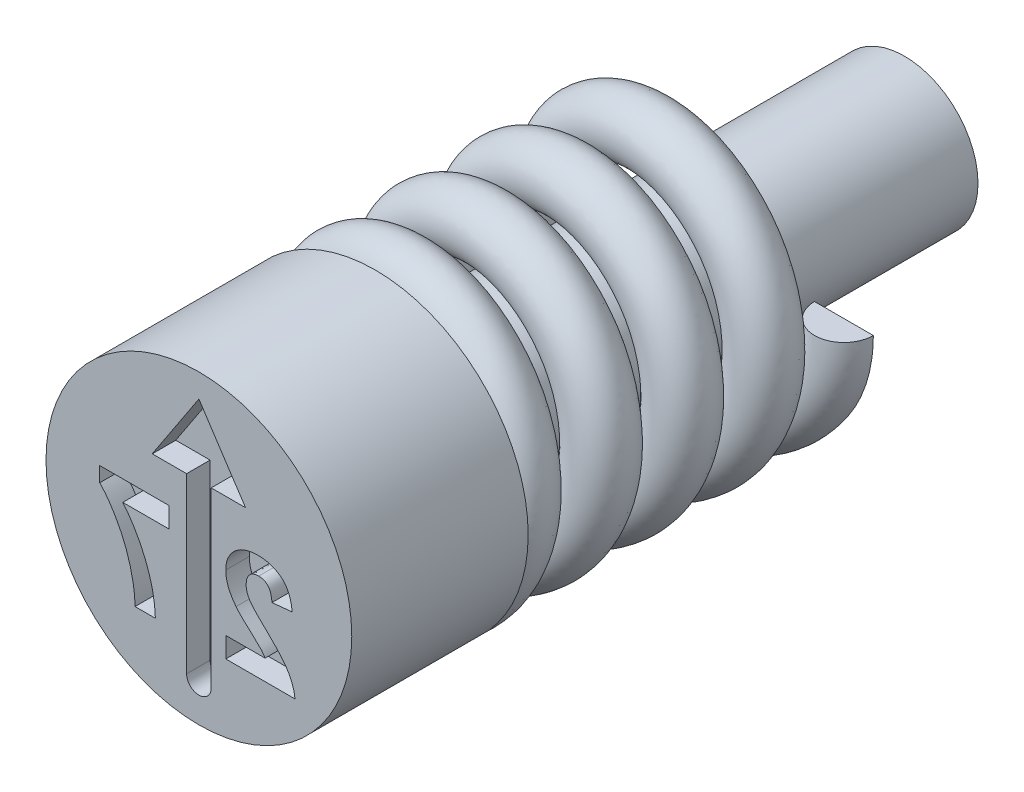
ISO-10303-21;
HEADER;
FILE_DESCRIPTION(('STEP AP214'),'2;1');
FILE_NAME('part.step','',(''),(''),'','','');
FILE_SCHEMA(('AUTOMOTIVE_DESIGN { 1 0 10303 214 1 1 1 1 }'));
ENDSEC;
DATA;
#1=APPLICATION_CONTEXT('core data for automotive mechanical design processes');
#2=APPLICATION_PROTOCOL_DEFINITION('international standard','automotive_design',2000,#1);
#3=PRODUCT_CONTEXT('',#1,'mechanical');
#4=PRODUCT('Part','Part','',(#3));
#5=PRODUCT_RELATED_PRODUCT_CATEGORY('part','',(#4));
#6=PRODUCT_DEFINITION_FORMATION('','',#4);
#7=PRODUCT_DEFINITION_CONTEXT('part definition',#1,'design');
#8=PRODUCT_DEFINITION('design','',#6,#7);
#9=PRODUCT_DEFINITION_SHAPE('','',#8);
#10=(LENGTH_UNIT() NAMED_UNIT(*) SI_UNIT(.MILLI.,.METRE.));
#11=(NAMED_UNIT(*) PLANE_ANGLE_UNIT() SI_UNIT($,.RADIAN.));
#12=(NAMED_UNIT(*) SI_UNIT($,.STERADIAN.) SOLID_ANGLE_UNIT());
#13=UNCERTAINTY_MEASURE_WITH_UNIT(LENGTH_MEASURE(1.E-05),#10,'distance_accuracy_value','');
#14=(GEOMETRIC_REPRESENTATION_CONTEXT(3) GLOBAL_UNCERTAINTY_ASSIGNED_CONTEXT((#13)) GLOBAL_UNIT_ASSIGNED_CONTEXT((#10,
#11,#12)) REPRESENTATION_CONTEXT('',''));
#15=CARTESIAN_POINT('',(0.,0.,0.));
#16=DIRECTION('',(0.,0.,1.));
#17=DIRECTION('',(1.,0.,0.));
#18=AXIS2_PLACEMENT_3D('',#15,#16,#17);
#19=CARTESIAN_POINT('',(2.1,0.,-9.37));
#20=DIRECTION('',(0.,-1.,0.));
#21=DIRECTION('',(0.,0.,-1.));
#22=AXIS2_PLACEMENT_3D('',#19,#20,#21);
#23=PLANE('',#22);
#24=CARTESIAN_POINT('',(2.1,0.,-8.87));
#25=DIRECTION('',(0.,1.,0.));
#26=DIRECTION('',(0.,0.,1.));
#27=AXIS2_PLACEMENT_3D('',#24,#25,#26);
#28=CIRCLE('',#27,0.5);
#29=CARTESIAN_POINT('',(1.6,0.,-8.87));
#30=VERTEX_POINT('',#29);
#31=CARTESIAN_POINT('',(2.6,0.,-8.87));
#32=VERTEX_POINT('',#31);
#33=EDGE_CURVE('E88',#30,#32,#28,.T.);
#34=ORIENTED_EDGE('',*,*,#33,.T.);
#35=DIRECTION('',(-1.,0.,0.));
#36=VECTOR('',#35,1.);
#37=CARTESIAN_POINT('',(2.1,0.,-8.87));
#38=LINE('',#37,#36);
#39=EDGE_CURVE('E75',#32,#30,#38,.T.);
#40=ORIENTED_EDGE('',*,*,#39,.T.);
#41=EDGE_LOOP('',(#34,#40));
#42=FACE_BOUND('',#41,.T.);
#43=ADVANCED_FACE('F49',(#42),#23,.F.);
#44=CARTESIAN_POINT('',(0.,-2.1,-3.5));
#45=DIRECTION('',(-1.,0.,0.));
#46=DIRECTION('',(0.,-1.,0.));
#47=AXIS2_PLACEMENT_3D('',#44,#45,#46);
#48=PLANE('',#47);
#49=DIRECTION('',(0.,-1.,0.));
#50=VECTOR('',#49,1.);
#51=CARTESIAN_POINT('',(0.,-2.1,-3.));
#52=LINE('',#51,#50);
#53=CARTESIAN_POINT('',(0.,-1.6,-3.));
#54=VERTEX_POINT('',#53);
#55=CARTESIAN_POINT('',(0.,-2.6,-3.));
#56=VERTEX_POINT('',#55);
#57=EDGE_CURVE('E69',#54,#56,#52,.T.);
#58=ORIENTED_EDGE('',*,*,#57,.F.);
#59=CARTESIAN_POINT('',(0.,-2.1,-3.));
#60=DIRECTION('',(-1.,0.,0.));
#61=DIRECTION('',(0.,-1.,0.));
#62=AXIS2_PLACEMENT_3D('',#59,#60,#61);
#63=CIRCLE('',#62,0.5);
#64=EDGE_CURVE('E85',#54,#56,#63,.T.);
#65=ORIENTED_EDGE('',*,*,#64,.T.);
#66=EDGE_LOOP('',(#58,#65));
#67=FACE_BOUND('',#66,.T.);
#68=ADVANCED_FACE('F51',(#67),#48,.T.);
#69=CARTESIAN_POINT('',(2.1,0.,-8.37));
#70=CARTESIAN_POINT('',(2.1,-0.8698484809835,-8.28367647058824));
#71=CARTESIAN_POINT('',(1.48492424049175,-1.48492424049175,-8.19735294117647));
#72=CARTESIAN_POINT('',(0.8698484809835,-2.1,-8.11102941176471));
#73=CARTESIAN_POINT('',(0.,-2.1,-8.02470588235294));
#74=CARTESIAN_POINT('',(-0.8698484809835,-2.1,-7.93838235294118));
#75=CARTESIAN_POINT('',(-1.48492424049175,-1.48492424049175,-7.85205882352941));
#76=CARTESIAN_POINT('',(-2.1,-0.8698484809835,-7.76573529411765));
#77=CARTESIAN_POINT('',(-2.1,0.,-7.67941176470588));
#78=CARTESIAN_POINT('',(-2.1,0.869848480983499,-7.59308823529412));
#79=CARTESIAN_POINT('',(-1.48492424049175,1.48492424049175,-7.50676470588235));
#80=CARTESIAN_POINT('',(-0.869848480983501,2.1,-7.42044117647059));
#81=CARTESIAN_POINT('',(0.,2.1,-7.33411764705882));
#82=CARTESIAN_POINT('',(0.8698484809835,2.1,-7.24779411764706));
#83=CARTESIAN_POINT('',(1.48492424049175,1.48492424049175,-7.1614705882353));
#84=CARTESIAN_POINT('',(2.1,0.869848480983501,-7.07514705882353));
#85=CARTESIAN_POINT('',(2.1,0.,-6.98882352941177));
#86=CARTESIAN_POINT('',(2.1,-0.8698484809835,-6.9025));
#87=CARTESIAN_POINT('',(1.48492424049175,-1.48492424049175,-6.81617647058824));
#88=CARTESIAN_POINT('',(0.8698484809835,-2.1,-6.72985294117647));
#89=CARTESIAN_POINT('',(0.,-2.1,-6.64352941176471));
#90=CARTESIAN_POINT('',(-0.8698484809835,-2.1,-6.55720588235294));
#91=CARTESIAN_POINT('',(-1.48492424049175,-1.48492424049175,-6.47088235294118));
#92=CARTESIAN_POINT('',(-2.1,-0.8698484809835,-6.38455882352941));
#93=CARTESIAN_POINT('',(-2.1,0.,-6.29823529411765));
#94=CARTESIAN_POINT('',(-2.1,0.869848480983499,-6.21191176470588));
#95=CARTESIAN_POINT('',(-1.48492424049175,1.48492424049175,-6.12558823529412));
#96=CARTESIAN_POINT('',(-0.869848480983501,2.1,-6.03926470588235));
#97=CARTESIAN_POINT('',(0.,2.1,-5.95294117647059));
#98=CARTESIAN_POINT('',(0.8698484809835,2.1,-5.86661764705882));
#99=CARTESIAN_POINT('',(1.48492424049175,1.48492424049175,-5.78029411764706));
#100=CARTESIAN_POINT('',(2.1,0.869848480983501,-5.6939705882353));
#101=CARTESIAN_POINT('',(2.1,0.,-5.60764705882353));
#102=CARTESIAN_POINT('',(2.1,-0.8698484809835,-5.52132352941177));
#103=CARTESIAN_POINT('',(1.48492424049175,-1.48492424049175,-5.435));
#104=CARTESIAN_POINT('',(0.8698484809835,-2.1,-5.34867647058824));
#105=CARTESIAN_POINT('',(0.,-2.1,-5.26235294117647));
#106=CARTESIAN_POINT('',(-0.8698484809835,-2.1,-5.17602941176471));
#107=CARTESIAN_POINT('',(-1.48492424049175,-1.48492424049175,-5.08970588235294));
#108=CARTESIAN_POINT('',(-2.1,-0.8698484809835,-5.00338235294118));
#109=CARTESIAN_POINT('',(-2.1,0.,-4.91705882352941));
#110=CARTESIAN_POINT('',(-2.1,0.869848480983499,-4.83073529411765));
#111=CARTESIAN_POINT('',(-1.48492424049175,1.48492424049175,-4.74441176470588));
#112=CARTESIAN_POINT('',(-0.869848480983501,2.1,-4.65808823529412));
#113=CARTESIAN_POINT('',(0.,2.1,-4.57176470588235));
#114=CARTESIAN_POINT('',(0.8698484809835,2.1,-4.48544117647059));
#115=CARTESIAN_POINT('',(1.48492424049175,1.48492424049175,-4.39911764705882));
#116=CARTESIAN_POINT('',(2.1,0.869848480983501,-4.31279411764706));
#117=CARTESIAN_POINT('',(2.1,0.,-4.2264705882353));
#118=CARTESIAN_POINT('',(2.1,-0.8698484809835,-4.14014705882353));
#119=CARTESIAN_POINT('',(1.48492424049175,-1.48492424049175,-4.05382352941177));
#120=CARTESIAN_POINT('',(0.8698484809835,-2.1,-3.9675));
#121=CARTESIAN_POINT('',(0.,-2.1,-3.88117647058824));
#122=CARTESIAN_POINT('',(-0.8698484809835,-2.1,-3.79485294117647));
#123=CARTESIAN_POINT('',(-1.48492424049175,-1.48492424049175,-3.70852941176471));
#124=CARTESIAN_POINT('',(-2.1,-0.8698484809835,-3.62220588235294));
#125=CARTESIAN_POINT('',(-2.1,0.,-3.53588235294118));
#126=CARTESIAN_POINT('',(-2.1,0.869848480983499,-3.44955882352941));
#127=CARTESIAN_POINT('',(-1.48492424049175,1.48492424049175,-3.36323529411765));
#128=CARTESIAN_POINT('',(-0.869848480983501,2.1,-3.27691176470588));
#129=CARTESIAN_POINT('',(0.,2.1,-3.19058823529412));
#130=CARTESIAN_POINT('',(0.8698484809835,2.1,-3.10426470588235));
#131=CARTESIAN_POINT('',(1.48492424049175,1.48492424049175,-3.01794117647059));
#132=CARTESIAN_POINT('',(2.1,0.869848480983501,-2.93161764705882));
#133=CARTESIAN_POINT('',(2.1,0.,-2.84529411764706));
#134=CARTESIAN_POINT('',(2.1,-0.8698484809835,-2.7589705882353));
#135=CARTESIAN_POINT('',(1.48492424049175,-1.48492424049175,-2.67264705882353));
#136=CARTESIAN_POINT('',(0.8698484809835,-2.1,-2.58632352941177));
#137=CARTESIAN_POINT('',(0.,-2.1,-2.5));
#138=CARTESIAN_POINT('',(3.1,0.,-8.37));
#139=CARTESIAN_POINT('',(3.1,-1.2840620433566,-8.28367647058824));
#140=CARTESIAN_POINT('',(2.1920310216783,-2.1920310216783,-8.19735294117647));
#141=CARTESIAN_POINT('',(1.2840620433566,-3.1,-8.11102941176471));
#142=CARTESIAN_POINT('',(0.,-3.1,-8.02470588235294));
#143=CARTESIAN_POINT('',(-1.28406204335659,-3.1,-7.93838235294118));
#144=CARTESIAN_POINT('',(-2.1920310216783,-2.1920310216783,-7.85205882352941));
#145=CARTESIAN_POINT('',(-3.1,-1.2840620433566,-7.76573529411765));
#146=CARTESIAN_POINT('',(-3.1,0.,-7.67941176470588));
#147=CARTESIAN_POINT('',(-3.1,1.28406204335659,-7.59308823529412));
#148=CARTESIAN_POINT('',(-2.1920310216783,2.1920310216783,-7.50676470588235));
#149=CARTESIAN_POINT('',(-1.2840620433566,3.1,-7.42044117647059));
#150=CARTESIAN_POINT('',(0.,3.1,-7.33411764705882));
#151=CARTESIAN_POINT('',(1.2840620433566,3.1,-7.24779411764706));
#152=CARTESIAN_POINT('',(2.1920310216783,2.1920310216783,-7.1614705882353));
#153=CARTESIAN_POINT('',(3.1,1.2840620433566,-7.07514705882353));
#154=CARTESIAN_POINT('',(3.1,0.,-6.98882352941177));
#155=CARTESIAN_POINT('',(3.1,-1.2840620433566,-6.9025));
#156=CARTESIAN_POINT('',(2.1920310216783,-2.1920310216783,-6.81617647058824));
#157=CARTESIAN_POINT('',(1.2840620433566,-3.1,-6.72985294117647));
#158=CARTESIAN_POINT('',(0.,-3.1,-6.64352941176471));
#159=CARTESIAN_POINT('',(-1.28406204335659,-3.1,-6.55720588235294));
#160=CARTESIAN_POINT('',(-2.1920310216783,-2.1920310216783,-6.47088235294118));
#161=CARTESIAN_POINT('',(-3.1,-1.2840620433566,-6.38455882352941));
#162=CARTESIAN_POINT('',(-3.1,0.,-6.29823529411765));
#163=CARTESIAN_POINT('',(-3.1,1.28406204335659,-6.21191176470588));
#164=CARTESIAN_POINT('',(-2.1920310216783,2.1920310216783,-6.12558823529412));
#165=CARTESIAN_POINT('',(-1.2840620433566,3.1,-6.03926470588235));
#166=CARTESIAN_POINT('',(0.,3.1,-5.95294117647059));
#167=CARTESIAN_POINT('',(1.2840620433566,3.1,-5.86661764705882));
#168=CARTESIAN_POINT('',(2.1920310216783,2.1920310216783,-5.78029411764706));
#169=CARTESIAN_POINT('',(3.1,1.2840620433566,-5.69397058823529));
#170=CARTESIAN_POINT('',(3.1,0.,-5.60764705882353));
#171=CARTESIAN_POINT('',(3.1,-1.2840620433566,-5.52132352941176));
#172=CARTESIAN_POINT('',(2.1920310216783,-2.1920310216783,-5.435));
#173=CARTESIAN_POINT('',(1.2840620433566,-3.1,-5.34867647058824));
#174=CARTESIAN_POINT('',(0.,-3.1,-5.26235294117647));
#175=CARTESIAN_POINT('',(-1.28406204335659,-3.1,-5.17602941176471));
#176=CARTESIAN_POINT('',(-2.1920310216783,-2.1920310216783,-5.08970588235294));
#177=CARTESIAN_POINT('',(-3.1,-1.2840620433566,-5.00338235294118));
#178=CARTESIAN_POINT('',(-3.1,0.,-4.91705882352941));
#179=CARTESIAN_POINT('',(-3.1,1.28406204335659,-4.83073529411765));
#180=CARTESIAN_POINT('',(-2.1920310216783,2.1920310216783,-4.74441176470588));
#181=CARTESIAN_POINT('',(-1.2840620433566,3.1,-4.65808823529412));
#182=CARTESIAN_POINT('',(0.,3.1,-4.57176470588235));
#183=CARTESIAN_POINT('',(1.2840620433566,3.1,-4.48544117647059));
#184=CARTESIAN_POINT('',(2.1920310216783,2.1920310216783,-4.39911764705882));
#185=CARTESIAN_POINT('',(3.1,1.2840620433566,-4.31279411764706));
#186=CARTESIAN_POINT('',(3.1,0.,-4.2264705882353));
#187=CARTESIAN_POINT('',(3.1,-1.2840620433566,-4.14014705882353));
#188=CARTESIAN_POINT('',(2.1920310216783,-2.1920310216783,-4.05382352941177));
#189=CARTESIAN_POINT('',(1.2840620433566,-3.1,-3.9675));
#190=CARTESIAN_POINT('',(0.,-3.1,-3.88117647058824));
#191=CARTESIAN_POINT('',(-1.28406204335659,-3.1,-3.79485294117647));
#192=CARTESIAN_POINT('',(-2.1920310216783,-2.1920310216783,-3.70852941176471));
#193=CARTESIAN_POINT('',(-3.1,-1.2840620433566,-3.62220588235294));
#194=CARTESIAN_POINT('',(-3.1,0.,-3.53588235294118));
#195=CARTESIAN_POINT('',(-3.1,1.28406204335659,-3.44955882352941));
#196=CARTESIAN_POINT('',(-2.1920310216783,2.1920310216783,-3.36323529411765));
#197=CARTESIAN_POINT('',(-1.2840620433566,3.1,-3.27691176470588));
#198=CARTESIAN_POINT('',(0.,3.1,-3.19058823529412));
#199=CARTESIAN_POINT('',(1.2840620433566,3.1,-3.10426470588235));
#200=CARTESIAN_POINT('',(2.1920310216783,2.1920310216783,-3.01794117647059));
#201=CARTESIAN_POINT('',(3.1,1.2840620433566,-2.93161764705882));
#202=CARTESIAN_POINT('',(3.1,0.,-2.84529411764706));
#203=CARTESIAN_POINT('',(3.1,-1.2840620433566,-2.75897058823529));
#204=CARTESIAN_POINT('',(2.1920310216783,-2.1920310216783,-2.67264705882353));
#205=CARTESIAN_POINT('',(1.2840620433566,-3.1,-2.58632352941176));
#206=CARTESIAN_POINT('',(0.,-3.1,-2.5));
#207=CARTESIAN_POINT('',(3.1,0.,-9.37));
#208=CARTESIAN_POINT('',(3.1,-1.2840620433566,-9.28367647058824));
#209=CARTESIAN_POINT('',(2.1920310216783,-2.1920310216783,-9.19735294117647));
#210=CARTESIAN_POINT('',(1.2840620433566,-3.1,-9.11102941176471));
#211=CARTESIAN_POINT('',(0.,-3.1,-9.02470588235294));
#212=CARTESIAN_POINT('',(-1.28406204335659,-3.1,-8.93838235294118));
#213=CARTESIAN_POINT('',(-2.1920310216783,-2.1920310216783,-8.85205882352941));
#214=CARTESIAN_POINT('',(-3.1,-1.2840620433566,-8.76573529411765));
#215=CARTESIAN_POINT('',(-3.1,0.,-8.67941176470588));
#216=CARTESIAN_POINT('',(-3.1,1.28406204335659,-8.59308823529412));
#217=CARTESIAN_POINT('',(-2.1920310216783,2.1920310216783,-8.50676470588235));
#218=CARTESIAN_POINT('',(-1.2840620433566,3.1,-8.42044117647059));
#219=CARTESIAN_POINT('',(0.,3.1,-8.33411764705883));
#220=CARTESIAN_POINT('',(1.2840620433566,3.1,-8.24779411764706));
#221=CARTESIAN_POINT('',(2.1920310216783,2.1920310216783,-8.16147058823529));
#222=CARTESIAN_POINT('',(3.1,1.2840620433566,-8.07514705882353));
#223=CARTESIAN_POINT('',(3.1,0.,-7.98882352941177));
#224=CARTESIAN_POINT('',(3.1,-1.2840620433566,-7.9025));
#225=CARTESIAN_POINT('',(2.1920310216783,-2.1920310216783,-7.81617647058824));
#226=CARTESIAN_POINT('',(1.2840620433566,-3.1,-7.72985294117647));
#227=CARTESIAN_POINT('',(0.,-3.1,-7.64352941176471));
#228=CARTESIAN_POINT('',(-1.28406204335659,-3.1,-7.55720588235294));
#229=CARTESIAN_POINT('',(-2.1920310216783,-2.1920310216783,-7.47088235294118));
#230=CARTESIAN_POINT('',(-3.1,-1.2840620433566,-7.38455882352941));
#231=CARTESIAN_POINT('',(-3.1,0.,-7.29823529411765));
#232=CARTESIAN_POINT('',(-3.1,1.28406204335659,-7.21191176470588));
#233=CARTESIAN_POINT('',(-2.1920310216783,2.1920310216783,-7.12558823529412));
#234=CARTESIAN_POINT('',(-1.2840620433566,3.1,-7.03926470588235));
#235=CARTESIAN_POINT('',(0.,3.1,-6.95294117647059));
#236=CARTESIAN_POINT('',(1.2840620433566,3.1,-6.86661764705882));
#237=CARTESIAN_POINT('',(2.1920310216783,2.1920310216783,-6.78029411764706));
#238=CARTESIAN_POINT('',(3.1,1.2840620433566,-6.6939705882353));
#239=CARTESIAN_POINT('',(3.1,0.,-6.60764705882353));
#240=CARTESIAN_POINT('',(3.1,-1.2840620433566,-6.52132352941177));
#241=CARTESIAN_POINT('',(2.1920310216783,-2.1920310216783,-6.435));
#242=CARTESIAN_POINT('',(1.2840620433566,-3.1,-6.34867647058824));
#243=CARTESIAN_POINT('',(0.,-3.1,-6.26235294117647));
#244=CARTESIAN_POINT('',(-1.28406204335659,-3.1,-6.17602941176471));
#245=CARTESIAN_POINT('',(-2.1920310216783,-2.1920310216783,-6.08970588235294));
#246=CARTESIAN_POINT('',(-3.1,-1.2840620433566,-6.00338235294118));
#247=CARTESIAN_POINT('',(-3.1,0.,-5.91705882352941));
#248=CARTESIAN_POINT('',(-3.1,1.28406204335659,-5.83073529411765));
#249=CARTESIAN_POINT('',(-2.1920310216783,2.1920310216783,-5.74441176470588));
#250=CARTESIAN_POINT('',(-1.2840620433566,3.1,-5.65808823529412));
#251=CARTESIAN_POINT('',(0.,3.1,-5.57176470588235));
#252=CARTESIAN_POINT('',(1.2840620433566,3.1,-5.48544117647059));
#253=CARTESIAN_POINT('',(2.1920310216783,2.1920310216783,-5.39911764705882));
#254=CARTESIAN_POINT('',(3.1,1.2840620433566,-5.31279411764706));
#255=CARTESIAN_POINT('',(3.1,0.,-5.2264705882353));
#256=CARTESIAN_POINT('',(3.1,-1.2840620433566,-5.14014705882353));
#257=CARTESIAN_POINT('',(2.1920310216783,-2.1920310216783,-5.05382352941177));
#258=CARTESIAN_POINT('',(1.2840620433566,-3.1,-4.9675));
#259=CARTESIAN_POINT('',(0.,-3.1,-4.88117647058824));
#260=CARTESIAN_POINT('',(-1.28406204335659,-3.1,-4.79485294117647));
#261=CARTESIAN_POINT('',(-2.1920310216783,-2.1920310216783,-4.70852941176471));
#262=CARTESIAN_POINT('',(-3.1,-1.2840620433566,-4.62220588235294));
#263=CARTESIAN_POINT('',(-3.1,0.,-4.53588235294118));
#264=CARTESIAN_POINT('',(-3.1,1.28406204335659,-4.44955882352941));
#265=CARTESIAN_POINT('',(-2.1920310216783,2.1920310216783,-4.36323529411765));
#266=CARTESIAN_POINT('',(-1.2840620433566,3.1,-4.27691176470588));
#267=CARTESIAN_POINT('',(0.,3.1,-4.19058823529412));
#268=CARTESIAN_POINT('',(1.2840620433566,3.1,-4.10426470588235));
#269=CARTESIAN_POINT('',(2.1920310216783,2.1920310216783,-4.01794117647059));
#270=CARTESIAN_POINT('',(3.1,1.2840620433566,-3.93161764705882));
#271=CARTESIAN_POINT('',(3.1,0.,-3.84529411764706));
#272=CARTESIAN_POINT('',(3.1,-1.2840620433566,-3.7589705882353));
#273=CARTESIAN_POINT('',(2.1920310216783,-2.1920310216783,-3.67264705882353));
#274=CARTESIAN_POINT('',(1.2840620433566,-3.1,-3.58632352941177));
#275=CARTESIAN_POINT('',(0.,-3.1,-3.5));
#276=CARTESIAN_POINT('',(2.1,0.,-9.37));
#277=CARTESIAN_POINT('',(2.1,-0.8698484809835,-9.28367647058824));
#278=CARTESIAN_POINT('',(1.48492424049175,-1.48492424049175,-9.19735294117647));
#279=CARTESIAN_POINT('',(0.8698484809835,-2.1,-9.11102941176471));
#280=CARTESIAN_POINT('',(0.,-2.1,-9.02470588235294));
#281=CARTESIAN_POINT('',(-0.8698484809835,-2.1,-8.93838235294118));
#282=CARTESIAN_POINT('',(-1.48492424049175,-1.48492424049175,-8.85205882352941));
#283=CARTESIAN_POINT('',(-2.1,-0.8698484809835,-8.76573529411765));
#284=CARTESIAN_POINT('',(-2.1,0.,-8.67941176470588));
#285=CARTESIAN_POINT('',(-2.1,0.869848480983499,-8.59308823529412));
#286=CARTESIAN_POINT('',(-1.48492424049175,1.48492424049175,-8.50676470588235));
#287=CARTESIAN_POINT('',(-0.869848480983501,2.1,-8.42044117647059));
#288=CARTESIAN_POINT('',(0.,2.1,-8.33411764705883));
#289=CARTESIAN_POINT('',(0.8698484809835,2.1,-8.24779411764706));
#290=CARTESIAN_POINT('',(1.48492424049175,1.48492424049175,-8.1614705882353));
#291=CARTESIAN_POINT('',(2.1,0.869848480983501,-8.07514705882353));
#292=CARTESIAN_POINT('',(2.1,0.,-7.98882352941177));
#293=CARTESIAN_POINT('',(2.1,-0.8698484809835,-7.9025));
#294=CARTESIAN_POINT('',(1.48492424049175,-1.48492424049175,-7.81617647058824));
#295=CARTESIAN_POINT('',(0.8698484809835,-2.1,-7.72985294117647));
#296=CARTESIAN_POINT('',(0.,-2.1,-7.64352941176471));
#297=CARTESIAN_POINT('',(-0.8698484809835,-2.1,-7.55720588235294));
#298=CARTESIAN_POINT('',(-1.48492424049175,-1.48492424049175,-7.47088235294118));
#299=CARTESIAN_POINT('',(-2.1,-0.8698484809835,-7.38455882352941));
#300=CARTESIAN_POINT('',(-2.1,0.,-7.29823529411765));
#301=CARTESIAN_POINT('',(-2.1,0.869848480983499,-7.21191176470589));
#302=CARTESIAN_POINT('',(-1.48492424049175,1.48492424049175,-7.12558823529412));
#303=CARTESIAN_POINT('',(-0.869848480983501,2.1,-7.03926470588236));
#304=CARTESIAN_POINT('',(0.,2.1,-6.95294117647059));
#305=CARTESIAN_POINT('',(0.8698484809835,2.1,-6.86661764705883));
#306=CARTESIAN_POINT('',(1.48492424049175,1.48492424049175,-6.78029411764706));
#307=CARTESIAN_POINT('',(2.1,0.869848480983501,-6.6939705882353));
#308=CARTESIAN_POINT('',(2.1,0.,-6.60764705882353));
#309=CARTESIAN_POINT('',(2.1,-0.8698484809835,-6.52132352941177));
#310=CARTESIAN_POINT('',(1.48492424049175,-1.48492424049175,-6.435));
#311=CARTESIAN_POINT('',(0.8698484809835,-2.1,-6.34867647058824));
#312=CARTESIAN_POINT('',(0.,-2.1,-6.26235294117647));
#313=CARTESIAN_POINT('',(-0.8698484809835,-2.1,-6.17602941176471));
#314=CARTESIAN_POINT('',(-1.48492424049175,-1.48492424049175,-6.08970588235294));
#315=CARTESIAN_POINT('',(-2.1,-0.8698484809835,-6.00338235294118));
#316=CARTESIAN_POINT('',(-2.1,0.,-5.91705882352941));
#317=CARTESIAN_POINT('',(-2.1,0.869848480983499,-5.83073529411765));
#318=CARTESIAN_POINT('',(-1.48492424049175,1.48492424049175,-5.74441176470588));
#319=CARTESIAN_POINT('',(-0.869848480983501,2.1,-5.65808823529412));
#320=CARTESIAN_POINT('',(0.,2.1,-5.57176470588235));
#321=CARTESIAN_POINT('',(0.8698484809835,2.1,-5.48544117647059));
#322=CARTESIAN_POINT('',(1.48492424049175,1.48492424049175,-5.39911764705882));
#323=CARTESIAN_POINT('',(2.1,0.869848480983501,-5.31279411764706));
#324=CARTESIAN_POINT('',(2.1,0.,-5.2264705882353));
#325=CARTESIAN_POINT('',(2.1,-0.8698484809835,-5.14014705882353));
#326=CARTESIAN_POINT('',(1.48492424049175,-1.48492424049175,-5.05382352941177));
#327=CARTESIAN_POINT('',(0.8698484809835,-2.1,-4.9675));
#328=CARTESIAN_POINT('',(0.,-2.1,-4.88117647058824));
#329=CARTESIAN_POINT('',(-0.8698484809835,-2.1,-4.79485294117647));
#330=CARTESIAN_POINT('',(-1.48492424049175,-1.48492424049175,-4.70852941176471));
#331=CARTESIAN_POINT('',(-2.1,-0.8698484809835,-4.62220588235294));
#332=CARTESIAN_POINT('',(-2.1,0.,-4.53588235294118));
#333=CARTESIAN_POINT('',(-2.1,0.869848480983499,-4.44955882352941));
#334=CARTESIAN_POINT('',(-1.48492424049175,1.48492424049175,-4.36323529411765));
#335=CARTESIAN_POINT('',(-0.869848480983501,2.1,-4.27691176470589));
#336=CARTESIAN_POINT('',(0.,2.1,-4.19058823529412));
#337=CARTESIAN_POINT('',(0.8698484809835,2.1,-4.10426470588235));
#338=CARTESIAN_POINT('',(1.48492424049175,1.48492424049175,-4.01794117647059));
#339=CARTESIAN_POINT('',(2.1,0.869848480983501,-3.93161764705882));
#340=CARTESIAN_POINT('',(2.1,0.,-3.84529411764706));
#341=CARTESIAN_POINT('',(2.1,-0.8698484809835,-3.7589705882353));
#342=CARTESIAN_POINT('',(1.48492424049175,-1.48492424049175,-3.67264705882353));
#343=CARTESIAN_POINT('',(0.8698484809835,-2.1,-3.58632352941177));
#344=CARTESIAN_POINT('',(0.,-2.1,-3.5));
#345=CARTESIAN_POINT('',(1.1,0.,-9.37));
#346=CARTESIAN_POINT('',(1.1,-0.455634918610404,-9.28367647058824));
#347=CARTESIAN_POINT('',(0.777817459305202,-0.777817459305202,-9.19735294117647));
#348=CARTESIAN_POINT('',(0.455634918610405,-1.1,-9.11102941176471));
#349=CARTESIAN_POINT('',(0.,-1.1,-9.02470588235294));
#350=CARTESIAN_POINT('',(-0.455634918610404,-1.1,-8.93838235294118));
#351=CARTESIAN_POINT('',(-0.777817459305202,-0.777817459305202,-8.85205882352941));
#352=CARTESIAN_POINT('',(-1.1,-0.455634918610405,-8.76573529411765));
#353=CARTESIAN_POINT('',(-1.1,0.,-8.67941176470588));
#354=CARTESIAN_POINT('',(-1.1,0.455634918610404,-8.59308823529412));
#355=CARTESIAN_POINT('',(-0.777817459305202,0.777817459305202,-8.50676470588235));
#356=CARTESIAN_POINT('',(-0.455634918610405,1.1,-8.42044117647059));
#357=CARTESIAN_POINT('',(0.,1.1,-8.33411764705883));
#358=CARTESIAN_POINT('',(0.455634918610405,1.1,-8.24779411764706));
#359=CARTESIAN_POINT('',(0.777817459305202,0.777817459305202,-8.16147058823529));
#360=CARTESIAN_POINT('',(1.1,0.455634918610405,-8.07514705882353));
#361=CARTESIAN_POINT('',(1.1,0.,-7.98882352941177));
#362=CARTESIAN_POINT('',(1.1,-0.455634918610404,-7.9025));
#363=CARTESIAN_POINT('',(0.777817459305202,-0.777817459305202,-7.81617647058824));
#364=CARTESIAN_POINT('',(0.455634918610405,-1.1,-7.72985294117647));
#365=CARTESIAN_POINT('',(0.,-1.1,-7.64352941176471));
#366=CARTESIAN_POINT('',(-0.455634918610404,-1.1,-7.55720588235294));
#367=CARTESIAN_POINT('',(-0.777817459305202,-0.777817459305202,-7.47088235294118));
#368=CARTESIAN_POINT('',(-1.1,-0.455634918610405,-7.38455882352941));
#369=CARTESIAN_POINT('',(-1.1,0.,-7.29823529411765));
#370=CARTESIAN_POINT('',(-1.1,0.455634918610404,-7.21191176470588));
#371=CARTESIAN_POINT('',(-0.777817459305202,0.777817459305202,-7.12558823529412));
#372=CARTESIAN_POINT('',(-0.455634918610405,1.1,-7.03926470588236));
#373=CARTESIAN_POINT('',(0.,1.1,-6.95294117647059));
#374=CARTESIAN_POINT('',(0.455634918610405,1.1,-6.86661764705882));
#375=CARTESIAN_POINT('',(0.777817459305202,0.777817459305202,-6.78029411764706));
#376=CARTESIAN_POINT('',(1.1,0.455634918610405,-6.6939705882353));
#377=CARTESIAN_POINT('',(1.1,0.,-6.60764705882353));
#378=CARTESIAN_POINT('',(1.1,-0.455634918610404,-6.52132352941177));
#379=CARTESIAN_POINT('',(0.777817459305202,-0.777817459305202,-6.435));
#380=CARTESIAN_POINT('',(0.455634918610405,-1.1,-6.34867647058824));
#381=CARTESIAN_POINT('',(0.,-1.1,-6.26235294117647));
#382=CARTESIAN_POINT('',(-0.455634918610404,-1.1,-6.17602941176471));
#383=CARTESIAN_POINT('',(-0.777817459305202,-0.777817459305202,-6.08970588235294));
#384=CARTESIAN_POINT('',(-1.1,-0.455634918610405,-6.00338235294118));
#385=CARTESIAN_POINT('',(-1.1,0.,-5.91705882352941));
#386=CARTESIAN_POINT('',(-1.1,0.455634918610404,-5.83073529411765));
#387=CARTESIAN_POINT('',(-0.777817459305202,0.777817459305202,-5.74441176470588));
#388=CARTESIAN_POINT('',(-0.455634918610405,1.1,-5.65808823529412));
#389=CARTESIAN_POINT('',(0.,1.1,-5.57176470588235));
#390=CARTESIAN_POINT('',(0.455634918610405,1.1,-5.48544117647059));
#391=CARTESIAN_POINT('',(0.777817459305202,0.777817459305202,-5.39911764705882));
#392=CARTESIAN_POINT('',(1.1,0.455634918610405,-5.31279411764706));
#393=CARTESIAN_POINT('',(1.1,0.,-5.2264705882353));
#394=CARTESIAN_POINT('',(1.1,-0.455634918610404,-5.14014705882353));
#395=CARTESIAN_POINT('',(0.777817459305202,-0.777817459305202,-5.05382352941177));
#396=CARTESIAN_POINT('',(0.455634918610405,-1.1,-4.9675));
#397=CARTESIAN_POINT('',(0.,-1.1,-4.88117647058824));
#398=CARTESIAN_POINT('',(-0.455634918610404,-1.1,-4.79485294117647));
#399=CARTESIAN_POINT('',(-0.777817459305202,-0.777817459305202,-4.70852941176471));
#400=CARTESIAN_POINT('',(-1.1,-0.455634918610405,-4.62220588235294));
#401=CARTESIAN_POINT('',(-1.1,0.,-4.53588235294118));
#402=CARTESIAN_POINT('',(-1.1,0.455634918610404,-4.44955882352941));
#403=CARTESIAN_POINT('',(-0.777817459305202,0.777817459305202,-4.36323529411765));
#404=CARTESIAN_POINT('',(-0.455634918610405,1.1,-4.27691176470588));
#405=CARTESIAN_POINT('',(0.,1.1,-4.19058823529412));
#406=CARTESIAN_POINT('',(0.455634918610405,1.1,-4.10426470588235));
#407=CARTESIAN_POINT('',(0.777817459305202,0.777817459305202,-4.01794117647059));
#408=CARTESIAN_POINT('',(1.1,0.455634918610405,-3.93161764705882));
#409=CARTESIAN_POINT('',(1.1,0.,-3.84529411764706));
#410=CARTESIAN_POINT('',(1.1,-0.455634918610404,-3.7589705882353));
#411=CARTESIAN_POINT('',(0.777817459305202,-0.777817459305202,-3.67264705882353));
#412=CARTESIAN_POINT('',(0.455634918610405,-1.1,-3.58632352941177));
#413=CARTESIAN_POINT('',(0.,-1.1,-3.5));
#414=CARTESIAN_POINT('',(1.1,0.,-8.37));
#415=CARTESIAN_POINT('',(1.1,-0.455634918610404,-8.28367647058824));
#416=CARTESIAN_POINT('',(0.777817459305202,-0.777817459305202,-8.19735294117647));
#417=CARTESIAN_POINT('',(0.455634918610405,-1.1,-8.11102941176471));
#418=CARTESIAN_POINT('',(0.,-1.1,-8.02470588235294));
#419=CARTESIAN_POINT('',(-0.455634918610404,-1.1,-7.93838235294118));
#420=CARTESIAN_POINT('',(-0.777817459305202,-0.777817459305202,-7.85205882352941));
#421=CARTESIAN_POINT('',(-1.1,-0.455634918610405,-7.76573529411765));
#422=CARTESIAN_POINT('',(-1.1,0.,-7.67941176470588));
#423=CARTESIAN_POINT('',(-1.1,0.455634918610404,-7.59308823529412));
#424=CARTESIAN_POINT('',(-0.777817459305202,0.777817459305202,-7.50676470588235));
#425=CARTESIAN_POINT('',(-0.455634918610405,1.1,-7.42044117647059));
#426=CARTESIAN_POINT('',(0.,1.1,-7.33411764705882));
#427=CARTESIAN_POINT('',(0.455634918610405,1.1,-7.24779411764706));
#428=CARTESIAN_POINT('',(0.777817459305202,0.777817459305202,-7.1614705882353));
#429=CARTESIAN_POINT('',(1.1,0.455634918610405,-7.07514705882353));
#430=CARTESIAN_POINT('',(1.1,0.,-6.98882352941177));
#431=CARTESIAN_POINT('',(1.1,-0.455634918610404,-6.9025));
#432=CARTESIAN_POINT('',(0.777817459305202,-0.777817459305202,-6.81617647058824));
#433=CARTESIAN_POINT('',(0.455634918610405,-1.1,-6.72985294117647));
#434=CARTESIAN_POINT('',(0.,-1.1,-6.64352941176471));
#435=CARTESIAN_POINT('',(-0.455634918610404,-1.1,-6.55720588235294));
#436=CARTESIAN_POINT('',(-0.777817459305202,-0.777817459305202,-6.47088235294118));
#437=CARTESIAN_POINT('',(-1.1,-0.455634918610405,-6.38455882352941));
#438=CARTESIAN_POINT('',(-1.1,0.,-6.29823529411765));
#439=CARTESIAN_POINT('',(-1.1,0.455634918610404,-6.21191176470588));
#440=CARTESIAN_POINT('',(-0.777817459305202,0.777817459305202,-6.12558823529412));
#441=CARTESIAN_POINT('',(-0.455634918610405,1.1,-6.03926470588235));
#442=CARTESIAN_POINT('',(0.,1.1,-5.95294117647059));
#443=CARTESIAN_POINT('',(0.455634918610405,1.1,-5.86661764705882));
#444=CARTESIAN_POINT('',(0.777817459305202,0.777817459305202,-5.78029411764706));
#445=CARTESIAN_POINT('',(1.1,0.455634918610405,-5.69397058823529));
#446=CARTESIAN_POINT('',(1.1,0.,-5.60764705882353));
#447=CARTESIAN_POINT('',(1.1,-0.455634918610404,-5.52132352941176));
#448=CARTESIAN_POINT('',(0.777817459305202,-0.777817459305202,-5.435));
#449=CARTESIAN_POINT('',(0.455634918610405,-1.1,-5.34867647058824));
#450=CARTESIAN_POINT('',(0.,-1.1,-5.26235294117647));
#451=CARTESIAN_POINT('',(-0.455634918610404,-1.1,-5.17602941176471));
#452=CARTESIAN_POINT('',(-0.777817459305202,-0.777817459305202,-5.08970588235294));
#453=CARTESIAN_POINT('',(-1.1,-0.455634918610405,-5.00338235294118));
#454=CARTESIAN_POINT('',(-1.1,0.,-4.91705882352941));
#455=CARTESIAN_POINT('',(-1.1,0.455634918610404,-4.83073529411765));
#456=CARTESIAN_POINT('',(-0.777817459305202,0.777817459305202,-4.74441176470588));
#457=CARTESIAN_POINT('',(-0.455634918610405,1.1,-4.65808823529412));
#458=CARTESIAN_POINT('',(0.,1.1,-4.57176470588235));
#459=CARTESIAN_POINT('',(0.455634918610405,1.1,-4.48544117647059));
#460=CARTESIAN_POINT('',(0.777817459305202,0.777817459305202,-4.39911764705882));
#461=CARTESIAN_POINT('',(1.1,0.455634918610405,-4.31279411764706));
#462=CARTESIAN_POINT('',(1.1,0.,-4.2264705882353));
#463=CARTESIAN_POINT('',(1.1,-0.455634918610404,-4.14014705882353));
#464=CARTESIAN_POINT('',(0.777817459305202,-0.777817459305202,-4.05382352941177));
#465=CARTESIAN_POINT('',(0.455634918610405,-1.1,-3.9675));
#466=CARTESIAN_POINT('',(0.,-1.1,-3.88117647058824));
#467=CARTESIAN_POINT('',(-0.455634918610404,-1.1,-3.79485294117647));
#468=CARTESIAN_POINT('',(-0.777817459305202,-0.777817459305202,-3.70852941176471));
#469=CARTESIAN_POINT('',(-1.1,-0.455634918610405,-3.62220588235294));
#470=CARTESIAN_POINT('',(-1.1,0.,-3.53588235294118));
#471=CARTESIAN_POINT('',(-1.1,0.455634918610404,-3.44955882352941));
#472=CARTESIAN_POINT('',(-0.777817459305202,0.777817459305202,-3.36323529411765));
#473=CARTESIAN_POINT('',(-0.455634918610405,1.1,-3.27691176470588));
#474=CARTESIAN_POINT('',(0.,1.1,-3.19058823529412));
#475=CARTESIAN_POINT('',(0.455634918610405,1.1,-3.10426470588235));
#476=CARTESIAN_POINT('',(0.777817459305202,0.777817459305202,-3.01794117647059));
#477=CARTESIAN_POINT('',(1.1,0.455634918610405,-2.93161764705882));
#478=CARTESIAN_POINT('',(1.1,0.,-2.84529411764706));
#479=CARTESIAN_POINT('',(1.1,-0.455634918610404,-2.75897058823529));
#480=CARTESIAN_POINT('',(0.777817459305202,-0.777817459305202,-2.67264705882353));
#481=CARTESIAN_POINT('',(0.455634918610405,-1.1,-2.58632352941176));
#482=CARTESIAN_POINT('',(0.,-1.1,-2.5));
#483=CARTESIAN_POINT('',(2.1,0.,-8.37));
#484=CARTESIAN_POINT('',(2.1,-0.8698484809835,-8.28367647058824));
#485=CARTESIAN_POINT('',(1.48492424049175,-1.48492424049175,-8.19735294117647));
#486=CARTESIAN_POINT('',(0.8698484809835,-2.1,-8.11102941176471));
#487=CARTESIAN_POINT('',(0.,-2.1,-8.02470588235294));
#488=CARTESIAN_POINT('',(-0.8698484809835,-2.1,-7.93838235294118));
#489=CARTESIAN_POINT('',(-1.48492424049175,-1.48492424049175,-7.85205882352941));
#490=CARTESIAN_POINT('',(-2.1,-0.8698484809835,-7.76573529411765));
#491=CARTESIAN_POINT('',(-2.1,0.,-7.67941176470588));
#492=CARTESIAN_POINT('',(-2.1,0.869848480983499,-7.59308823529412));
#493=CARTESIAN_POINT('',(-1.48492424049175,1.48492424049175,-7.50676470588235));
#494=CARTESIAN_POINT('',(-0.869848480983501,2.1,-7.42044117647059));
#495=CARTESIAN_POINT('',(0.,2.1,-7.33411764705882));
#496=CARTESIAN_POINT('',(0.8698484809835,2.1,-7.24779411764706));
#497=CARTESIAN_POINT('',(1.48492424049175,1.48492424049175,-7.1614705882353));
#498=CARTESIAN_POINT('',(2.1,0.869848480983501,-7.07514705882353));
#499=CARTESIAN_POINT('',(2.1,0.,-6.98882352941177));
#500=CARTESIAN_POINT('',(2.1,-0.8698484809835,-6.9025));
#501=CARTESIAN_POINT('',(1.48492424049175,-1.48492424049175,-6.81617647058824));
#502=CARTESIAN_POINT('',(0.8698484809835,-2.1,-6.72985294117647));
#503=CARTESIAN_POINT('',(0.,-2.1,-6.64352941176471));
#504=CARTESIAN_POINT('',(-0.8698484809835,-2.1,-6.55720588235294));
#505=CARTESIAN_POINT('',(-1.48492424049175,-1.48492424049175,-6.47088235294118));
#506=CARTESIAN_POINT('',(-2.1,-0.8698484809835,-6.38455882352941));
#507=CARTESIAN_POINT('',(-2.1,0.,-6.29823529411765));
#508=CARTESIAN_POINT('',(-2.1,0.869848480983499,-6.21191176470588));
#509=CARTESIAN_POINT('',(-1.48492424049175,1.48492424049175,-6.12558823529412));
#510=CARTESIAN_POINT('',(-0.869848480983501,2.1,-6.03926470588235));
#511=CARTESIAN_POINT('',(0.,2.1,-5.95294117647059));
#512=CARTESIAN_POINT('',(0.8698484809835,2.1,-5.86661764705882));
#513=CARTESIAN_POINT('',(1.48492424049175,1.48492424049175,-5.78029411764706));
#514=CARTESIAN_POINT('',(2.1,0.869848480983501,-5.6939705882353));
#515=CARTESIAN_POINT('',(2.1,0.,-5.60764705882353));
#516=CARTESIAN_POINT('',(2.1,-0.8698484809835,-5.52132352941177));
#517=CARTESIAN_POINT('',(1.48492424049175,-1.48492424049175,-5.435));
#518=CARTESIAN_POINT('',(0.8698484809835,-2.1,-5.34867647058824));
#519=CARTESIAN_POINT('',(0.,-2.1,-5.26235294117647));
#520=CARTESIAN_POINT('',(-0.8698484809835,-2.1,-5.17602941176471));
#521=CARTESIAN_POINT('',(-1.48492424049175,-1.48492424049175,-5.08970588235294));
#522=CARTESIAN_POINT('',(-2.1,-0.8698484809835,-5.00338235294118));
#523=CARTESIAN_POINT('',(-2.1,0.,-4.91705882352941));
#524=CARTESIAN_POINT('',(-2.1,0.869848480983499,-4.83073529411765));
#525=CARTESIAN_POINT('',(-1.48492424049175,1.48492424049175,-4.74441176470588));
#526=CARTESIAN_POINT('',(-0.869848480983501,2.1,-4.65808823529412));
#527=CARTESIAN_POINT('',(0.,2.1,-4.57176470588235));
#528=CARTESIAN_POINT('',(0.8698484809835,2.1,-4.48544117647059));
#529=CARTESIAN_POINT('',(1.48492424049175,1.48492424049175,-4.39911764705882));
#530=CARTESIAN_POINT('',(2.1,0.869848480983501,-4.31279411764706));
#531=CARTESIAN_POINT('',(2.1,0.,-4.2264705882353));
#532=CARTESIAN_POINT('',(2.1,-0.8698484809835,-4.14014705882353));
#533=CARTESIAN_POINT('',(1.48492424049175,-1.48492424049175,-4.05382352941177));
#534=CARTESIAN_POINT('',(0.8698484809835,-2.1,-3.9675));
#535=CARTESIAN_POINT('',(0.,-2.1,-3.88117647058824));
#536=CARTESIAN_POINT('',(-0.8698484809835,-2.1,-3.79485294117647));
#537=CARTESIAN_POINT('',(-1.48492424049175,-1.48492424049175,-3.70852941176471));
#538=CARTESIAN_POINT('',(-2.1,-0.8698484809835,-3.62220588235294));
#539=CARTESIAN_POINT('',(-2.1,0.,-3.53588235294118));
#540=CARTESIAN_POINT('',(-2.1,0.869848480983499,-3.44955882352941));
#541=CARTESIAN_POINT('',(-1.48492424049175,1.48492424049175,-3.36323529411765));
#542=CARTESIAN_POINT('',(-0.869848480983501,2.1,-3.27691176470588));
#543=CARTESIAN_POINT('',(0.,2.1,-3.19058823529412));
#544=CARTESIAN_POINT('',(0.8698484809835,2.1,-3.10426470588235));
#545=CARTESIAN_POINT('',(1.48492424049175,1.48492424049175,-3.01794117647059));
#546=CARTESIAN_POINT('',(2.1,0.869848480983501,-2.93161764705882));
#547=CARTESIAN_POINT('',(2.1,0.,-2.84529411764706));
#548=CARTESIAN_POINT('',(2.1,-0.8698484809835,-2.7589705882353));
#549=CARTESIAN_POINT('',(1.48492424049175,-1.48492424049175,-2.67264705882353));
#550=CARTESIAN_POINT('',(0.8698484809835,-2.1,-2.58632352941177));
#551=CARTESIAN_POINT('',(0.,-2.1,-2.5));
#552=(BOUNDED_SURFACE() B_SPLINE_SURFACE(3,2,((#69,#70,#71,#72,#73,#74,#75,#76,#77,#78,#79,#80,
#81,#82,#83,#84,#85,#86,#87,#88,#89,#90,#91,#92,#93,#94,#95,#96,#97,#98,#99,#100,#101,#102,#103,
#104,#105,#106,#107,#108,#109,#110,#111,#112,#113,#114,#115,#116,#117,#118,#119,#120,#121,#122,
#123,#124,#125,#126,#127,#128,#129,#130,#131,#132,#133,#134,#135,#136,#137),(#138,#139,#140,
#141,#142,#143,#144,#145,#146,#147,#148,#149,#150,#151,#152,#153,#154,#155,#156,#157,#158,#159,
#160,#161,#162,#163,#164,#165,#166,#167,#168,#169,#170,#171,#172,#173,#174,#175,#176,#177,#178,
#179,#180,#181,#182,#183,#184,#185,#186,#187,#188,#189,#190,#191,#192,#193,#194,#195,#196,#197,
#198,#199,#200,#201,#202,#203,#204,#205,#206),(#207,#208,#209,#210,#211,#212,#213,#214,#215,
#216,#217,#218,#219,#220,#221,#222,#223,#224,#225,#226,#227,#228,#229,#230,#231,#232,#233,#234,
#235,#236,#237,#238,#239,#240,#241,#242,#243,#244,#245,#246,#247,#248,#249,#250,#251,#252,#253,
#254,#255,#256,#257,#258,#259,#260,#261,#262,#263,#264,#265,#266,#267,#268,#269,#270,#271,#272,
#273,#274,#275),(#276,#277,#278,#279,#280,#281,#282,#283,#284,#285,#286,#287,#288,#289,#290,
#291,#292,#293,#294,#295,#296,#297,#298,#299,#300,#301,#302,#303,#304,#305,#306,#307,#308,#309,
#310,#311,#312,#313,#314,#315,#316,#317,#318,#319,#320,#321,#322,#323,#324,#325,#326,#327,#328,
#329,#330,#331,#332,#333,#334,#335,#336,#337,#338,#339,#340,#341,#342,#343,#344),(#345,#346,
#347,#348,#349,#350,#351,#352,#353,#354,#355,#356,#357,#358,#359,#360,#361,#362,#363,#364,#365,
#366,#367,#368,#369,#370,#371,#372,#373,#374,#375,#376,#377,#378,#379,#380,#381,#382,#383,#384,
#385,#386,#387,#388,#389,#390,#391,#392,#393,#394,#395,#396,#397,#398,#399,#400,#401,#402,#403,
#404,#405,#406,#407,#408,#409,#410,#411,#412,#413),(#414,#415,#416,#417,#418,#419,#420,#421,
#422,#423,#424,#425,#426,#427,#428,#429,#430,#431,#432,#433,#434,#435,#436,#437,#438,#439,#440,
#441,#442,#443,#444,#445,#446,#447,#448,#449,#450,#451,#452,#453,#454,#455,#456,#457,#458,#459,
#460,#461,#462,#463,#464,#465,#466,#467,#468,#469,#470,#471,#472,#473,#474,#475,#476,#477,#478,
#479,#480,#481,#482),(#483,#484,#485,#486,#487,#488,#489,#490,#491,#492,#493,#494,#495,#496,
#497,#498,#499,#500,#501,#502,#503,#504,#505,#506,#507,#508,#509,#510,#511,#512,#513,#514,#515,
#516,#517,#518,#519,#520,#521,#522,#523,#524,#525,#526,#527,#528,#529,#530,#531,#532,#533,#534,
#535,#536,#537,#538,#539,#540,#541,#542,#543,#544,#545,#546,#547,#548,#549,#550,#551)),
.UNSPECIFIED.,.T.,.F.,.F.) B_SPLINE_SURFACE_WITH_KNOTS((4,3,4),(3,2,2,2,2,2,2,2,2,2,2,2,2,2,2,2,
2,2,2,2,2,2,2,2,2,2,2,2,2,2,2,2,2,2,3),(0.,0.5,1.),(0.,0.025,0.05,0.075,0.1,0.125,0.15,0.175,
0.2,0.225,0.25,0.275,0.3,0.325,0.35,0.375,0.4,0.425,0.45,0.475,0.5,0.525,0.55,0.575,0.6,0.625,
0.65,0.675,0.7,0.725,0.75,0.775,0.8,0.825,0.85),
.UNSPECIFIED.) GEOMETRIC_REPRESENTATION_ITEM() RATIONAL_B_SPLINE_SURFACE(((1.,0.923879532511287,
1.,0.923879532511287,1.,0.923879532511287,1.,0.923879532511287,1.,0.923879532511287,1.,
0.923879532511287,1.,0.923879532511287,1.,0.923879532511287,1.,0.923879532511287,1.,
0.923879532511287,1.,0.923879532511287,1.,0.923879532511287,1.,0.923879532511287,1.,
0.923879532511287,1.,0.923879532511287,1.,0.923879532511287,1.,0.923879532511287,1.,
0.923879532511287,1.,0.923879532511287,1.,0.923879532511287,1.,0.923879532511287,1.,
0.923879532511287,1.,0.923879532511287,1.,0.923879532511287,1.,0.923879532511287,1.,
0.923879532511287,1.,0.923879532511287,1.,0.923879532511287,1.,0.923879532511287,1.,
0.923879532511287,1.,0.923879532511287,1.,0.923879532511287,1.,0.923879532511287,1.,
0.923879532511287,1.),(0.333333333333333,0.307959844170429,0.333333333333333,0.307959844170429,
0.333333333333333,0.307959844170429,0.333333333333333,0.307959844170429,0.333333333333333,
0.307959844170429,0.333333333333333,0.307959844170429,0.333333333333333,0.307959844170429,
0.333333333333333,0.307959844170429,0.333333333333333,0.307959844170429,0.333333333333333,
0.307959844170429,0.333333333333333,0.307959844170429,0.333333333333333,0.307959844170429,
0.333333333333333,0.307959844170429,0.333333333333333,0.307959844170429,0.333333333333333,
0.307959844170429,0.333333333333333,0.307959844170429,0.333333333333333,0.307959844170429,
0.333333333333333,0.307959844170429,0.333333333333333,0.307959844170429,0.333333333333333,
0.307959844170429,0.333333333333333,0.307959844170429,0.333333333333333,0.307959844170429,
0.333333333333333,0.307959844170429,0.333333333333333,0.307959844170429,0.333333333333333,
0.307959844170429,0.333333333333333,0.307959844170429,0.333333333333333,0.307959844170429,
0.333333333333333,0.307959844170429,0.333333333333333,0.307959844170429,0.333333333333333,
0.307959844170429,0.333333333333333,0.307959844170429,0.333333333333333,0.307959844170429,
0.333333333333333,0.307959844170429,0.333333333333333,0.307959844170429,0.333333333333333),
(0.333333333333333,0.307959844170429,0.333333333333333,0.307959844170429,0.333333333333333,
0.307959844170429,0.333333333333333,0.307959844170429,0.333333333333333,0.307959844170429,
0.333333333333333,0.307959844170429,0.333333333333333,0.307959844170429,0.333333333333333,
0.307959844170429,0.333333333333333,0.307959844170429,0.333333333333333,0.307959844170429,
0.333333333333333,0.307959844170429,0.333333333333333,0.307959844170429,0.333333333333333,
0.307959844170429,0.333333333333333,0.307959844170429,0.333333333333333,0.307959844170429,
0.333333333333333,0.307959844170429,0.333333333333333,0.307959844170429,0.333333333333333,
0.307959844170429,0.333333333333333,0.307959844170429,0.333333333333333,0.307959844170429,
0.333333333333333,0.307959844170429,0.333333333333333,0.307959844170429,0.333333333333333,
0.307959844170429,0.333333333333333,0.307959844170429,0.333333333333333,0.307959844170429,
0.333333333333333,0.307959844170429,0.333333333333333,0.307959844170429,0.333333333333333,
0.307959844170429,0.333333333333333,0.307959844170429,0.333333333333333,0.307959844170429,
0.333333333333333,0.307959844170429,0.333333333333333,0.307959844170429,0.333333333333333,
0.307959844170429,0.333333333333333,0.307959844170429,0.333333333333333),(1.,0.923879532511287,
1.,0.923879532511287,1.,0.923879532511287,1.,0.923879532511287,1.,0.923879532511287,1.,
0.923879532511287,1.,0.923879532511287,1.,0.923879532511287,1.,0.923879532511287,1.,
0.923879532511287,1.,0.923879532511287,1.,0.923879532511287,1.,0.923879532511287,1.,
0.923879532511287,1.,0.923879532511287,1.,0.923879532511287,1.,0.923879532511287,1.,
0.923879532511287,1.,0.923879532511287,1.,0.923879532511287,1.,0.923879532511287,1.,
0.923879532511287,1.,0.923879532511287,1.,0.923879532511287,1.,0.923879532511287,1.,
0.923879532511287,1.,0.923879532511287,1.,0.923879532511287,1.,0.923879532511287,1.,
0.923879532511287,1.,0.923879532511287,1.,0.923879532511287,1.,0.923879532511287,1.,
0.923879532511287,1.),(0.333333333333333,0.307959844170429,0.333333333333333,0.307959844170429,
0.333333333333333,0.307959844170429,0.333333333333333,0.307959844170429,0.333333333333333,
0.307959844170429,0.333333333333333,0.307959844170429,0.333333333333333,0.307959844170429,
0.333333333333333,0.307959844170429,0.333333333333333,0.307959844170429,0.333333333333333,
0.307959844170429,0.333333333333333,0.307959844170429,0.333333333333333,0.307959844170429,
0.333333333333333,0.307959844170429,0.333333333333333,0.307959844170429,0.333333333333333,
0.307959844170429,0.333333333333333,0.307959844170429,0.333333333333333,0.307959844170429,
0.333333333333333,0.307959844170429,0.333333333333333,0.307959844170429,0.333333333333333,
0.307959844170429,0.333333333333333,0.307959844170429,0.333333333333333,0.307959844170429,
0.333333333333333,0.307959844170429,0.333333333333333,0.307959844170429,0.333333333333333,
0.307959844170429,0.333333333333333,0.307959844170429,0.333333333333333,0.307959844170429,
0.333333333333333,0.307959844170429,0.333333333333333,0.307959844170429,0.333333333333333,
0.307959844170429,0.333333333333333,0.307959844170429,0.333333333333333,0.307959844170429,
0.333333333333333,0.307959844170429,0.333333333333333,0.307959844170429,0.333333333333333),
(0.333333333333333,0.307959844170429,0.333333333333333,0.307959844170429,0.333333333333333,
0.307959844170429,0.333333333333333,0.307959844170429,0.333333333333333,0.307959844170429,
0.333333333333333,0.307959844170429,0.333333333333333,0.307959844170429,0.333333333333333,
0.307959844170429,0.333333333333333,0.307959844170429,0.333333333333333,0.307959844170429,
0.333333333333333,0.307959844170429,0.333333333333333,0.307959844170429,0.333333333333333,
0.307959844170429,0.333333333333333,0.307959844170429,0.333333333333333,0.307959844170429,
0.333333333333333,0.307959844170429,0.333333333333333,0.307959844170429,0.333333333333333,
0.307959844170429,0.333333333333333,0.307959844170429,0.333333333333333,0.307959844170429,
0.333333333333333,0.307959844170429,0.333333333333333,0.307959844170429,0.333333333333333,
0.307959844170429,0.333333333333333,0.307959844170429,0.333333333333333,0.307959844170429,
0.333333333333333,0.307959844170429,0.333333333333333,0.307959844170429,0.333333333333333,
0.307959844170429,0.333333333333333,0.307959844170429,0.333333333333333,0.307959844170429,
0.333333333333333,0.307959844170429,0.333333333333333,0.307959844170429,0.333333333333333,
0.307959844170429,0.333333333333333,0.307959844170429,0.333333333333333),(1.,0.923879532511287,
1.,0.923879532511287,1.,0.923879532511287,1.,0.923879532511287,1.,0.923879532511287,1.,
0.923879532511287,1.,0.923879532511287,1.,0.923879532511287,1.,0.923879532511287,1.,
0.923879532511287,1.,0.923879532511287,1.,0.923879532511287,1.,0.923879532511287,1.,
0.923879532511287,1.,0.923879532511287,1.,0.923879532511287,1.,0.923879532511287,1.,
0.923879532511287,1.,0.923879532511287,1.,0.923879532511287,1.,0.923879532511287,1.,
0.923879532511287,1.,0.923879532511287,1.,0.923879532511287,1.,0.923879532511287,1.,
0.923879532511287,1.,0.923879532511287,1.,0.923879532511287,1.,0.923879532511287,1.,
0.923879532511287,1.,0.923879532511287,1.,0.923879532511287,1.,0.923879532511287,1.,
0.923879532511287,1.))) REPRESENTATION_ITEM('') SURFACE());
#553=CARTESIAN_POINT('',(1.6,0.,-8.87));
#554=CARTESIAN_POINT('',(1.60003447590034,-0.0834590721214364,-8.87));
#555=CARTESIAN_POINT('',(1.59382669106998,-0.166879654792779,-8.87));
#556=CARTESIAN_POINT('',(1.56932636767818,-0.331985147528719,-8.87));
#557=CARTESIAN_POINT('',(1.55102612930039,-0.413668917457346,-8.87));
#558=CARTESIAN_POINT('',(1.49914176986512,-0.585450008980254,-8.87));
#559=CARTESIAN_POINT('',(1.46368553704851,-0.674985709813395,-8.87));
#560=CARTESIAN_POINT('',(1.37835533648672,-0.846912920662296,-8.87));
#561=CARTESIAN_POINT('',(1.32848535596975,-0.929306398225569,-8.87));
#562=CARTESIAN_POINT('',(1.24374901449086,-1.04598943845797,-8.87));
#563=CARTESIAN_POINT('',(1.21371178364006,-1.08386636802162,-8.87));
#564=CARTESIAN_POINT('',(1.15055259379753,-1.15694324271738,-8.87));
#565=CARTESIAN_POINT('',(1.11743098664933,-1.1921434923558,-8.87));
#566=CARTESIAN_POINT('',(1.01394064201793,-1.29358556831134,-8.87));
#567=CARTESIAN_POINT('',(0.939431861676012,-1.35568843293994,-8.87));
#568=CARTESIAN_POINT('',(0.779413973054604,-1.46874999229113,-8.87));
#569=CARTESIAN_POINT('',(0.693662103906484,-1.51936237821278,-8.87));
#570=CARTESIAN_POINT('',(0.515027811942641,-1.6062215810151,-8.87));
#571=CARTESIAN_POINT('',(0.422139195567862,-1.64245574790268,-8.87));
#572=CARTESIAN_POINT('',(0.277447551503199,-1.68599225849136,-8.87));
#573=CARTESIAN_POINT('',(0.227242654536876,-1.69884347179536,-8.87));
#574=CARTESIAN_POINT('',(0.125920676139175,-1.7203497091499,-8.87));
#575=CARTESIAN_POINT('',(0.0748035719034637,-1.7290046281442,-8.87));
#576=CARTESIAN_POINT('',(-0.00225590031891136,-1.7388150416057,-8.87));
#577=CARTESIAN_POINT('',(-0.0280087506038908,-1.74155662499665,-8.87));
#578=CARTESIAN_POINT('',(-0.0795967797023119,-1.74611231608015,-8.87));
#579=CARTESIAN_POINT('',(-0.105431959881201,-1.7479264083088,-8.87));
#580=CARTESIAN_POINT('',(-0.183004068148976,-1.75196675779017,-8.87));
#581=CARTESIAN_POINT('',(-0.234818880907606,-1.75279250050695,-8.87));
#582=CARTESIAN_POINT('',(-0.352658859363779,-1.7506159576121,-8.87));
#583=CARTESIAN_POINT('',(-0.418663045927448,-1.74649542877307,-8.87));
#584=CARTESIAN_POINT('',(-0.550024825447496,-1.7329599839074,-8.87));
#585=CARTESIAN_POINT('',(-0.615383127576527,-1.72355173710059,-8.87));
#586=CARTESIAN_POINT('',(-0.745577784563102,-1.70016085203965,-8.87));
#587=CARTESIAN_POINT('',(-0.810410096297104,-1.68615634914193,-8.87));
#588=CARTESIAN_POINT('',(-0.90710892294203,-1.66290257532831,-8.87));
#589=CARTESIAN_POINT('',(-0.939258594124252,-1.65477439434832,-8.87));
#590=CARTESIAN_POINT('',(-1.00346328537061,-1.63814854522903,-8.87));
#591=CARTESIAN_POINT('',(-1.03551830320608,-1.6296508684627,-8.86999999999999));
#592=CARTESIAN_POINT('',(-1.08275307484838,-1.61740413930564,-8.86999999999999));
#593=CARTESIAN_POINT('',(-1.09789759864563,-1.61351905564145,-8.87));
#594=CARTESIAN_POINT('',(-1.1282456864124,-1.6059686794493,-8.87));
#595=CARTESIAN_POINT('',(-1.1434492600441,-1.60230342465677,-8.87));
#596=CARTESIAN_POINT('',(-1.17388263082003,-1.59543328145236,-8.87));
#597=CARTESIAN_POINT('',(-1.1891119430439,-1.59222624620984,-8.87));
#598=CARTESIAN_POINT('',(-1.21973774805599,-1.58663177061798,-8.87));
#599=CARTESIAN_POINT('',(-1.23513422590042,-1.58424425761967,-8.87));
#600=CARTESIAN_POINT('',(-1.25810798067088,-1.5819704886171,-8.87));
#601=CARTESIAN_POINT('',(-1.26561632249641,-1.58142925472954,-8.87));
#602=CARTESIAN_POINT('',(-1.28064699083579,-1.58095230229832,-8.87));
#603=CARTESIAN_POINT('',(-1.2881692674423,-1.58101548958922,-8.87));
#604=CARTESIAN_POINT('',(-1.30126871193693,-1.58195265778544,-8.87));
#605=CARTESIAN_POINT('',(-1.30685809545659,-1.58261818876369,-8.87));
#606=CARTESIAN_POINT('',(-1.31788383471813,-1.58470232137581,-8.87));
#607=CARTESIAN_POINT('',(-1.32332059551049,-1.5861186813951,-8.87));
#608=CARTESIAN_POINT('',(-1.33482337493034,-1.59043400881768,-8.87));
#609=CARTESIAN_POINT('',(-1.3408181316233,-1.59355988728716,-8.87));
#610=CARTESIAN_POINT('',(-1.34872613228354,-1.59971939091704,-8.87));
#611=CARTESIAN_POINT('',(-1.35119405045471,-1.60203795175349,-8.87));
#612=CARTESIAN_POINT('',(-1.35562517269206,-1.60711531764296,-8.87));
#613=CARTESIAN_POINT('',(-1.35758858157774,-1.60987394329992,-8.87));
#614=CARTESIAN_POINT('',(-1.36217621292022,-1.61786576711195,-8.87));
#615=CARTESIAN_POINT('',(-1.36422703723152,-1.62342862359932,-8.87));
#616=CARTESIAN_POINT('',(-1.36771423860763,-1.63843285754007,-8.87));
#617=CARTESIAN_POINT('',(-1.36794748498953,-1.64810779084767,-8.87));
#618=CARTESIAN_POINT('',(-1.3663765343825,-1.66696085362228,-8.87));
#619=CARTESIAN_POINT('',(-1.36461273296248,-1.67614503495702,-8.87000000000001));
#620=CARTESIAN_POINT('',(-1.35990383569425,-1.69422748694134,-8.86999999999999));
#621=CARTESIAN_POINT('',(-1.35695509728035,-1.70312478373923,-8.86999999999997));
#622=CARTESIAN_POINT('',(-1.34844830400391,-1.72541579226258,-8.86999999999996));
#623=CARTESIAN_POINT('',(-1.34234664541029,-1.73859505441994,-8.86999999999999));
#624=CARTESIAN_POINT('',(-1.32897994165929,-1.76435827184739,-8.87000000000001));
#625=CARTESIAN_POINT('',(-1.32171272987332,-1.7769410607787,-8.87));
#626=CARTESIAN_POINT('',(-1.29862793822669,-1.81399622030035,-8.86999999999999));
#627=CARTESIAN_POINT('',(-1.28156571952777,-1.8376900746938,-8.87));
#628=CARTESIAN_POINT('',(-1.24363088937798,-1.88560648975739,-8.87));
#629=CARTESIAN_POINT('',(-1.22254937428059,-1.90965873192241,-8.87));
#630=CARTESIAN_POINT('',(-1.17852357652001,-1.95602749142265,-8.87));
#631=CARTESIAN_POINT('',(-1.1555772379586,-1.97834203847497,-8.87));
#632=CARTESIAN_POINT('',(-1.08459750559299,-2.04281073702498,-8.87000000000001));
#633=CARTESIAN_POINT('',(-1.0343639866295,-2.08256077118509,-8.87000000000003));
#634=CARTESIAN_POINT('',(-0.939740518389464,-2.14902658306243,-8.86999999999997));
#635=CARTESIAN_POINT('',(-0.896063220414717,-2.17678239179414,-8.86999999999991));
#636=CARTESIAN_POINT('',(-0.80647527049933,-2.22846941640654,-8.8700000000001));
#637=CARTESIAN_POINT('',(-0.760563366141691,-2.25239845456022,-8.87000000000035));
#638=CARTESIAN_POINT('',(-0.620116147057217,-2.31850908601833,-8.8699999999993));
#639=CARTESIAN_POINT('',(-0.52286346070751,-2.35501821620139,-8.86999999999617));
#640=CARTESIAN_POINT('',(-0.321966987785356,-2.41362868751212,-8.8699999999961));
#641=CARTESIAN_POINT('',(-0.21823250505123,-2.43541565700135,-8.86999999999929));
#642=CARTESIAN_POINT('',(-0.0611658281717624,-2.45644670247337,-8.87000000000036));
#643=CARTESIAN_POINT('',(-0.00854757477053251,-2.461515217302,-8.8700000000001));
#644=CARTESIAN_POINT('',(0.0969239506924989,-2.46802757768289,-8.8699999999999));
#645=CARTESIAN_POINT('',(0.149777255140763,-2.46947090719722,-8.86999999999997));
#646=CARTESIAN_POINT('',(0.263780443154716,-2.46870361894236,-8.87000000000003));
#647=CARTESIAN_POINT('',(0.324927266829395,-2.46588235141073,-8.87000000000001));
#648=CARTESIAN_POINT('',(0.446796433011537,-2.45545546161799,-8.86999999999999));
#649=CARTESIAN_POINT('',(0.507518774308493,-2.4478498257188,-8.87));
#650=CARTESIAN_POINT('',(0.688527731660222,-2.4179381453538,-8.87000000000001));
#651=CARTESIAN_POINT('',(0.807718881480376,-2.38853681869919,-8.87));
#652=CARTESIAN_POINT('',(1.04912149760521,-2.30871635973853,-8.87));
#653=CARTESIAN_POINT('',(1.17084753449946,-2.256841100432,-8.87));
#654=CARTESIAN_POINT('',(1.40418554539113,-2.13372742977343,-8.87));
#655=CARTESIAN_POINT('',(1.51579481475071,-2.06248386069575,-8.87));
#656=CARTESIAN_POINT('',(1.67432571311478,-1.94201697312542,-8.87));
#657=CARTESIAN_POINT('',(1.72615520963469,-1.89910042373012,-8.87));
#658=CARTESIAN_POINT('',(1.82610555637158,-1.80914374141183,-8.87));
#659=CARTESIAN_POINT('',(1.87422616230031,-1.76210333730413,-8.87));
#660=CARTESIAN_POINT('',(2.01264639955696,-1.6153877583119,-8.87));
#661=CARTESIAN_POINT('',(2.09708256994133,-1.51005834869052,-8.87));
#662=CARTESIAN_POINT('',(2.2502646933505,-1.2835123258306,-8.87));
#663=CARTESIAN_POINT('',(2.31840392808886,-1.16188740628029,-8.87));
#664=CARTESIAN_POINT('',(2.43346007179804,-0.908978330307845,-8.87));
#665=CARTESIAN_POINT('',(2.48038230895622,-0.777696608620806,-8.87));
#666=CARTESIAN_POINT('',(2.54393615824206,-0.538599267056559,-8.87));
#667=CARTESIAN_POINT('',(2.5649456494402,-0.431922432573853,-8.87));
#668=CARTESIAN_POINT('',(2.59298889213,-0.216840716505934,-8.87));
#669=CARTESIAN_POINT('',(2.60003466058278,-0.108437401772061,-8.87));
#670=CARTESIAN_POINT('',(2.6,0.,-8.87));
#671=B_SPLINE_CURVE_WITH_KNOTS('',3,(#553,#554,#555,#556,#557,#558,#559,#560,#561,#562,#563,
#564,#565,#566,#567,#568,#569,#570,#571,#572,#573,#574,#575,#576,#577,#578,#579,#580,#581,#582,
#583,#584,#585,#586,#587,#588,#589,#590,#591,#592,#593,#594,#595,#596,#597,#598,#599,#600,#601,
#602,#603,#604,#605,#606,#607,#608,#609,#610,#611,#612,#613,#614,#615,#616,#617,#618,#619,#620,
#621,#622,#623,#624,#625,#626,#627,#628,#629,#630,#631,#632,#633,#634,#635,#636,#637,#638,#639,
#640,#641,#642,#643,#644,#645,#646,#647,#648,#649,#650,#651,#652,#653,#654,#655,#656,#657,#658,
#659,#660,#661,#662,#663,#664,#665,#666,#667,#668,#669,#670),.UNSPECIFIED.,.F.,.F.,(4,2,2,2,2,2,
2,2,2,2,2,2,2,2,2,2,2,2,2,2,2,2,2,2,2,2,2,2,2,2,2,2,2,2,2,2,2,2,2,2,2,2,2,2,2,2,2,2,2,2,2,2,2,2,
2,2,2,2,4),(0.,0.25008535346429,0.500330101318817,0.787889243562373,1.07536891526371,
1.22024105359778,1.36509668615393,1.65473537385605,1.9521971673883,2.24992009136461,
2.40524739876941,2.56057859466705,2.63825850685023,2.71593971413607,2.8712679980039,
3.06942357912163,3.26732979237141,3.46619144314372,3.5656743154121,3.66515951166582,
3.71206416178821,3.75897684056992,3.80566196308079,3.85234294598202,3.87491205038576,
3.89744030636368,3.91428830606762,3.93108628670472,3.95101126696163,3.96110787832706,
3.97120038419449,3.98870368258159,4.0172453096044,4.04521976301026,4.07328087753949,
4.1167546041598,4.16031010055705,4.24769928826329,4.34353654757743,4.43948093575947,
4.63109488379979,4.78616512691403,4.9413233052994,5.2516185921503,5.56834647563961,
5.72682057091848,5.88531722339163,6.06875200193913,6.25218730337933,6.61887215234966,
7.01406062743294,7.40935444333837,7.61102782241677,7.81271447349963,8.21579596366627,
8.63212205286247,9.04834353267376,9.37363972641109,9.69865585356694),.UNSPECIFIED.);
#672=EDGE_CURVE('E63',#30,#32,#671,.T.);
#673=CARTESIAN_POINT('',(0.,-1.6,-3.));
#674=CARTESIAN_POINT('',(0.0834590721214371,-1.60003447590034,-3.));
#675=CARTESIAN_POINT('',(0.16687965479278,-1.59382669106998,-3.));
#676=CARTESIAN_POINT('',(0.331985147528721,-1.56932636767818,-3.));
#677=CARTESIAN_POINT('',(0.413668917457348,-1.55102612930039,-3.));
#678=CARTESIAN_POINT('',(0.585450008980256,-1.49914176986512,-3.));
#679=CARTESIAN_POINT('',(0.674985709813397,-1.46368553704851,-3.));
#680=CARTESIAN_POINT('',(0.846912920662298,-1.37835533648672,-3.));
#681=CARTESIAN_POINT('',(0.92930639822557,-1.32848535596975,-3.));
#682=CARTESIAN_POINT('',(1.04598943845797,-1.24374901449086,-3.));
#683=CARTESIAN_POINT('',(1.08386636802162,-1.21371178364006,-3.));
#684=CARTESIAN_POINT('',(1.15694324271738,-1.15055259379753,-3.));
#685=CARTESIAN_POINT('',(1.1921434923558,-1.11743098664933,-3.));
#686=CARTESIAN_POINT('',(1.29358556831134,-1.01394064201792,-3.));
#687=CARTESIAN_POINT('',(1.35568843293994,-0.939431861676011,-3.));
#688=CARTESIAN_POINT('',(1.46874999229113,-0.779413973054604,-3.));
#689=CARTESIAN_POINT('',(1.51936237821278,-0.693662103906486,-3.));
#690=CARTESIAN_POINT('',(1.6062215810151,-0.515027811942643,-3.));
#691=CARTESIAN_POINT('',(1.64245574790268,-0.422139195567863,-3.));
#692=CARTESIAN_POINT('',(1.68599225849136,-0.2774475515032,-3.));
#693=CARTESIAN_POINT('',(1.69884347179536,-0.227242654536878,-3.));
#694=CARTESIAN_POINT('',(1.7203497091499,-0.125920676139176,-3.));
#695=CARTESIAN_POINT('',(1.7290046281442,-0.0748035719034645,-3.));
#696=CARTESIAN_POINT('',(1.7388150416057,0.00225590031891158,-3.));
#697=CARTESIAN_POINT('',(1.74155662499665,0.0280087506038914,-3.));
#698=CARTESIAN_POINT('',(1.74611231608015,0.079596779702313,-3.));
#699=CARTESIAN_POINT('',(1.7479264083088,0.105431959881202,-3.));
#700=CARTESIAN_POINT('',(1.75196675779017,0.183004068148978,-3.));
#701=CARTESIAN_POINT('',(1.75279250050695,0.234818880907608,-3.));
#702=CARTESIAN_POINT('',(1.7506159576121,0.352658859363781,-3.));
#703=CARTESIAN_POINT('',(1.74649542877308,0.418663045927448,-3.));
#704=CARTESIAN_POINT('',(1.73295998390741,0.550024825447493,-3.));
#705=CARTESIAN_POINT('',(1.72355173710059,0.615383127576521,-3.));
#706=CARTESIAN_POINT('',(1.70016085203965,0.745577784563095,-3.));
#707=CARTESIAN_POINT('',(1.68615634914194,0.810410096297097,-3.));
#708=CARTESIAN_POINT('',(1.66290257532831,0.90710892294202,-3.));
#709=CARTESIAN_POINT('',(1.65477439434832,0.939258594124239,-3.));
#710=CARTESIAN_POINT('',(1.63814854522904,1.0034632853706,-3.));
#711=CARTESIAN_POINT('',(1.62965086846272,1.03551830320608,-3.00000000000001));
#712=CARTESIAN_POINT('',(1.61740413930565,1.08275307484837,-3.));
#713=CARTESIAN_POINT('',(1.61351905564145,1.09789759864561,-3.));
#714=CARTESIAN_POINT('',(1.6059686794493,1.12824568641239,-3.));
#715=CARTESIAN_POINT('',(1.60230342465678,1.14344926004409,-3.));
#716=CARTESIAN_POINT('',(1.59543328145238,1.17388263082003,-3.));
#717=CARTESIAN_POINT('',(1.59222624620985,1.1891119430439,-3.));
#718=CARTESIAN_POINT('',(1.58663177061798,1.21973774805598,-3.));
#719=CARTESIAN_POINT('',(1.58424425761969,1.23513422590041,-3.));
#720=CARTESIAN_POINT('',(1.5819704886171,1.25810798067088,-3.));
#721=CARTESIAN_POINT('',(1.58142925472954,1.26561632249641,-3.));
#722=CARTESIAN_POINT('',(1.58095230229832,1.28064699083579,-3.));
#723=CARTESIAN_POINT('',(1.58101548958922,1.2881692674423,-3.));
#724=CARTESIAN_POINT('',(1.58195265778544,1.30126871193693,-3.));
#725=CARTESIAN_POINT('',(1.58261818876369,1.30685809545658,-3.));
#726=CARTESIAN_POINT('',(1.58470232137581,1.31788383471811,-3.));
#727=CARTESIAN_POINT('',(1.5861186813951,1.32332059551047,-3.00000000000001));
#728=CARTESIAN_POINT('',(1.59043400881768,1.33482337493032,-3.00000000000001));
#729=CARTESIAN_POINT('',(1.59355988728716,1.34081813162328,-3.));
#730=CARTESIAN_POINT('',(1.59971939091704,1.34872613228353,-3.));
#731=CARTESIAN_POINT('',(1.60203795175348,1.3511940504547,-3.));
#732=CARTESIAN_POINT('',(1.60711531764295,1.35562517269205,-3.));
#733=CARTESIAN_POINT('',(1.60987394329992,1.35758858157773,-3.));
#734=CARTESIAN_POINT('',(1.61786576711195,1.36217621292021,-3.));
#735=CARTESIAN_POINT('',(1.62342862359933,1.36422703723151,-3.));
#736=CARTESIAN_POINT('',(1.63843285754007,1.36771423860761,-3.));
#737=CARTESIAN_POINT('',(1.64810779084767,1.36794748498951,-3.));
#738=CARTESIAN_POINT('',(1.66696085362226,1.36637653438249,-3.));
#739=CARTESIAN_POINT('',(1.676145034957,1.36461273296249,-2.99999999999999));
#740=CARTESIAN_POINT('',(1.69422748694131,1.35990383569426,-3.00000000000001));
#741=CARTESIAN_POINT('',(1.7031247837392,1.35695509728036,-3.00000000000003));
#742=CARTESIAN_POINT('',(1.72541579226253,1.34844830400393,-3.00000000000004));
#743=CARTESIAN_POINT('',(1.73859505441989,1.34234664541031,-3.00000000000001));
#744=CARTESIAN_POINT('',(1.76435827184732,1.32897994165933,-2.99999999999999));
#745=CARTESIAN_POINT('',(1.77694106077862,1.32171272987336,-3.));
#746=CARTESIAN_POINT('',(1.81399622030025,1.29862793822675,-3.00000000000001));
#747=CARTESIAN_POINT('',(1.8376900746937,1.28156571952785,-3.));
#748=CARTESIAN_POINT('',(1.88560648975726,1.24363088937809,-3.));
#749=CARTESIAN_POINT('',(1.90965873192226,1.22254937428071,-3.));
#750=CARTESIAN_POINT('',(1.95602749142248,1.17852357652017,-3.));
#751=CARTESIAN_POINT('',(1.9783420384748,1.15557723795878,-3.));
#752=CARTESIAN_POINT('',(2.04281073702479,1.08459750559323,-2.99999999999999));
#753=CARTESIAN_POINT('',(2.08256077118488,1.03436398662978,-2.99999999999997));
#754=CARTESIAN_POINT('',(2.14902658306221,0.939740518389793,-3.00000000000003));
#755=CARTESIAN_POINT('',(2.17678239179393,0.896063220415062,-3.00000000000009));
#756=CARTESIAN_POINT('',(2.22846941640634,0.806475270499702,-2.99999999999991));
#757=CARTESIAN_POINT('',(2.25239845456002,0.760563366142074,-2.99999999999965));
#758=CARTESIAN_POINT('',(2.31850908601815,0.620116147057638,-3.0000000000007));
#759=CARTESIAN_POINT('',(2.35501821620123,0.52286346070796,-3.00000000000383));
#760=CARTESIAN_POINT('',(2.413628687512,0.321966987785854,-3.0000000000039));
#761=CARTESIAN_POINT('',(2.43541565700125,0.218232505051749,-3.00000000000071));
#762=CARTESIAN_POINT('',(2.4564467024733,0.0611658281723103,-2.99999999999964));
#763=CARTESIAN_POINT('',(2.46151521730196,0.00854757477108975,-2.9999999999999));
#764=CARTESIAN_POINT('',(2.46802757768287,-0.096923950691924,-3.0000000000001));
#765=CARTESIAN_POINT('',(2.46947090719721,-0.14977725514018,-3.00000000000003));
#766=CARTESIAN_POINT('',(2.46870361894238,-0.263780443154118,-2.99999999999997));
#767=CARTESIAN_POINT('',(2.46588235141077,-0.324927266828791,-2.99999999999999));
#768=CARTESIAN_POINT('',(2.45545546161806,-0.446796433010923,-3.00000000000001));
#769=CARTESIAN_POINT('',(2.44784982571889,-0.507518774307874,-3.));
#770=CARTESIAN_POINT('',(2.41793814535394,-0.688527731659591,-2.99999999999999));
#771=CARTESIAN_POINT('',(2.38853681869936,-0.807718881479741,-3.));
#772=CARTESIAN_POINT('',(2.30871635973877,-1.04912149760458,-3.));
#773=CARTESIAN_POINT('',(2.25684110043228,-1.17084753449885,-3.));
#774=CARTESIAN_POINT('',(2.13372742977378,-1.40418554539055,-3.));
#775=CARTESIAN_POINT('',(2.06248386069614,-1.51579481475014,-3.));
#776=CARTESIAN_POINT('',(1.94201697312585,-1.67432571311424,-3.));
#777=CARTESIAN_POINT('',(1.89910042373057,-1.72615520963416,-3.));
#778=CARTESIAN_POINT('',(1.80914374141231,-1.82610555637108,-3.));
#779=CARTESIAN_POINT('',(1.76210333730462,-1.87422616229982,-3.));
#780=CARTESIAN_POINT('',(1.61538775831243,-2.01264639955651,-3.));
#781=CARTESIAN_POINT('',(1.51005834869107,-2.09708256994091,-3.));
#782=CARTESIAN_POINT('',(1.2835123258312,-2.25026469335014,-3.));
#783=CARTESIAN_POINT('',(1.16188740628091,-2.31840392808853,-3.));
#784=CARTESIAN_POINT('',(0.908978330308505,-2.43346007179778,-3.));
#785=CARTESIAN_POINT('',(0.777696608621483,-2.480382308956,-3.));
#786=CARTESIAN_POINT('',(0.538599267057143,-2.54393615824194,-3.));
#787=CARTESIAN_POINT('',(0.431922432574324,-2.56494564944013,-3.));
#788=CARTESIAN_POINT('',(0.216840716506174,-2.59298889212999,-3.));
#789=CARTESIAN_POINT('',(0.108437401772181,-2.60003466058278,-3.));
#790=CARTESIAN_POINT('',(0.,-2.6,-3.));
#791=B_SPLINE_CURVE_WITH_KNOTS('',3,(#673,#674,#675,#676,#677,#678,#679,#680,#681,#682,#683,
#684,#685,#686,#687,#688,#689,#690,#691,#692,#693,#694,#695,#696,#697,#698,#699,#700,#701,#702,
#703,#704,#705,#706,#707,#708,#709,#710,#711,#712,#713,#714,#715,#716,#717,#718,#719,#720,#721,
#722,#723,#724,#725,#726,#727,#728,#729,#730,#731,#732,#733,#734,#735,#736,#737,#738,#739,#740,
#741,#742,#743,#744,#745,#746,#747,#748,#749,#750,#751,#752,#753,#754,#755,#756,#757,#758,#759,
#760,#761,#762,#763,#764,#765,#766,#767,#768,#769,#770,#771,#772,#773,#774,#775,#776,#777,#778,
#779,#780,#781,#782,#783,#784,#785,#786,#787,#788,#789,#790),.UNSPECIFIED.,.F.,.F.,(4,2,2,2,2,2,
2,2,2,2,2,2,2,2,2,2,2,2,2,2,2,2,2,2,2,2,2,2,2,2,2,2,2,2,2,2,2,2,2,2,2,2,2,2,2,2,2,2,2,2,2,2,2,2,
2,2,2,2,4),(0.,0.250085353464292,0.500330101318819,0.787889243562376,1.07536891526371,
1.22024105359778,1.36509668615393,1.65473537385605,1.9521971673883,2.24992009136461,
2.40524739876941,2.56057859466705,2.63825850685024,2.71593971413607,2.8712679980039,
3.06942357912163,3.26732979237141,3.46619144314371,3.56567431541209,3.6651595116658,
3.7120641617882,3.75897684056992,3.80566196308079,3.85234294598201,3.87491205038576,
3.89744030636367,3.9142883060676,3.9310862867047,3.95101126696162,3.96110787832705,
3.97120038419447,3.98870368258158,4.01724530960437,4.04521976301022,4.07328087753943,
4.11675460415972,4.16031010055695,4.24769928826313,4.34353654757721,4.43948093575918,
4.63109488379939,4.7861651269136,4.94132330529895,5.25161859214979,5.56834647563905,
5.72682057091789,5.88531722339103,6.0687520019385,6.25218730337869,6.61887215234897,
7.01406062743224,7.40935444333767,7.61102782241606,7.81271447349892,8.21579596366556,
8.63212205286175,9.04834353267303,9.37363972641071,9.69865585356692),.UNSPECIFIED.);
#792=EDGE_CURVE('E12',#54,#56,#791,.T.);
#793=ORIENTED_EDGE('',*,*,#33,.F.);
#794=ORIENTED_EDGE('',*,*,#672,.T.);
#795=EDGE_LOOP('',(#793,#794));
#796=FACE_BOUND('',#795,.T.);
#797=ORIENTED_EDGE('',*,*,#64,.F.);
#798=ORIENTED_EDGE('',*,*,#792,.T.);
#799=EDGE_LOOP('',(#797,#798));
#800=FACE_BOUND('',#799,.T.);
#801=ADVANCED_FACE('F87',(#796,#800),#552,.F.);
#802=CARTESIAN_POINT('',(-2.6,-2.6,-8.87));
#803=DIRECTION('',(0.,0.,1.));
#804=DIRECTION('',(1.,0.,0.));
#805=AXIS2_PLACEMENT_3D('',#802,#803,#804);
#806=PLANE('',#805);
#807=ORIENTED_EDGE('',*,*,#672,.F.);
#808=ORIENTED_EDGE('',*,*,#39,.F.);
#809=EDGE_LOOP('',(#807,#808));
#810=FACE_BOUND('',#809,.T.);
#811=ADVANCED_FACE('F101',(#810),#806,.F.);
#812=CARTESIAN_POINT('',(2.6,-2.6,-3.));
#813=DIRECTION('',(0.,0.,-1.));
#814=DIRECTION('',(-1.,0.,0.));
#815=AXIS2_PLACEMENT_3D('',#812,#813,#814);
#816=PLANE('',#815);
#817=ORIENTED_EDGE('',*,*,#57,.T.);
#818=ORIENTED_EDGE('',*,*,#792,.F.);
#819=EDGE_LOOP('',(#817,#818));
#820=FACE_BOUND('',#819,.T.);
#821=ADVANCED_FACE('F80',(#820),#816,.F.);
#822=CLOSED_SHELL('',(#43,#68,#801,#811,#821));
#823=MANIFOLD_SOLID_BREP('B2',#822);
#824=CARTESIAN_POINT('',(0.,0.,0.));
#825=DIRECTION('',(0.,0.,1.));
#826=DIRECTION('',(1.,0.,0.));
#827=AXIS2_PLACEMENT_3D('',#824,#825,#826);
#828=PLANE('',#827);
#829=DIRECTION('',(-1.,0.,0.));
#830=VECTOR('',#829,1.);
#831=CARTESIAN_POINT('',(1.1262324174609,-1.05384615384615,0.));
#832=LINE('',#831,#830);
#833=CARTESIAN_POINT('',(1.1262324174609,-1.05384615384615,0.));
#834=VERTEX_POINT('',#833);
#835=CARTESIAN_POINT('',(0.457362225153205,-1.05384615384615,0.));
#836=VERTEX_POINT('',#835);
#837=EDGE_CURVE('E176',#834,#836,#832,.T.);
#838=ORIENTED_EDGE('',*,*,#837,.F.);
#839=CARTESIAN_POINT('',(0.631881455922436,-0.541105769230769,0.));
#840=CARTESIAN_POINT('',(0.637356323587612,-0.548001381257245,0.));
#841=CARTESIAN_POINT('',(0.649082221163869,-0.562770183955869,0.));
#842=CARTESIAN_POINT('',(0.669031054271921,-0.585415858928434,0.));
#843=CARTESIAN_POINT('',(0.692150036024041,-0.610152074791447,0.));
#844=CARTESIAN_POINT('',(0.718112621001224,-0.637441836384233,0.));
#845=CARTESIAN_POINT('',(0.747776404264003,-0.666318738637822,0.));
#846=CARTESIAN_POINT('',(0.780074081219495,-0.697990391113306,0.));
#847=CARTESIAN_POINT('',(0.81642684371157,-0.73083668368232,0.));
#848=CARTESIAN_POINT('',(0.854079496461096,-0.765676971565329,0.));
#849=CARTESIAN_POINT('',(0.891895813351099,-0.799586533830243,0.));
#850=CARTESIAN_POINT('',(0.926654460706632,-0.831793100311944,0.));
#851=CARTESIAN_POINT('',(0.958226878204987,-0.860288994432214,0.));
#852=CARTESIAN_POINT('',(0.985142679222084,-0.886647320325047,0.));
#853=CARTESIAN_POINT('',(1.00898504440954,-0.909069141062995,0.));
#854=CARTESIAN_POINT('',(1.02889461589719,-0.928704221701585,0.));
#855=CARTESIAN_POINT('',(1.04524394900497,-0.945077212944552,0.));
#856=CARTESIAN_POINT('',(1.06777227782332,-0.970598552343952,0.));
#857=CARTESIAN_POINT('',(1.09643701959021,-1.00511617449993,0.));
#858=CARTESIAN_POINT('',(1.11660383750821,-1.03809873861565,0.));
#859=CARTESIAN_POINT('',(1.1262324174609,-1.05384615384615,0.));
#860=B_SPLINE_CURVE_WITH_KNOTS('',3,(#839,#840,#841,#842,#843,#844,#845,#846,#847,#848,#849,
#850,#851,#852,#853,#854,#855,#856,#857,#858,#859),.UNSPECIFIED.,.F.,.F.,(4,1,1,1,1,1,1,1,1,1,1,
1,1,1,1,1,1,1,4),(0.,0.0369753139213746,0.0791925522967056,0.126700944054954,0.17918407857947,
0.23736864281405,0.300558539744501,0.369153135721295,0.443112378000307,0.516018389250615,
0.582473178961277,0.642136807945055,0.694619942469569,0.740679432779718,0.779589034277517,
0.812073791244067,0.837814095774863,0.922564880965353,1.),.UNSPECIFIED.);
#861=CARTESIAN_POINT('',(0.631881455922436,-0.541105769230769,0.));
#862=VERTEX_POINT('',#861);
#863=EDGE_CURVE('E361',#862,#834,#860,.T.);
#864=ORIENTED_EDGE('',*,*,#863,.F.);
#865=CARTESIAN_POINT('',(0.457362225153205,-0.0896634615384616,0.));
#866=CARTESIAN_POINT('',(0.457802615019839,-0.109284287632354,0.));
#867=CARTESIAN_POINT('',(0.458676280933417,-0.148208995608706,0.));
#868=CARTESIAN_POINT('',(0.467040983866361,-0.205751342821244,0.));
#869=CARTESIAN_POINT('',(0.479820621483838,-0.261966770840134,0.));
#870=CARTESIAN_POINT('',(0.49870791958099,-0.31699266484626,0.));
#871=CARTESIAN_POINT('',(0.522649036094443,-0.372148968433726,0.));
#872=CARTESIAN_POINT('',(0.553509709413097,-0.427559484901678,0.));
#873=CARTESIAN_POINT('',(0.589341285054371,-0.484895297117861,0.));
#874=CARTESIAN_POINT('',(0.617395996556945,-0.521965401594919,0.));
#875=CARTESIAN_POINT('',(0.631881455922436,-0.541105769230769,0.));
#876=B_SPLINE_CURVE_WITH_KNOTS('',3,(#865,#866,#867,#868,#869,#870,#871,#872,#873,#874,#875),
.UNSPECIFIED.,.F.,.F.,(4,1,1,1,1,1,1,1,4),(0.,0.119176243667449,0.236427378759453,
0.352663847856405,0.469086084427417,0.589462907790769,0.717601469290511,0.854189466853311,1.),.UNSPECIFIED.);
#877=CARTESIAN_POINT('',(0.457362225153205,-0.0896634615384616,0.));
#878=VERTEX_POINT('',#877);
#879=EDGE_CURVE('E364',#878,#862,#876,.T.);
#880=ORIENTED_EDGE('',*,*,#879,.F.);
#881=CARTESIAN_POINT('',(1.00976607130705,0.4,0.));
#882=CARTESIAN_POINT('',(0.988837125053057,0.39959775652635,0.));
#883=CARTESIAN_POINT('',(0.948075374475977,0.398814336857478,0.));
#884=CARTESIAN_POINT('',(0.888570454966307,0.392344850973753,0.));
#885=CARTESIAN_POINT('',(0.832669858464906,0.381064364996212,0.));
#886=CARTESIAN_POINT('',(0.77988486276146,0.366121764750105,0.));
#887=CARTESIAN_POINT('',(0.730757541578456,0.346172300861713,0.));
#888=CARTESIAN_POINT('',(0.684878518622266,0.322054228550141,0.));
#889=CARTESIAN_POINT('',(0.642969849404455,0.292852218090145,0.));
#890=CARTESIAN_POINT('',(0.604406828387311,0.260158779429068,0.));
#891=CARTESIAN_POINT('',(0.569934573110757,0.22420659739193,0.));
#892=CARTESIAN_POINT('',(0.53973999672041,0.185857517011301,0.));
#893=CARTESIAN_POINT('',(0.51444308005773,0.145138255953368,0.));
#894=CARTESIAN_POINT('',(0.493215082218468,0.102545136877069,0.));
#895=CARTESIAN_POINT('',(0.477453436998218,0.0573927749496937,0.));
#896=CARTESIAN_POINT('',(0.465968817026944,0.010305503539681,0.));
#897=CARTESIAN_POINT('',(0.458354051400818,-0.0389363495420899,0.));
#898=CARTESIAN_POINT('',(0.457696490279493,-0.0725674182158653,0.));
#899=CARTESIAN_POINT('',(0.457362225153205,-0.0896634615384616,0.));
#900=B_SPLINE_CURVE_WITH_KNOTS('',3,(#881,#882,#883,#884,#885,#886,#887,#888,#889,#890,#891,
#892,#893,#894,#895,#896,#897,#898,#899),.UNSPECIFIED.,.F.,.F.,(4,1,1,1,1,1,1,1,1,1,1,1,1,1,1,1,
4),(0.,0.0756723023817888,0.147381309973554,0.216084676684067,0.28169803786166,
0.345459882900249,0.407485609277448,0.46873129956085,0.529782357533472,0.590032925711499,
0.648548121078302,0.70595351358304,0.763101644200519,0.820289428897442,0.878479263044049,
0.938226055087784,1.),.UNSPECIFIED.);
#901=CARTESIAN_POINT('',(1.00976607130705,0.4,0.));
#902=VERTEX_POINT('',#901);
#903=EDGE_CURVE('E1016',#902,#878,#900,.T.);
#904=ORIENTED_EDGE('',*,*,#903,.F.);
#905=CARTESIAN_POINT('',(1.58813145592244,-0.143028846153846,0.));
#906=CARTESIAN_POINT('',(1.58534843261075,-0.119659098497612,0.));
#907=CARTESIAN_POINT('',(1.57995259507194,-0.0743488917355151,0.));
#908=CARTESIAN_POINT('',(1.56648719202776,-0.00926781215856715,0.));
#909=CARTESIAN_POINT('',(1.54943375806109,0.0507724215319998,0.));
#910=CARTESIAN_POINT('',(1.52797929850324,0.105660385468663,0.));
#911=CARTESIAN_POINT('',(1.50301055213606,0.155745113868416,0.));
#912=CARTESIAN_POINT('',(1.47325390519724,0.20027505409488,0.));
#913=CARTESIAN_POINT('',(1.43974908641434,0.239743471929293,0.));
#914=CARTESIAN_POINT('',(1.40246714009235,0.274129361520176,0.));
#915=CARTESIAN_POINT('',(1.3616450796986,0.303542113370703,0.));
#916=CARTESIAN_POINT('',(1.31880965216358,0.329797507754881,0.));
#917=CARTESIAN_POINT('',(1.27312373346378,0.351335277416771,0.));
#918=CARTESIAN_POINT('',(1.22509032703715,0.369085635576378,0.));
#919=CARTESIAN_POINT('',(1.17473114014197,0.383271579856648,0.));
#920=CARTESIAN_POINT('',(1.12181325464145,0.392651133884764,0.));
#921=CARTESIAN_POINT('',(1.06666326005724,0.39924874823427,0.));
#922=CARTESIAN_POINT('',(1.02901764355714,0.399745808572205,0.));
#923=CARTESIAN_POINT('',(1.00976607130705,0.4,0.));
#924=B_SPLINE_CURVE_WITH_KNOTS('',3,(#905,#906,#907,#908,#909,#910,#911,#912,#913,#914,#915,
#916,#917,#918,#919,#920,#921,#922,#923),.UNSPECIFIED.,.F.,.F.,(4,1,1,1,1,1,1,1,1,1,1,1,1,1,1,1,
4),(0.,0.0794357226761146,0.154013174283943,0.224141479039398,0.289934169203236,
0.352732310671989,0.41272577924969,0.470302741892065,0.527168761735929,0.583502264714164,
0.639948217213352,0.696584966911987,0.753726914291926,0.812707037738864,0.872963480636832,
0.93503486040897,1.),.UNSPECIFIED.);
#925=CARTESIAN_POINT('',(1.58813145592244,-0.143028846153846,0.));
#926=VERTEX_POINT('',#925);
#927=EDGE_CURVE('E1011',#926,#902,#924,.T.);
#928=ORIENTED_EDGE('',*,*,#927,.F.);
#929=DIRECTION('',(0.995240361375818,0.097450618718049,0.));
#930=VECTOR('',#929,1.);
#931=CARTESIAN_POINT('',(1.24197760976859,-0.176923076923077,0.));
#932=LINE('',#931,#930);
#933=CARTESIAN_POINT('',(1.24197760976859,-0.176923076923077,0.));
#934=VERTEX_POINT('',#933);
#935=EDGE_CURVE('E1005',#934,#926,#932,.T.);
#936=ORIENTED_EDGE('',*,*,#935,.F.);
#937=CARTESIAN_POINT('',(1.01697760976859,0.0999999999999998,0.));
#938=CARTESIAN_POINT('',(1.03267763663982,0.0992886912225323,0.));
#939=CARTESIAN_POINT('',(1.06300669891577,0.0979145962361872,0.));
#940=CARTESIAN_POINT('',(1.1061108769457,0.0859106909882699,0.));
#941=CARTESIAN_POINT('',(1.14381907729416,0.0651306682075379,0.));
#942=CARTESIAN_POINT('',(1.17069194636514,0.0414498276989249,0.));
#943=CARTESIAN_POINT('',(1.18884584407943,0.0184219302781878,0.));
#944=CARTESIAN_POINT('',(1.20121527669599,-0.00164536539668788,0.));
#945=CARTESIAN_POINT('',(1.21187676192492,-0.024447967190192,0.));
#946=CARTESIAN_POINT('',(1.22132372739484,-0.0497291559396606,0.));
#947=CARTESIAN_POINT('',(1.22878576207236,-0.0777785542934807,0.));
#948=CARTESIAN_POINT('',(1.2347952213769,-0.108382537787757,0.));
#949=CARTESIAN_POINT('',(1.239637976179,-0.141705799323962,0.));
#950=CARTESIAN_POINT('',(1.24117805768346,-0.164887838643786,0.));
#951=CARTESIAN_POINT('',(1.24197760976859,-0.176923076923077,0.));
#952=B_SPLINE_CURVE_WITH_KNOTS('',3,(#937,#938,#939,#940,#941,#942,#943,#944,#945,#946,#947,
#948,#949,#950,#951),.UNSPECIFIED.,.F.,.F.,(4,1,1,1,1,1,1,1,1,1,1,1,4),(0.,0.116899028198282,
0.225823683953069,0.330086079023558,0.435451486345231,0.490306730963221,0.548244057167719,
0.610766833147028,0.677675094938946,0.749188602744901,0.826858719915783,0.910111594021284,1.),.UNSPECIFIED.);
#953=CARTESIAN_POINT('',(1.01697760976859,0.0999999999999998,0.));
#954=VERTEX_POINT('',#953);
#955=EDGE_CURVE('E997',#954,#934,#952,.T.);
#956=ORIENTED_EDGE('',*,*,#955,.F.);
#957=CARTESIAN_POINT('',(0.803516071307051,-0.136177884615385,0.));
#958=CARTESIAN_POINT('',(0.804164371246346,-0.11821861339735,0.));
#959=CARTESIAN_POINT('',(0.80539090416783,-0.0842410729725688,0.));
#960=CARTESIAN_POINT('',(0.815675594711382,-0.036292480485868,0.));
#961=CARTESIAN_POINT('',(0.833913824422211,0.00492612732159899,0.));
#962=CARTESIAN_POINT('',(0.859024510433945,0.0395412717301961,0.));
#963=CARTESIAN_POINT('',(0.890777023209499,0.0666621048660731,0.));
#964=CARTESIAN_POINT('',(0.927896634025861,0.0867017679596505,0.));
#965=CARTESIAN_POINT('',(0.970926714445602,0.0977810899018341,0.));
#966=CARTESIAN_POINT('',(1.00117079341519,0.0992383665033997,0.));
#967=CARTESIAN_POINT('',(1.01697760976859,0.0999999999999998,0.));
#968=B_SPLINE_CURVE_WITH_KNOTS('',3,(#957,#958,#959,#960,#961,#962,#963,#964,#965,#966,#967),
.UNSPECIFIED.,.F.,.F.,(4,1,1,1,1,1,1,1,4),(0.,0.149140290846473,0.282161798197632,
0.404655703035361,0.521109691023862,0.634416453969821,0.748796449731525,0.868710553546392,1.),.UNSPECIFIED.);
#969=CARTESIAN_POINT('',(0.803516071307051,-0.136177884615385,0.));
#970=VERTEX_POINT('',#969);
#971=EDGE_CURVE('E989',#970,#954,#968,.T.);
#972=ORIENTED_EDGE('',*,*,#971,.F.);
#973=CARTESIAN_POINT('',(0.872025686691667,-0.344230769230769,0.));
#974=CARTESIAN_POINT('',(0.861603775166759,-0.326918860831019,0.));
#975=CARTESIAN_POINT('',(0.841501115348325,-0.293526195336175,0.));
#976=CARTESIAN_POINT('',(0.81945688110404,-0.241015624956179,0.));
#977=CARTESIAN_POINT('',(0.806225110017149,-0.188515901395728,0.));
#978=CARTESIAN_POINT('',(0.804409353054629,-0.153435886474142,0.));
#979=CARTESIAN_POINT('',(0.803516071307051,-0.136177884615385,0.));
#980=B_SPLINE_CURVE_WITH_KNOTS('',3,(#973,#974,#975,#976,#977,#978,#979),.UNSPECIFIED.,.F.,.F.,
(4,1,1,1,4),(0.,0.272795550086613,0.526191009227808,0.766904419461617,1.),.UNSPECIFIED.);
#981=CARTESIAN_POINT('',(0.872025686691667,-0.344230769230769,0.));
#982=VERTEX_POINT('',#981);
#983=EDGE_CURVE('E981',#982,#970,#980,.T.);
#984=ORIENTED_EDGE('',*,*,#983,.F.);
#985=CARTESIAN_POINT('',(1.14750645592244,-0.634855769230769,0.));
#986=CARTESIAN_POINT('',(1.12970980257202,-0.617677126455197,0.));
#987=CARTESIAN_POINT('',(1.09583021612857,-0.584974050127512,0.));
#988=CARTESIAN_POINT('',(1.04758561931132,-0.538144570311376,0.));
#989=CARTESIAN_POINT('',(1.00517364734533,-0.495094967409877,0.));
#990=CARTESIAN_POINT('',(0.96770752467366,-0.456940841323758,0.));
#991=CARTESIAN_POINT('',(0.936052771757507,-0.422710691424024,0.));
#992=CARTESIAN_POINT('',(0.90979299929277,-0.392942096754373,0.));
#993=CARTESIAN_POINT('',(0.888595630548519,-0.367513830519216,0.));
#994=CARTESIAN_POINT('',(0.877115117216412,-0.351382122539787,0.));
#995=CARTESIAN_POINT('',(0.872025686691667,-0.344230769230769,0.));
#996=B_SPLINE_CURVE_WITH_KNOTS('',3,(#985,#986,#987,#988,#989,#990,#991,#992,#993,#994,#995),
.UNSPECIFIED.,.F.,.F.,(4,1,1,1,1,1,1,1,4),(0.,0.185090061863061,0.352356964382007,
0.503079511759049,0.637279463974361,0.752473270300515,0.851885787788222,0.934339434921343,1.),.UNSPECIFIED.);
#997=CARTESIAN_POINT('',(1.14750645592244,-0.634855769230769,0.));
#998=VERTEX_POINT('',#997);
#999=EDGE_CURVE('E973',#998,#982,#996,.T.);
#1000=ORIENTED_EDGE('',*,*,#999,.F.);
#1001=CARTESIAN_POINT('',(1.63428530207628,-1.4,0.));
#1002=CARTESIAN_POINT('',(1.63030051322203,-1.37041613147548,0.));
#1003=CARTESIAN_POINT('',(1.62233316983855,-1.31126498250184,0.));
#1004=CARTESIAN_POINT('',(1.5977009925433,-1.22486004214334,0.));
#1005=CARTESIAN_POINT('',(1.56482547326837,-1.14054358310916,0.));
#1006=CARTESIAN_POINT('',(1.52914534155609,-1.07193045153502,0.));
#1007=CARTESIAN_POINT('',(1.49365749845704,-1.01669924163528,0.));
#1008=CARTESIAN_POINT('',(1.46145937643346,-0.971442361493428,0.));
#1009=CARTESIAN_POINT('',(1.42304819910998,-0.923290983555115,0.));
#1010=CARTESIAN_POINT('',(1.37898135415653,-0.871856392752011,0.));
#1011=CARTESIAN_POINT('',(1.3295023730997,-0.81697780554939,0.));
#1012=CARTESIAN_POINT('',(1.27424211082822,-0.758859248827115,0.));
#1013=CARTESIAN_POINT('',(1.21293696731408,-0.697778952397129,0.));
#1014=CARTESIAN_POINT('',(1.16980770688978,-0.656302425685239,0.));
#1015=CARTESIAN_POINT('',(1.14750645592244,-0.634855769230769,0.));
#1016=B_SPLINE_CURVE_WITH_KNOTS('',3,(#1001,#1002,#1003,#1004,#1005,#1006,#1007,#1008,#1009,
#1010,#1011,#1012,#1013,#1014,#1015),.UNSPECIFIED.,.F.,.F.,(4,1,1,1,1,1,1,1,1,1,1,1,4),(0.,
0.0963574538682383,0.192660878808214,0.289454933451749,0.388479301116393,0.441921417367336,
0.501521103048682,0.567882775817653,0.640891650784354,0.72037065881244,0.806636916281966,
0.900015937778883,1.),.UNSPECIFIED.);
#1017=CARTESIAN_POINT('',(1.63428530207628,-1.4,0.));
#1018=VERTEX_POINT('',#1017);
#1019=EDGE_CURVE('E968',#1018,#998,#1016,.T.);
#1020=ORIENTED_EDGE('',*,*,#1019,.F.);
#1021=DIRECTION('',(1.,0.,0.));
#1022=VECTOR('',#1021,1.);
#1023=CARTESIAN_POINT('',(0.457362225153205,-1.4,0.));
#1024=LINE('',#1023,#1022);
#1025=CARTESIAN_POINT('',(0.457362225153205,-1.4,0.));
#1026=VERTEX_POINT('',#1025);
#1027=EDGE_CURVE('E965',#1026,#1018,#1024,.T.);
#1028=ORIENTED_EDGE('',*,*,#1027,.F.);
#1029=DIRECTION('',(0.,-1.,0.));
#1030=VECTOR('',#1029,1.);
#1031=CARTESIAN_POINT('',(0.457362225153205,-1.05384615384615,0.));
#1032=LINE('',#1031,#1030);
#1033=EDGE_CURVE('E963',#836,#1026,#1032,.T.);
#1034=ORIENTED_EDGE('',*,*,#1033,.F.);
#1035=EDGE_LOOP('',(#838,#864,#880,#904,#928,#936,#956,#972,#984,#1000,#1020,#1028,#1034));
#1036=FACE_BOUND('',#1035,.T.);
#1037=DIRECTION('',(1.,0.,0.));
#1038=VECTOR('',#1037,1.);
#1039=CARTESIAN_POINT('',(-1.29407527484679,0.0307692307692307,0.));
#1040=LINE('',#1039,#1038);
#1041=CARTESIAN_POINT('',(-1.29407527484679,0.0307692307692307,0.));
#1042=VERTEX_POINT('',#1041);
#1043=CARTESIAN_POINT('',(-0.509099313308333,0.0307692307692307,0.));
#1044=VERTEX_POINT('',#1043);
#1045=EDGE_CURVE('E184',#1042,#1044,#1040,.T.);
#1046=ORIENTED_EDGE('',*,*,#1045,.F.);
#1047=CARTESIAN_POINT('',(-0.739868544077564,-1.4,0.));
#1048=CARTESIAN_POINT('',(-0.74102600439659,-1.36933483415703,0.));
#1049=CARTESIAN_POINT('',(-0.743353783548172,-1.30766383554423,0.));
#1050=CARTESIAN_POINT('',(-0.752063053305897,-1.21509767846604,0.));
#1051=CARTESIAN_POINT('',(-0.76574189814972,-1.12218684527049,0.));
#1052=CARTESIAN_POINT('',(-0.78273194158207,-1.02871660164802,0.));
#1053=CARTESIAN_POINT('',(-0.805163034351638,-0.934914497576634,0.));
#1054=CARTESIAN_POINT('',(-0.830763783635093,-0.840433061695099,0.));
#1055=CARTESIAN_POINT('',(-0.86177524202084,-0.745776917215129,0.));
#1056=CARTESIAN_POINT('',(-0.896538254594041,-0.651127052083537,0.));
#1057=CARTESIAN_POINT('',(-0.934914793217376,-0.557382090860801,0.));
#1058=CARTESIAN_POINT('',(-0.976739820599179,-0.465704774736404,0.));
#1059=CARTESIAN_POINT('',(-1.02190521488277,-0.376667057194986,0.));
#1060=CARTESIAN_POINT('',(-1.06982360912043,-0.289956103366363,0.));
#1061=CARTESIAN_POINT('',(-1.12105246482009,-0.205850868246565,0.));
#1062=CARTESIAN_POINT('',(-1.1756303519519,-0.124442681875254,0.));
#1063=CARTESIAN_POINT('',(-1.23278309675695,-0.0451426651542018,0.));
#1064=CARTESIAN_POINT('',(-1.27364799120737,0.00546952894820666,0.));
#1065=CARTESIAN_POINT('',(-1.29407527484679,0.0307692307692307,0.));
#1066=B_SPLINE_CURVE_WITH_KNOTS('',3,(#1047,#1048,#1049,#1050,#1051,#1052,#1053,#1054,#1055,
#1056,#1057,#1058,#1059,#1060,#1061,#1062,#1063,#1064,#1065),.UNSPECIFIED.,.F.,.F.,(4,1,1,1,1,1,
1,1,1,1,1,1,1,1,1,1,4),(0.,0.0589531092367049,0.118561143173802,0.178522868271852,
0.239353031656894,0.301026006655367,0.363773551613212,0.427382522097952,0.492333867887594,
0.557475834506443,0.621960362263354,0.685889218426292,0.749254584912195,0.812267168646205,
0.875035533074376,0.937533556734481,1.),.UNSPECIFIED.);
#1067=CARTESIAN_POINT('',(-0.739868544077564,-1.4,0.));
#1068=VERTEX_POINT('',#1067);
#1069=EDGE_CURVE('E446',#1068,#1042,#1066,.T.);
#1070=ORIENTED_EDGE('',*,*,#1069,.F.);
#1071=DIRECTION('',(1.,0.,0.));
#1072=VECTOR('',#1071,1.);
#1073=CARTESIAN_POINT('',(-1.08602239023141,-1.4,0.));
#1074=LINE('',#1073,#1072);
#1075=CARTESIAN_POINT('',(-1.08602239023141,-1.4,0.));
#1076=VERTEX_POINT('',#1075);
#1077=EDGE_CURVE('E440',#1076,#1068,#1074,.T.);
#1078=ORIENTED_EDGE('',*,*,#1077,.F.);
#1079=CARTESIAN_POINT('',(-1.68602239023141,0.123076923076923,0.));
#1080=CARTESIAN_POINT('',(-1.67374486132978,0.110584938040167,0.));
#1081=CARTESIAN_POINT('',(-1.64850578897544,0.0849050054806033,0.));
#1082=CARTESIAN_POINT('',(-1.61235328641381,0.0428772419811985,0.));
#1083=CARTESIAN_POINT('',(-1.5756651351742,-0.00273025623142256,0.));
#1084=CARTESIAN_POINT('',(-1.53920852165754,-0.0525320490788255,0.));
#1085=CARTESIAN_POINT('',(-1.50185021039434,-0.105741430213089,0.));
#1086=CARTESIAN_POINT('',(-1.46523196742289,-0.163378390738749,0.));
#1087=CARTESIAN_POINT('',(-1.42809287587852,-0.224695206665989,0.));
#1088=CARTESIAN_POINT('',(-1.37809191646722,-0.311427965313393,0.));
#1089=CARTESIAN_POINT('',(-1.31964703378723,-0.424727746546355,0.));
#1090=CARTESIAN_POINT('',(-1.25781543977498,-0.565565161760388,0.));
#1091=CARTESIAN_POINT('',(-1.20513775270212,-0.710727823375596,0.));
#1092=CARTESIAN_POINT('',(-1.16906638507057,-0.834417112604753,0.));
#1093=CARTESIAN_POINT('',(-1.14469436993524,-0.933553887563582,0.));
#1094=CARTESIAN_POINT('',(-1.12877087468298,-1.00604504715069,0.));
#1095=CARTESIAN_POINT('',(-1.11536667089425,-1.07649621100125,0.));
#1096=CARTESIAN_POINT('',(-1.10446236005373,-1.14503119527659,0.));
#1097=CARTESIAN_POINT('',(-1.09632416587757,-1.21168126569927,0.));
#1098=CARTESIAN_POINT('',(-1.08989360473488,-1.27621470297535,0.));
#1099=CARTESIAN_POINT('',(-1.08672103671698,-1.33878887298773,0.));
#1100=CARTESIAN_POINT('',(-1.0862528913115,-1.37980490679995,0.));
#1101=CARTESIAN_POINT('',(-1.08602239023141,-1.4,0.));
#1102=B_SPLINE_CURVE_WITH_KNOTS('',3,(#1079,#1080,#1081,#1082,#1083,#1084,#1085,#1086,#1087,
#1088,#1089,#1090,#1091,#1092,#1093,#1094,#1095,#1096,#1097,#1098,#1099,#1100,#1101),
.UNSPECIFIED.,.F.,.F.,(4,1,1,1,1,1,1,1,1,1,1,1,1,1,1,1,1,1,1,1,4),(0.,0.0314272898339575,
0.0646054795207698,0.0994393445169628,0.136456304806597,0.175351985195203,0.216100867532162,
0.258977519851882,0.304007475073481,0.395756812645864,0.487615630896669,0.579873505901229,
0.672707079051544,0.718694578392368,0.76307923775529,0.80589344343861,0.847386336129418,
0.88760014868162,0.926386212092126,0.963754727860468,1.),.UNSPECIFIED.);
#1103=CARTESIAN_POINT('',(-1.68602239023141,0.123076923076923,0.));
#1104=VERTEX_POINT('',#1103);
#1105=EDGE_CURVE('E435',#1104,#1076,#1102,.T.);
#1106=ORIENTED_EDGE('',*,*,#1105,.F.);
#1107=DIRECTION('',(0.,-1.,0.));
#1108=VECTOR('',#1107,1.);
#1109=CARTESIAN_POINT('',(-1.68602239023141,0.376923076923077,0.));
#1110=LINE('',#1109,#1108);
#1111=CARTESIAN_POINT('',(-1.68602239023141,0.376923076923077,0.));
#1112=VERTEX_POINT('',#1111);
#1113=EDGE_CURVE('E432',#1112,#1104,#1110,.T.);
#1114=ORIENTED_EDGE('',*,*,#1113,.F.);
#1115=DIRECTION('',(-1.,0.,0.));
#1116=VECTOR('',#1115,1.);
#1117=CARTESIAN_POINT('',(-0.509099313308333,0.376923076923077,0.));
#1118=LINE('',#1117,#1116);
#1119=CARTESIAN_POINT('',(-0.509099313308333,0.376923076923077,0.));
#1120=VERTEX_POINT('',#1119);
#1121=EDGE_CURVE('E429',#1120,#1112,#1118,.T.);
#1122=ORIENTED_EDGE('',*,*,#1121,.F.);
#1123=DIRECTION('',(0.,1.,0.));
#1124=VECTOR('',#1123,1.);
#1125=CARTESIAN_POINT('',(-0.509099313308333,0.0307692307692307,0.));
#1126=LINE('',#1125,#1124);
#1127=EDGE_CURVE('E426',#1044,#1120,#1126,.T.);
#1128=ORIENTED_EDGE('',*,*,#1127,.F.);
#1129=EDGE_LOOP('',(#1046,#1070,#1078,#1106,#1114,#1122,#1128));
#1130=FACE_BOUND('',#1129,.T.);
#1131=DIRECTION('',(1.,0.,0.));
#1132=VECTOR('',#1131,1.);
#1133=CARTESIAN_POINT('',(0.209263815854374,0.995765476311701,0.));
#1134=LINE('',#1133,#1132);
#1135=CARTESIAN_POINT('',(0.209263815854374,0.995765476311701,0.));
#1136=VERTEX_POINT('',#1135);
#1137=CARTESIAN_POINT('',(0.793136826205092,0.995765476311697,0.));
#1138=VERTEX_POINT('',#1137);
#1139=EDGE_CURVE('E491',#1136,#1138,#1134,.T.);
#1140=ORIENTED_EDGE('',*,*,#1139,.F.);
#1141=DIRECTION('',(0.,1.,0.));
#1142=VECTOR('',#1141,1.);
#1143=CARTESIAN_POINT('',(0.209263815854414,-1.95138505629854,0.));
#1144=LINE('',#1143,#1142);
#1145=CARTESIAN_POINT('',(0.209263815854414,-1.95138505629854,0.));
#1146=VERTEX_POINT('',#1145);
#1147=EDGE_CURVE('E472',#1146,#1136,#1144,.T.);
#1148=ORIENTED_EDGE('',*,*,#1147,.F.);
#1149=CARTESIAN_POINT('',(0.,-1.95138505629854,0.));
#1150=DIRECTION('',(0.,0.,1.));
#1151=DIRECTION('',(1.,0.,0.));
#1152=AXIS2_PLACEMENT_3D('',#1149,#1150,#1151);
#1153=CIRCLE('',#1152,0.209263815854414);
#1154=CARTESIAN_POINT('',(-0.209263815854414,-1.95138505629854,0.));
#1155=VERTEX_POINT('',#1154);
#1156=EDGE_CURVE('E506',#1155,#1146,#1153,.T.);
#1157=ORIENTED_EDGE('',*,*,#1156,.F.);
#1158=DIRECTION('',(0.,-1.,0.));
#1159=VECTOR('',#1158,1.);
#1160=CARTESIAN_POINT('',(-0.209263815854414,-1.95138505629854,0.));
#1161=LINE('',#1160,#1159);
#1162=CARTESIAN_POINT('',(-0.209263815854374,0.995765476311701,0.));
#1163=VERTEX_POINT('',#1162);
#1164=EDGE_CURVE('E503',#1163,#1155,#1161,.T.);
#1165=ORIENTED_EDGE('',*,*,#1164,.F.);
#1166=DIRECTION('',(1.,0.,0.));
#1167=VECTOR('',#1166,1.);
#1168=CARTESIAN_POINT('',(-0.209263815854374,0.995765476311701,0.));
#1169=LINE('',#1168,#1167);
#1170=CARTESIAN_POINT('',(-0.793136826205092,0.995765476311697,0.));
#1171=VERTEX_POINT('',#1170);
#1172=EDGE_CURVE('E500',#1171,#1163,#1169,.T.);
#1173=ORIENTED_EDGE('',*,*,#1172,.F.);
#1174=DIRECTION('',(-0.550159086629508,-0.835059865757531,0.));
#1175=VECTOR('',#1174,1.);
#1176=CARTESIAN_POINT('',(-0.793136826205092,0.995765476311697,0.));
#1177=LINE('',#1176,#1175);
#1178=CARTESIAN_POINT('',(0.,2.19962949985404,0.));
#1179=VERTEX_POINT('',#1178);
#1180=EDGE_CURVE('E497',#1179,#1171,#1177,.T.);
#1181=ORIENTED_EDGE('',*,*,#1180,.F.);
#1182=DIRECTION('',(-0.550159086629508,0.835059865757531,0.));
#1183=VECTOR('',#1182,1.);
#1184=CARTESIAN_POINT('',(0.793136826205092,0.995765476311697,0.));
#1185=LINE('',#1184,#1183);
#1186=EDGE_CURVE('E493',#1138,#1179,#1185,.T.);
#1187=ORIENTED_EDGE('',*,*,#1186,.F.);
#1188=EDGE_LOOP('',(#1140,#1148,#1157,#1165,#1173,#1181,#1187));
#1189=FACE_BOUND('',#1188,.T.);
#1190=CARTESIAN_POINT('',(0.,0.,0.));
#1191=DIRECTION('',(0.,0.,1.));
#1192=DIRECTION('',(1.,0.,0.));
#1193=AXIS2_PLACEMENT_3D('',#1190,#1191,#1192);
#1194=CIRCLE('',#1193,2.6);
#1195=CARTESIAN_POINT('',(2.6,0.,0.));
#1196=VERTEX_POINT('',#1195);
#1197=EDGE_CURVE('E47',#1196,#1196,#1194,.T.);
#1198=ORIENTED_EDGE('',*,*,#1197,.T.);
#1199=EDGE_LOOP('',(#1198));
#1200=FACE_BOUND('',#1199,.T.);
#1201=ADVANCED_FACE('F162',(#1036,#1130,#1189,#1200),#828,.T.);
#1202=CARTESIAN_POINT('',(0.,0.,0.));
#1203=DIRECTION('',(0.,0.,1.));
#1204=DIRECTION('',(1.,0.,0.));
#1205=AXIS2_PLACEMENT_3D('',#1202,#1203,#1204);
#1206=CYLINDRICAL_SURFACE('',#1205,2.6);
#1207=CARTESIAN_POINT('',(0.,0.,-3.));
#1208=DIRECTION('',(0.,0.,1.));
#1209=DIRECTION('',(1.,0.,0.));
#1210=AXIS2_PLACEMENT_3D('',#1207,#1208,#1209);
#1211=CIRCLE('',#1210,2.6);
#1212=CARTESIAN_POINT('',(2.6,0.,-3.));
#1213=VERTEX_POINT('',#1212);
#1214=EDGE_CURVE('E169',#1213,#1213,#1211,.T.);
#1215=ORIENTED_EDGE('',*,*,#1214,.T.);
#1216=EDGE_LOOP('',(#1215));
#1217=FACE_BOUND('',#1216,.T.);
#1218=ORIENTED_EDGE('',*,*,#1197,.F.);
#1219=EDGE_LOOP('',(#1218));
#1220=FACE_BOUND('',#1219,.T.);
#1221=ADVANCED_FACE('F533',(#1217,#1220),#1206,.T.);
#1222=CARTESIAN_POINT('',(2.6,0.,-3.));
#1223=DIRECTION('',(0.,0.,-1.));
#1224=DIRECTION('',(-1.,0.,0.));
#1225=AXIS2_PLACEMENT_3D('',#1222,#1223,#1224);
#1226=PLANE('',#1225);
#1227=CARTESIAN_POINT('',(0.,0.,-3.));
#1228=DIRECTION('',(0.,0.,1.));
#1229=DIRECTION('',(1.,0.,0.));
#1230=AXIS2_PLACEMENT_3D('',#1227,#1228,#1229);
#1231=CIRCLE('',#1230,1.25);
#1232=CARTESIAN_POINT('',(1.25,0.,-3.));
#1233=VERTEX_POINT('',#1232);
#1234=EDGE_CURVE('E528',#1233,#1233,#1231,.T.);
#1235=ORIENTED_EDGE('',*,*,#1234,.T.);
#1236=EDGE_LOOP('',(#1235));
#1237=FACE_BOUND('',#1236,.T.);
#1238=ORIENTED_EDGE('',*,*,#1214,.F.);
#1239=EDGE_LOOP('',(#1238));
#1240=FACE_BOUND('',#1239,.T.);
#1241=ADVANCED_FACE('F536',(#1237,#1240),#1226,.T.);
#1242=CARTESIAN_POINT('',(0.,0.,0.));
#1243=DIRECTION('',(0.,0.,1.));
#1244=DIRECTION('',(1.,0.,0.));
#1245=AXIS2_PLACEMENT_3D('',#1242,#1243,#1244);
#1246=CYLINDRICAL_SURFACE('',#1245,1.25);
#1247=CARTESIAN_POINT('',(0.,0.,-12.));
#1248=DIRECTION('',(0.,0.,1.));
#1249=DIRECTION('',(1.,0.,0.));
#1250=AXIS2_PLACEMENT_3D('',#1247,#1248,#1249);
#1251=CIRCLE('',#1250,1.25);
#1252=CARTESIAN_POINT('',(1.25,0.,-12.));
#1253=VERTEX_POINT('',#1252);
#1254=EDGE_CURVE('E513',#1253,#1253,#1251,.T.);
#1255=ORIENTED_EDGE('',*,*,#1254,.T.);
#1256=EDGE_LOOP('',(#1255));
#1257=FACE_BOUND('',#1256,.T.);
#1258=ORIENTED_EDGE('',*,*,#1234,.F.);
#1259=EDGE_LOOP('',(#1258));
#1260=FACE_BOUND('',#1259,.T.);
#1261=ADVANCED_FACE('F538',(#1257,#1260),#1246,.T.);
#1262=CARTESIAN_POINT('',(1.25,0.,-12.));
#1263=DIRECTION('',(0.,0.,-1.));
#1264=DIRECTION('',(-1.,0.,0.));
#1265=AXIS2_PLACEMENT_3D('',#1262,#1263,#1264);
#1266=PLANE('',#1265);
#1267=ORIENTED_EDGE('',*,*,#1254,.F.);
#1268=EDGE_LOOP('',(#1267));
#1269=FACE_BOUND('',#1268,.T.);
#1270=ADVANCED_FACE('F545',(#1269),#1266,.T.);
#1271=CARTESIAN_POINT('',(0.209263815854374,0.995765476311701,-0.4));
#1272=DIRECTION('',(0.,-1.,0.));
#1273=DIRECTION('',(1.,0.,0.));
#1274=AXIS2_PLACEMENT_3D('',#1271,#1272,#1273);
#1275=PLANE('',#1274);
#1276=ORIENTED_EDGE('',*,*,#1139,.T.);
#1277=DIRECTION('',(0.,0.,1.));
#1278=VECTOR('',#1277,1.);
#1279=CARTESIAN_POINT('',(0.793136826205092,0.995765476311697,-0.4));
#1280=LINE('',#1279,#1278);
#1281=CARTESIAN_POINT('',(0.793136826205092,0.995765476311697,-0.4));
#1282=VERTEX_POINT('',#1281);
#1283=EDGE_CURVE('E490',#1282,#1138,#1280,.T.);
#1284=ORIENTED_EDGE('',*,*,#1283,.F.);
#1285=DIRECTION('',(1.,0.,0.));
#1286=VECTOR('',#1285,1.);
#1287=CARTESIAN_POINT('',(0.209263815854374,0.995765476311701,-0.4));
#1288=LINE('',#1287,#1286);
#1289=CARTESIAN_POINT('',(0.209263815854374,0.995765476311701,-0.4));
#1290=VERTEX_POINT('',#1289);
#1291=EDGE_CURVE('E468',#1290,#1282,#1288,.T.);
#1292=ORIENTED_EDGE('',*,*,#1291,.F.);
#1293=DIRECTION('',(0.,0.,1.));
#1294=VECTOR('',#1293,1.);
#1295=CARTESIAN_POINT('',(0.209263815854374,0.995765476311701,-0.4));
#1296=LINE('',#1295,#1294);
#1297=EDGE_CURVE('E511',#1290,#1136,#1296,.T.);
#1298=ORIENTED_EDGE('',*,*,#1297,.T.);
#1299=EDGE_LOOP('',(#1276,#1284,#1292,#1298));
#1300=FACE_BOUND('',#1299,.T.);
#1301=ADVANCED_FACE('F565',(#1300),#1275,.F.);
#1302=CARTESIAN_POINT('',(0.209263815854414,-1.95138505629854,-0.4));
#1303=DIRECTION('',(1.,0.,0.));
#1304=DIRECTION('',(0.,1.,0.));
#1305=AXIS2_PLACEMENT_3D('',#1302,#1303,#1304);
#1306=PLANE('',#1305);
#1307=ORIENTED_EDGE('',*,*,#1147,.T.);
#1308=ORIENTED_EDGE('',*,*,#1297,.F.);
#1309=DIRECTION('',(0.,1.,0.));
#1310=VECTOR('',#1309,1.);
#1311=CARTESIAN_POINT('',(0.209263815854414,-1.95138505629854,-0.4));
#1312=LINE('',#1311,#1310);
#1313=CARTESIAN_POINT('',(0.209263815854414,-1.95138505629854,-0.4));
#1314=VERTEX_POINT('',#1313);
#1315=EDGE_CURVE('E487',#1314,#1290,#1312,.T.);
#1316=ORIENTED_EDGE('',*,*,#1315,.F.);
#1317=DIRECTION('',(0.,0.,1.));
#1318=VECTOR('',#1317,1.);
#1319=CARTESIAN_POINT('',(0.209263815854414,-1.95138505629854,-0.4));
#1320=LINE('',#1319,#1318);
#1321=EDGE_CURVE('E514',#1314,#1146,#1320,.T.);
#1322=ORIENTED_EDGE('',*,*,#1321,.T.);
#1323=EDGE_LOOP('',(#1307,#1308,#1316,#1322));
#1324=FACE_BOUND('',#1323,.T.);
#1325=ADVANCED_FACE('F576',(#1324),#1306,.F.);
#1326=CARTESIAN_POINT('',(0.,-1.95138505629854,-0.4));
#1327=DIRECTION('',(0.,0.,1.));
#1328=DIRECTION('',(1.,0.,0.));
#1329=AXIS2_PLACEMENT_3D('',#1326,#1327,#1328);
#1330=CYLINDRICAL_SURFACE('',#1329,0.209263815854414);
#1331=ORIENTED_EDGE('',*,*,#1156,.T.);
#1332=ORIENTED_EDGE('',*,*,#1321,.F.);
#1333=CARTESIAN_POINT('',(0.,-1.95138505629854,-0.4));
#1334=DIRECTION('',(0.,0.,1.));
#1335=DIRECTION('',(1.,0.,0.));
#1336=AXIS2_PLACEMENT_3D('',#1333,#1334,#1335);
#1337=CIRCLE('',#1336,0.209263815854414);
#1338=CARTESIAN_POINT('',(-0.209263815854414,-1.95138505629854,-0.4));
#1339=VERTEX_POINT('',#1338);
#1340=EDGE_CURVE('E484',#1339,#1314,#1337,.T.);
#1341=ORIENTED_EDGE('',*,*,#1340,.F.);
#1342=DIRECTION('',(0.,0.,1.));
#1343=VECTOR('',#1342,1.);
#1344=CARTESIAN_POINT('',(-0.209263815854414,-1.95138505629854,-0.4));
#1345=LINE('',#1344,#1343);
#1346=EDGE_CURVE('E516',#1339,#1155,#1345,.T.);
#1347=ORIENTED_EDGE('',*,*,#1346,.T.);
#1348=EDGE_LOOP('',(#1331,#1332,#1341,#1347));
#1349=FACE_BOUND('',#1348,.T.);
#1350=ADVANCED_FACE('F578',(#1349),#1330,.F.);
#1351=CARTESIAN_POINT('',(-0.209263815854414,-1.95138505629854,-0.4));
#1352=DIRECTION('',(-1.,0.,0.));
#1353=DIRECTION('',(0.,-1.,0.));
#1354=AXIS2_PLACEMENT_3D('',#1351,#1352,#1353);
#1355=PLANE('',#1354);
#1356=ORIENTED_EDGE('',*,*,#1164,.T.);
#1357=ORIENTED_EDGE('',*,*,#1346,.F.);
#1358=DIRECTION('',(0.,-1.,0.));
#1359=VECTOR('',#1358,1.);
#1360=CARTESIAN_POINT('',(-0.209263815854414,-1.95138505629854,-0.4));
#1361=LINE('',#1360,#1359);
#1362=CARTESIAN_POINT('',(-0.209263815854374,0.995765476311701,-0.4));
#1363=VERTEX_POINT('',#1362);
#1364=EDGE_CURVE('E481',#1363,#1339,#1361,.T.);
#1365=ORIENTED_EDGE('',*,*,#1364,.F.);
#1366=DIRECTION('',(0.,0.,1.));
#1367=VECTOR('',#1366,1.);
#1368=CARTESIAN_POINT('',(-0.209263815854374,0.995765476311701,-0.4));
#1369=LINE('',#1368,#1367);
#1370=EDGE_CURVE('E518',#1363,#1163,#1369,.T.);
#1371=ORIENTED_EDGE('',*,*,#1370,.T.);
#1372=EDGE_LOOP('',(#1356,#1357,#1365,#1371));
#1373=FACE_BOUND('',#1372,.T.);
#1374=ADVANCED_FACE('F582',(#1373),#1355,.F.);
#1375=CARTESIAN_POINT('',(-0.209263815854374,0.995765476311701,-0.4));
#1376=DIRECTION('',(0.,-1.,0.));
#1377=DIRECTION('',(1.,0.,0.));
#1378=AXIS2_PLACEMENT_3D('',#1375,#1376,#1377);
#1379=PLANE('',#1378);
#1380=ORIENTED_EDGE('',*,*,#1172,.T.);
#1381=ORIENTED_EDGE('',*,*,#1370,.F.);
#1382=DIRECTION('',(1.,0.,0.));
#1383=VECTOR('',#1382,1.);
#1384=CARTESIAN_POINT('',(-0.209263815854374,0.995765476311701,-0.4));
#1385=LINE('',#1384,#1383);
#1386=CARTESIAN_POINT('',(-0.793136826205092,0.995765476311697,-0.4));
#1387=VERTEX_POINT('',#1386);
#1388=EDGE_CURVE('E478',#1387,#1363,#1385,.T.);
#1389=ORIENTED_EDGE('',*,*,#1388,.F.);
#1390=DIRECTION('',(0.,0.,1.));
#1391=VECTOR('',#1390,1.);
#1392=CARTESIAN_POINT('',(-0.793136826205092,0.995765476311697,-0.4));
#1393=LINE('',#1392,#1391);
#1394=EDGE_CURVE('E520',#1387,#1171,#1393,.T.);
#1395=ORIENTED_EDGE('',*,*,#1394,.T.);
#1396=EDGE_LOOP('',(#1380,#1381,#1389,#1395));
#1397=FACE_BOUND('',#1396,.T.);
#1398=ADVANCED_FACE('F586',(#1397),#1379,.F.);
#1399=CARTESIAN_POINT('',(-0.793136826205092,0.995765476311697,-0.4));
#1400=DIRECTION('',(-0.835059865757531,0.550159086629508,0.));
#1401=DIRECTION('',(-0.550159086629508,-0.835059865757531,0.));
#1402=AXIS2_PLACEMENT_3D('',#1399,#1400,#1401);
#1403=PLANE('',#1402);
#1404=ORIENTED_EDGE('',*,*,#1180,.T.);
#1405=ORIENTED_EDGE('',*,*,#1394,.F.);
#1406=DIRECTION('',(-0.550159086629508,-0.835059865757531,0.));
#1407=VECTOR('',#1406,1.);
#1408=CARTESIAN_POINT('',(-0.793136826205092,0.995765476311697,-0.4));
#1409=LINE('',#1408,#1407);
#1410=CARTESIAN_POINT('',(0.,2.19962949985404,-0.4));
#1411=VERTEX_POINT('',#1410);
#1412=EDGE_CURVE('E475',#1411,#1387,#1409,.T.);
#1413=ORIENTED_EDGE('',*,*,#1412,.F.);
#1414=DIRECTION('',(0.,0.,1.));
#1415=VECTOR('',#1414,1.);
#1416=CARTESIAN_POINT('',(0.,2.19962949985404,-0.4));
#1417=LINE('',#1416,#1415);
#1418=EDGE_CURVE('E522',#1411,#1179,#1417,.T.);
#1419=ORIENTED_EDGE('',*,*,#1418,.T.);
#1420=EDGE_LOOP('',(#1404,#1405,#1413,#1419));
#1421=FACE_BOUND('',#1420,.T.);
#1422=ADVANCED_FACE('F588',(#1421),#1403,.F.);
#1423=CARTESIAN_POINT('',(0.793136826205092,0.995765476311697,-0.4));
#1424=DIRECTION('',(0.835059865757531,0.550159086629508,0.));
#1425=DIRECTION('',(-0.550159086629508,0.835059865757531,0.));
#1426=AXIS2_PLACEMENT_3D('',#1423,#1424,#1425);
#1427=PLANE('',#1426);
#1428=ORIENTED_EDGE('',*,*,#1186,.T.);
#1429=ORIENTED_EDGE('',*,*,#1418,.F.);
#1430=DIRECTION('',(-0.550159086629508,0.835059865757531,0.));
#1431=VECTOR('',#1430,1.);
#1432=CARTESIAN_POINT('',(0.793136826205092,0.995765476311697,-0.4));
#1433=LINE('',#1432,#1431);
#1434=EDGE_CURVE('E471',#1282,#1411,#1433,.T.);
#1435=ORIENTED_EDGE('',*,*,#1434,.F.);
#1436=ORIENTED_EDGE('',*,*,#1283,.T.);
#1437=EDGE_LOOP('',(#1428,#1429,#1435,#1436));
#1438=FACE_BOUND('',#1437,.T.);
#1439=ADVANCED_FACE('F569',(#1438),#1427,.F.);
#1440=CARTESIAN_POINT('',(0.,-1.95138505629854,-0.4));
#1441=DIRECTION('',(0.,0.,1.));
#1442=DIRECTION('',(1.,0.,0.));
#1443=AXIS2_PLACEMENT_3D('',#1440,#1441,#1442);
#1444=PLANE('',#1443);
#1445=ORIENTED_EDGE('',*,*,#1291,.T.);
#1446=ORIENTED_EDGE('',*,*,#1434,.T.);
#1447=ORIENTED_EDGE('',*,*,#1412,.T.);
#1448=ORIENTED_EDGE('',*,*,#1388,.T.);
#1449=ORIENTED_EDGE('',*,*,#1364,.T.);
#1450=ORIENTED_EDGE('',*,*,#1340,.T.);
#1451=ORIENTED_EDGE('',*,*,#1315,.T.);
#1452=EDGE_LOOP('',(#1445,#1446,#1447,#1448,#1449,#1450,#1451));
#1453=FACE_BOUND('',#1452,.T.);
#1454=ADVANCED_FACE('F572',(#1453),#1444,.T.);
#1455=CARTESIAN_POINT('',(-1.29407527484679,0.0307692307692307,-0.4));
#1456=DIRECTION('',(0.,-1.,0.));
#1457=DIRECTION('',(0.,0.,-1.));
#1458=AXIS2_PLACEMENT_3D('',#1455,#1456,#1457);
#1459=PLANE('',#1458);
#1460=ORIENTED_EDGE('',*,*,#1045,.T.);
#1461=DIRECTION('',(0.,0.,1.));
#1462=VECTOR('',#1461,1.);
#1463=CARTESIAN_POINT('',(-0.509099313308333,0.0307692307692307,-0.4));
#1464=LINE('',#1463,#1462);
#1465=CARTESIAN_POINT('',(-0.509099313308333,0.0307692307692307,-0.4));
#1466=VERTEX_POINT('',#1465);
#1467=EDGE_CURVE('E419',#1466,#1044,#1464,.T.);
#1468=ORIENTED_EDGE('',*,*,#1467,.F.);
#1469=DIRECTION('',(1.,0.,0.));
#1470=VECTOR('',#1469,1.);
#1471=CARTESIAN_POINT('',(-1.29407527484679,0.0307692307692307,-0.4));
#1472=LINE('',#1471,#1470);
#1473=CARTESIAN_POINT('',(-1.29407527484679,0.0307692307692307,-0.4));
#1474=VERTEX_POINT('',#1473);
#1475=EDGE_CURVE('E451',#1474,#1466,#1472,.T.);
#1476=ORIENTED_EDGE('',*,*,#1475,.F.);
#1477=DIRECTION('',(0.,0.,1.));
#1478=VECTOR('',#1477,1.);
#1479=CARTESIAN_POINT('',(-1.29407527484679,0.0307692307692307,-0.4));
#1480=LINE('',#1479,#1478);
#1481=EDGE_CURVE('E452',#1474,#1042,#1480,.T.);
#1482=ORIENTED_EDGE('',*,*,#1481,.T.);
#1483=EDGE_LOOP('',(#1460,#1468,#1476,#1482));
#1484=FACE_BOUND('',#1483,.T.);
#1485=ADVANCED_FACE('F409',(#1484),#1459,.F.);
#1486=CARTESIAN_POINT('',(-0.739868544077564,-1.4,-0.4));
#1487=CARTESIAN_POINT('',(-0.74102600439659,-1.36933483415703,-0.4));
#1488=CARTESIAN_POINT('',(-0.743353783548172,-1.30766383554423,-0.4));
#1489=CARTESIAN_POINT('',(-0.752063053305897,-1.21509767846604,-0.4));
#1490=CARTESIAN_POINT('',(-0.76574189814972,-1.12218684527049,-0.4));
#1491=CARTESIAN_POINT('',(-0.78273194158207,-1.02871660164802,-0.4));
#1492=CARTESIAN_POINT('',(-0.805163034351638,-0.934914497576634,-0.4));
#1493=CARTESIAN_POINT('',(-0.830763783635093,-0.840433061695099,-0.4));
#1494=CARTESIAN_POINT('',(-0.86177524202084,-0.745776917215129,-0.4));
#1495=CARTESIAN_POINT('',(-0.896538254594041,-0.651127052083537,-0.4));
#1496=CARTESIAN_POINT('',(-0.934914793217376,-0.557382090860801,-0.4));
#1497=CARTESIAN_POINT('',(-0.976739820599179,-0.465704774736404,-0.4));
#1498=CARTESIAN_POINT('',(-1.02190521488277,-0.376667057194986,-0.4));
#1499=CARTESIAN_POINT('',(-1.06982360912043,-0.289956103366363,-0.4));
#1500=CARTESIAN_POINT('',(-1.12105246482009,-0.205850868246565,-0.4));
#1501=CARTESIAN_POINT('',(-1.1756303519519,-0.124442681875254,-0.4));
#1502=CARTESIAN_POINT('',(-1.23278309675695,-0.0451426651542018,-0.4));
#1503=CARTESIAN_POINT('',(-1.27364799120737,0.00546952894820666,-0.4));
#1504=CARTESIAN_POINT('',(-1.29407527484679,0.0307692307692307,-0.4));
#1505=B_SPLINE_CURVE_WITH_KNOTS('',3,(#1486,#1487,#1488,#1489,#1490,#1491,#1492,#1493,#1494,
#1495,#1496,#1497,#1498,#1499,#1500,#1501,#1502,#1503,#1504),.UNSPECIFIED.,.F.,.F.,(4,1,1,1,1,1,
1,1,1,1,1,1,1,1,1,1,4),(0.,0.0589531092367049,0.118561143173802,0.178522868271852,
0.239353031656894,0.301026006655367,0.363773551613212,0.427382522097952,0.492333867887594,
0.557475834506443,0.621960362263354,0.685889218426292,0.749254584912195,0.812267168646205,
0.875035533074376,0.937533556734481,1.),.UNSPECIFIED.);
#1506=DIRECTION('',(0.,0.,1.));
#1507=VECTOR('',#1506,1.);
#1508=SURFACE_OF_LINEAR_EXTRUSION('',#1505,#1507);
#1509=ORIENTED_EDGE('',*,*,#1069,.T.);
#1510=ORIENTED_EDGE('',*,*,#1481,.F.);
#1511=CARTESIAN_POINT('',(-0.739868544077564,-1.4,-0.4));
#1512=VERTEX_POINT('',#1511);
#1513=EDGE_CURVE('E412',#1512,#1474,#1505,.T.);
#1514=ORIENTED_EDGE('',*,*,#1513,.F.);
#1515=DIRECTION('',(0.,0.,1.));
#1516=VECTOR('',#1515,1.);
#1517=CARTESIAN_POINT('',(-0.739868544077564,-1.4,-0.4));
#1518=LINE('',#1517,#1516);
#1519=EDGE_CURVE('E457',#1512,#1068,#1518,.T.);
#1520=ORIENTED_EDGE('',*,*,#1519,.T.);
#1521=EDGE_LOOP('',(#1509,#1510,#1514,#1520));
#1522=FACE_BOUND('',#1521,.T.);
#1523=ADVANCED_FACE('F404',(#1522),#1508,.F.);
#1524=CARTESIAN_POINT('',(-1.08602239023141,-1.4,-0.4));
#1525=DIRECTION('',(0.,-1.,0.));
#1526=DIRECTION('',(0.,0.,-1.));
#1527=AXIS2_PLACEMENT_3D('',#1524,#1525,#1526);
#1528=PLANE('',#1527);
#1529=ORIENTED_EDGE('',*,*,#1077,.T.);
#1530=ORIENTED_EDGE('',*,*,#1519,.F.);
#1531=DIRECTION('',(1.,0.,0.));
#1532=VECTOR('',#1531,1.);
#1533=CARTESIAN_POINT('',(-1.08602239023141,-1.4,-0.4));
#1534=LINE('',#1533,#1532);
#1535=CARTESIAN_POINT('',(-1.08602239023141,-1.4,-0.4));
#1536=VERTEX_POINT('',#1535);
#1537=EDGE_CURVE('E420',#1536,#1512,#1534,.T.);
#1538=ORIENTED_EDGE('',*,*,#1537,.F.);
#1539=DIRECTION('',(0.,0.,1.));
#1540=VECTOR('',#1539,1.);
#1541=CARTESIAN_POINT('',(-1.08602239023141,-1.4,-0.4));
#1542=LINE('',#1541,#1540);
#1543=EDGE_CURVE('E459',#1536,#1076,#1542,.T.);
#1544=ORIENTED_EDGE('',*,*,#1543,.T.);
#1545=EDGE_LOOP('',(#1529,#1530,#1538,#1544));
#1546=FACE_BOUND('',#1545,.T.);
#1547=ADVANCED_FACE('F408',(#1546),#1528,.F.);
#1548=CARTESIAN_POINT('',(-1.68602239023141,0.123076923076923,-0.4));
#1549=CARTESIAN_POINT('',(-1.67374486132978,0.110584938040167,-0.4));
#1550=CARTESIAN_POINT('',(-1.64850578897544,0.0849050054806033,-0.4));
#1551=CARTESIAN_POINT('',(-1.61235328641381,0.0428772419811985,-0.4));
#1552=CARTESIAN_POINT('',(-1.5756651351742,-0.00273025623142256,-0.4));
#1553=CARTESIAN_POINT('',(-1.53920852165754,-0.0525320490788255,-0.4));
#1554=CARTESIAN_POINT('',(-1.50185021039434,-0.105741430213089,-0.4));
#1555=CARTESIAN_POINT('',(-1.46523196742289,-0.163378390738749,-0.4));
#1556=CARTESIAN_POINT('',(-1.42809287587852,-0.224695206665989,-0.4));
#1557=CARTESIAN_POINT('',(-1.37809191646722,-0.311427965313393,-0.4));
#1558=CARTESIAN_POINT('',(-1.31964703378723,-0.424727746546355,-0.4));
#1559=CARTESIAN_POINT('',(-1.25781543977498,-0.565565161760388,-0.4));
#1560=CARTESIAN_POINT('',(-1.20513775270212,-0.710727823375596,-0.4));
#1561=CARTESIAN_POINT('',(-1.16906638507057,-0.834417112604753,-0.4));
#1562=CARTESIAN_POINT('',(-1.14469436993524,-0.933553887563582,-0.4));
#1563=CARTESIAN_POINT('',(-1.12877087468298,-1.00604504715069,-0.4));
#1564=CARTESIAN_POINT('',(-1.11536667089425,-1.07649621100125,-0.4));
#1565=CARTESIAN_POINT('',(-1.10446236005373,-1.14503119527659,-0.4));
#1566=CARTESIAN_POINT('',(-1.09632416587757,-1.21168126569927,-0.4));
#1567=CARTESIAN_POINT('',(-1.08989360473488,-1.27621470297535,-0.4));
#1568=CARTESIAN_POINT('',(-1.08672103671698,-1.33878887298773,-0.4));
#1569=CARTESIAN_POINT('',(-1.0862528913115,-1.37980490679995,-0.4));
#1570=CARTESIAN_POINT('',(-1.08602239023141,-1.4,-0.4));
#1571=B_SPLINE_CURVE_WITH_KNOTS('',3,(#1548,#1549,#1550,#1551,#1552,#1553,#1554,#1555,#1556,
#1557,#1558,#1559,#1560,#1561,#1562,#1563,#1564,#1565,#1566,#1567,#1568,#1569,#1570),
.UNSPECIFIED.,.F.,.F.,(4,1,1,1,1,1,1,1,1,1,1,1,1,1,1,1,1,1,1,1,4),(0.,0.0314272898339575,
0.0646054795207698,0.0994393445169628,0.136456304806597,0.175351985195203,0.216100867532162,
0.258977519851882,0.304007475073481,0.395756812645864,0.487615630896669,0.579873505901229,
0.672707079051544,0.718694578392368,0.76307923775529,0.80589344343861,0.847386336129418,
0.88760014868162,0.926386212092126,0.963754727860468,1.),.UNSPECIFIED.);
#1572=DIRECTION('',(0.,0.,1.));
#1573=VECTOR('',#1572,1.);
#1574=SURFACE_OF_LINEAR_EXTRUSION('',#1571,#1573);
#1575=ORIENTED_EDGE('',*,*,#1105,.T.);
#1576=ORIENTED_EDGE('',*,*,#1543,.F.);
#1577=CARTESIAN_POINT('',(-1.68602239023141,0.123076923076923,-0.4));
#1578=VERTEX_POINT('',#1577);
#1579=EDGE_CURVE('E1071',#1578,#1536,#1571,.T.);
#1580=ORIENTED_EDGE('',*,*,#1579,.F.);
#1581=DIRECTION('',(0.,0.,1.));
#1582=VECTOR('',#1581,1.);
#1583=CARTESIAN_POINT('',(-1.68602239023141,0.123076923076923,-0.4));
#1584=LINE('',#1583,#1582);
#1585=EDGE_CURVE('E461',#1578,#1104,#1584,.T.);
#1586=ORIENTED_EDGE('',*,*,#1585,.T.);
#1587=EDGE_LOOP('',(#1575,#1576,#1580,#1586));
#1588=FACE_BOUND('',#1587,.T.);
#1589=ADVANCED_FACE('F688',(#1588),#1574,.F.);
#1590=CARTESIAN_POINT('',(-1.68602239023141,0.376923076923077,-0.4));
#1591=DIRECTION('',(-1.,0.,0.));
#1592=DIRECTION('',(0.,0.,1.));
#1593=AXIS2_PLACEMENT_3D('',#1590,#1591,#1592);
#1594=PLANE('',#1593);
#1595=ORIENTED_EDGE('',*,*,#1113,.T.);
#1596=ORIENTED_EDGE('',*,*,#1585,.F.);
#1597=DIRECTION('',(0.,-1.,0.));
#1598=VECTOR('',#1597,1.);
#1599=CARTESIAN_POINT('',(-1.68602239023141,0.376923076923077,-0.4));
#1600=LINE('',#1599,#1598);
#1601=CARTESIAN_POINT('',(-1.68602239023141,0.376923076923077,-0.4));
#1602=VERTEX_POINT('',#1601);
#1603=EDGE_CURVE('E1069',#1602,#1578,#1600,.T.);
#1604=ORIENTED_EDGE('',*,*,#1603,.F.);
#1605=DIRECTION('',(0.,0.,1.));
#1606=VECTOR('',#1605,1.);
#1607=CARTESIAN_POINT('',(-1.68602239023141,0.376923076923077,-0.4));
#1608=LINE('',#1607,#1606);
#1609=EDGE_CURVE('E463',#1602,#1112,#1608,.T.);
#1610=ORIENTED_EDGE('',*,*,#1609,.T.);
#1611=EDGE_LOOP('',(#1595,#1596,#1604,#1610));
#1612=FACE_BOUND('',#1611,.T.);
#1613=ADVANCED_FACE('F698',(#1612),#1594,.F.);
#1614=CARTESIAN_POINT('',(-0.509099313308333,0.376923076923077,-0.4));
#1615=DIRECTION('',(0.,1.,0.));
#1616=DIRECTION('',(0.,0.,1.));
#1617=AXIS2_PLACEMENT_3D('',#1614,#1615,#1616);
#1618=PLANE('',#1617);
#1619=ORIENTED_EDGE('',*,*,#1121,.T.);
#1620=ORIENTED_EDGE('',*,*,#1609,.F.);
#1621=DIRECTION('',(-1.,0.,0.));
#1622=VECTOR('',#1621,1.);
#1623=CARTESIAN_POINT('',(-0.509099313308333,0.376923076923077,-0.4));
#1624=LINE('',#1623,#1622);
#1625=CARTESIAN_POINT('',(-0.509099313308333,0.376923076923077,-0.4));
#1626=VERTEX_POINT('',#1625);
#1627=EDGE_CURVE('E1066',#1626,#1602,#1624,.T.);
#1628=ORIENTED_EDGE('',*,*,#1627,.F.);
#1629=DIRECTION('',(0.,0.,1.));
#1630=VECTOR('',#1629,1.);
#1631=CARTESIAN_POINT('',(-0.509099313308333,0.376923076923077,-0.4));
#1632=LINE('',#1631,#1630);
#1633=EDGE_CURVE('E465',#1626,#1120,#1632,.T.);
#1634=ORIENTED_EDGE('',*,*,#1633,.T.);
#1635=EDGE_LOOP('',(#1619,#1620,#1628,#1634));
#1636=FACE_BOUND('',#1635,.T.);
#1637=ADVANCED_FACE('F708',(#1636),#1618,.F.);
#1638=CARTESIAN_POINT('',(-0.509099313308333,0.0307692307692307,-0.4));
#1639=DIRECTION('',(1.,0.,0.));
#1640=DIRECTION('',(0.,0.,-1.));
#1641=AXIS2_PLACEMENT_3D('',#1638,#1639,#1640);
#1642=PLANE('',#1641);
#1643=ORIENTED_EDGE('',*,*,#1127,.T.);
#1644=ORIENTED_EDGE('',*,*,#1633,.F.);
#1645=DIRECTION('',(0.,1.,0.));
#1646=VECTOR('',#1645,1.);
#1647=CARTESIAN_POINT('',(-0.509099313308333,0.0307692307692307,-0.4));
#1648=LINE('',#1647,#1646);
#1649=EDGE_CURVE('E1063',#1466,#1626,#1648,.T.);
#1650=ORIENTED_EDGE('',*,*,#1649,.F.);
#1651=ORIENTED_EDGE('',*,*,#1467,.T.);
#1652=EDGE_LOOP('',(#1643,#1644,#1650,#1651));
#1653=FACE_BOUND('',#1652,.T.);
#1654=ADVANCED_FACE('F402',(#1653),#1642,.F.);
#1655=CARTESIAN_POINT('',(-1.25184625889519,-0.585239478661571,-0.4));
#1656=DIRECTION('',(0.,0.,1.));
#1657=DIRECTION('',(1.,0.,0.));
#1658=AXIS2_PLACEMENT_3D('',#1655,#1656,#1657);
#1659=PLANE('',#1658);
#1660=ORIENTED_EDGE('',*,*,#1475,.T.);
#1661=ORIENTED_EDGE('',*,*,#1649,.T.);
#1662=ORIENTED_EDGE('',*,*,#1627,.T.);
#1663=ORIENTED_EDGE('',*,*,#1603,.T.);
#1664=ORIENTED_EDGE('',*,*,#1579,.T.);
#1665=ORIENTED_EDGE('',*,*,#1537,.T.);
#1666=ORIENTED_EDGE('',*,*,#1513,.T.);
#1667=EDGE_LOOP('',(#1660,#1661,#1662,#1663,#1664,#1665,#1666));
#1668=FACE_BOUND('',#1667,.T.);
#1669=ADVANCED_FACE('F399',(#1668),#1659,.T.);
#1670=CARTESIAN_POINT('',(1.1262324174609,-1.05384615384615,-0.4));
#1671=DIRECTION('',(0.,1.,0.));
#1672=DIRECTION('',(0.,0.,1.));
#1673=AXIS2_PLACEMENT_3D('',#1670,#1671,#1672);
#1674=PLANE('',#1673);
#1675=ORIENTED_EDGE('',*,*,#837,.T.);
#1676=DIRECTION('',(0.,0.,1.));
#1677=VECTOR('',#1676,1.);
#1678=CARTESIAN_POINT('',(0.457362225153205,-1.05384615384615,-0.4));
#1679=LINE('',#1678,#1677);
#1680=CARTESIAN_POINT('',(0.457362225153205,-1.05384615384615,-0.4));
#1681=VERTEX_POINT('',#1680);
#1682=EDGE_CURVE('E338',#1681,#836,#1679,.T.);
#1683=ORIENTED_EDGE('',*,*,#1682,.F.);
#1684=DIRECTION('',(-1.,0.,0.));
#1685=VECTOR('',#1684,1.);
#1686=CARTESIAN_POINT('',(1.1262324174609,-1.05384615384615,-0.4));
#1687=LINE('',#1686,#1685);
#1688=CARTESIAN_POINT('',(1.1262324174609,-1.05384615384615,-0.4));
#1689=VERTEX_POINT('',#1688);
#1690=EDGE_CURVE('E342',#1689,#1681,#1687,.T.);
#1691=ORIENTED_EDGE('',*,*,#1690,.F.);
#1692=DIRECTION('',(0.,0.,1.));
#1693=VECTOR('',#1692,1.);
#1694=CARTESIAN_POINT('',(1.1262324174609,-1.05384615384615,-0.4));
#1695=LINE('',#1694,#1693);
#1696=EDGE_CURVE('E494',#1689,#834,#1695,.T.);
#1697=ORIENTED_EDGE('',*,*,#1696,.T.);
#1698=EDGE_LOOP('',(#1675,#1683,#1691,#1697));
#1699=FACE_BOUND('',#1698,.T.);
#1700=ADVANCED_FACE('F340',(#1699),#1674,.F.);
#1701=CARTESIAN_POINT('',(0.631881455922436,-0.541105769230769,-0.4));
#1702=CARTESIAN_POINT('',(0.637356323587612,-0.548001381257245,-0.4));
#1703=CARTESIAN_POINT('',(0.649082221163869,-0.562770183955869,-0.4));
#1704=CARTESIAN_POINT('',(0.669031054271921,-0.585415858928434,-0.4));
#1705=CARTESIAN_POINT('',(0.692150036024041,-0.610152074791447,-0.4));
#1706=CARTESIAN_POINT('',(0.718112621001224,-0.637441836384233,-0.4));
#1707=CARTESIAN_POINT('',(0.747776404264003,-0.666318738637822,-0.4));
#1708=CARTESIAN_POINT('',(0.780074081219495,-0.697990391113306,-0.4));
#1709=CARTESIAN_POINT('',(0.81642684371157,-0.73083668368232,-0.4));
#1710=CARTESIAN_POINT('',(0.854079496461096,-0.765676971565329,-0.4));
#1711=CARTESIAN_POINT('',(0.891895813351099,-0.799586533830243,-0.4));
#1712=CARTESIAN_POINT('',(0.926654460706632,-0.831793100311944,-0.4));
#1713=CARTESIAN_POINT('',(0.958226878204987,-0.860288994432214,-0.4));
#1714=CARTESIAN_POINT('',(0.985142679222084,-0.886647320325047,-0.4));
#1715=CARTESIAN_POINT('',(1.00898504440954,-0.909069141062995,-0.4));
#1716=CARTESIAN_POINT('',(1.02889461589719,-0.928704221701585,-0.4));
#1717=CARTESIAN_POINT('',(1.04524394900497,-0.945077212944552,-0.4));
#1718=CARTESIAN_POINT('',(1.06777227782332,-0.970598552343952,-0.4));
#1719=CARTESIAN_POINT('',(1.09643701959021,-1.00511617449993,-0.4));
#1720=CARTESIAN_POINT('',(1.11660383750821,-1.03809873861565,-0.4));
#1721=CARTESIAN_POINT('',(1.1262324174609,-1.05384615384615,-0.4));
#1722=B_SPLINE_CURVE_WITH_KNOTS('',3,(#1701,#1702,#1703,#1704,#1705,#1706,#1707,#1708,#1709,
#1710,#1711,#1712,#1713,#1714,#1715,#1716,#1717,#1718,#1719,#1720,#1721),.UNSPECIFIED.,.F.,.F.,
(4,1,1,1,1,1,1,1,1,1,1,1,1,1,1,1,1,1,4),(0.,0.0369753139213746,0.0791925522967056,
0.126700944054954,0.17918407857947,0.23736864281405,0.300558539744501,0.369153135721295,
0.443112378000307,0.516018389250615,0.582473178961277,0.642136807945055,0.694619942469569,
0.740679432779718,0.779589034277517,0.812073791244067,0.837814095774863,0.922564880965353,1.),.UNSPECIFIED.);
#1723=DIRECTION('',(0.,0.,1.));
#1724=VECTOR('',#1723,1.);
#1725=SURFACE_OF_LINEAR_EXTRUSION('',#1722,#1724);
#1726=ORIENTED_EDGE('',*,*,#863,.T.);
#1727=ORIENTED_EDGE('',*,*,#1696,.F.);
#1728=CARTESIAN_POINT('',(0.631881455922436,-0.541105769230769,-0.4));
#1729=VERTEX_POINT('',#1728);
#1730=EDGE_CURVE('E348',#1729,#1689,#1722,.T.);
#1731=ORIENTED_EDGE('',*,*,#1730,.F.);
#1732=DIRECTION('',(0.,0.,1.));
#1733=VECTOR('',#1732,1.);
#1734=CARTESIAN_POINT('',(0.631881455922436,-0.541105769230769,-0.4));
#1735=LINE('',#1734,#1733);
#1736=EDGE_CURVE('E1040',#1729,#862,#1735,.T.);
#1737=ORIENTED_EDGE('',*,*,#1736,.T.);
#1738=EDGE_LOOP('',(#1726,#1727,#1731,#1737));
#1739=FACE_BOUND('',#1738,.T.);
#1740=ADVANCED_FACE('F398',(#1739),#1725,.F.);
#1741=CARTESIAN_POINT('',(0.457362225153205,-0.0896634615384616,-0.4));
#1742=CARTESIAN_POINT('',(0.457802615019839,-0.109284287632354,-0.4));
#1743=CARTESIAN_POINT('',(0.458676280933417,-0.148208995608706,-0.4));
#1744=CARTESIAN_POINT('',(0.467040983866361,-0.205751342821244,-0.4));
#1745=CARTESIAN_POINT('',(0.479820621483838,-0.261966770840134,-0.4));
#1746=CARTESIAN_POINT('',(0.49870791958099,-0.31699266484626,-0.4));
#1747=CARTESIAN_POINT('',(0.522649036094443,-0.372148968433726,-0.4));
#1748=CARTESIAN_POINT('',(0.553509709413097,-0.427559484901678,-0.4));
#1749=CARTESIAN_POINT('',(0.589341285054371,-0.484895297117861,-0.4));
#1750=CARTESIAN_POINT('',(0.617395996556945,-0.521965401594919,-0.4));
#1751=CARTESIAN_POINT('',(0.631881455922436,-0.541105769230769,-0.4));
#1752=B_SPLINE_CURVE_WITH_KNOTS('',3,(#1741,#1742,#1743,#1744,#1745,#1746,#1747,#1748,#1749,
#1750,#1751),.UNSPECIFIED.,.F.,.F.,(4,1,1,1,1,1,1,1,4),(0.,0.119176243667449,0.236427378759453,
0.352663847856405,0.469086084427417,0.589462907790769,0.717601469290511,0.854189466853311,1.),.UNSPECIFIED.);
#1753=DIRECTION('',(0.,0.,1.));
#1754=VECTOR('',#1753,1.);
#1755=SURFACE_OF_LINEAR_EXTRUSION('',#1752,#1754);
#1756=ORIENTED_EDGE('',*,*,#879,.T.);
#1757=ORIENTED_EDGE('',*,*,#1736,.F.);
#1758=CARTESIAN_POINT('',(0.457362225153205,-0.0896634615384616,-0.4));
#1759=VERTEX_POINT('',#1758);
#1760=EDGE_CURVE('E954',#1759,#1729,#1752,.T.);
#1761=ORIENTED_EDGE('',*,*,#1760,.F.);
#1762=DIRECTION('',(0.,0.,1.));
#1763=VECTOR('',#1762,1.);
#1764=CARTESIAN_POINT('',(0.457362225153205,-0.0896634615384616,-0.4));
#1765=LINE('',#1764,#1763);
#1766=EDGE_CURVE('E1042',#1759,#878,#1765,.T.);
#1767=ORIENTED_EDGE('',*,*,#1766,.T.);
#1768=EDGE_LOOP('',(#1756,#1757,#1761,#1767));
#1769=FACE_BOUND('',#1768,.T.);
#1770=ADVANCED_FACE('F754',(#1769),#1755,.F.);
#1771=CARTESIAN_POINT('',(1.00976607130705,0.4,-0.4));
#1772=CARTESIAN_POINT('',(0.988837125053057,0.39959775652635,-0.4));
#1773=CARTESIAN_POINT('',(0.948075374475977,0.398814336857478,-0.4));
#1774=CARTESIAN_POINT('',(0.888570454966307,0.392344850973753,-0.4));
#1775=CARTESIAN_POINT('',(0.832669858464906,0.381064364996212,-0.4));
#1776=CARTESIAN_POINT('',(0.77988486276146,0.366121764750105,-0.4));
#1777=CARTESIAN_POINT('',(0.730757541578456,0.346172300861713,-0.4));
#1778=CARTESIAN_POINT('',(0.684878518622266,0.322054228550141,-0.4));
#1779=CARTESIAN_POINT('',(0.642969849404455,0.292852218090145,-0.4));
#1780=CARTESIAN_POINT('',(0.604406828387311,0.260158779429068,-0.4));
#1781=CARTESIAN_POINT('',(0.569934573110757,0.22420659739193,-0.4));
#1782=CARTESIAN_POINT('',(0.53973999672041,0.185857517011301,-0.4));
#1783=CARTESIAN_POINT('',(0.51444308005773,0.145138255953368,-0.4));
#1784=CARTESIAN_POINT('',(0.493215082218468,0.102545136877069,-0.4));
#1785=CARTESIAN_POINT('',(0.477453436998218,0.0573927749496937,-0.4));
#1786=CARTESIAN_POINT('',(0.465968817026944,0.010305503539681,-0.4));
#1787=CARTESIAN_POINT('',(0.458354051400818,-0.0389363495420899,-0.4));
#1788=CARTESIAN_POINT('',(0.457696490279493,-0.0725674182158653,-0.4));
#1789=CARTESIAN_POINT('',(0.457362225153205,-0.0896634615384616,-0.4));
#1790=B_SPLINE_CURVE_WITH_KNOTS('',3,(#1771,#1772,#1773,#1774,#1775,#1776,#1777,#1778,#1779,
#1780,#1781,#1782,#1783,#1784,#1785,#1786,#1787,#1788,#1789),.UNSPECIFIED.,.F.,.F.,(4,1,1,1,1,1,
1,1,1,1,1,1,1,1,1,1,4),(0.,0.0756723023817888,0.147381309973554,0.216084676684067,
0.28169803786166,0.345459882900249,0.407485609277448,0.46873129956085,0.529782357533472,
0.590032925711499,0.648548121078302,0.70595351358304,0.763101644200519,0.820289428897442,
0.878479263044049,0.938226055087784,1.),.UNSPECIFIED.);
#1791=DIRECTION('',(0.,0.,1.));
#1792=VECTOR('',#1791,1.);
#1793=SURFACE_OF_LINEAR_EXTRUSION('',#1790,#1792);
#1794=ORIENTED_EDGE('',*,*,#903,.T.);
#1795=ORIENTED_EDGE('',*,*,#1766,.F.);
#1796=CARTESIAN_POINT('',(1.00976607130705,0.4,-0.4));
#1797=VERTEX_POINT('',#1796);
#1798=EDGE_CURVE('E1131',#1797,#1759,#1790,.T.);
#1799=ORIENTED_EDGE('',*,*,#1798,.F.);
#1800=DIRECTION('',(0.,0.,1.));
#1801=VECTOR('',#1800,1.);
#1802=CARTESIAN_POINT('',(1.00976607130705,0.4,-0.4));
#1803=LINE('',#1802,#1801);
#1804=EDGE_CURVE('E1044',#1797,#902,#1803,.T.);
#1805=ORIENTED_EDGE('',*,*,#1804,.T.);
#1806=EDGE_LOOP('',(#1794,#1795,#1799,#1805));
#1807=FACE_BOUND('',#1806,.T.);
#1808=ADVANCED_FACE('F765',(#1807),#1793,.F.);
#1809=CARTESIAN_POINT('',(1.58813145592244,-0.143028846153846,-0.4));
#1810=CARTESIAN_POINT('',(1.58534843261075,-0.119659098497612,-0.4));
#1811=CARTESIAN_POINT('',(1.57995259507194,-0.0743488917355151,-0.4));
#1812=CARTESIAN_POINT('',(1.56648719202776,-0.00926781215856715,-0.4));
#1813=CARTESIAN_POINT('',(1.54943375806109,0.0507724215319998,-0.4));
#1814=CARTESIAN_POINT('',(1.52797929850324,0.105660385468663,-0.4));
#1815=CARTESIAN_POINT('',(1.50301055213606,0.155745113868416,-0.4));
#1816=CARTESIAN_POINT('',(1.47325390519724,0.20027505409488,-0.4));
#1817=CARTESIAN_POINT('',(1.43974908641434,0.239743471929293,-0.4));
#1818=CARTESIAN_POINT('',(1.40246714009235,0.274129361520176,-0.4));
#1819=CARTESIAN_POINT('',(1.3616450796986,0.303542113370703,-0.4));
#1820=CARTESIAN_POINT('',(1.31880965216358,0.329797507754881,-0.4));
#1821=CARTESIAN_POINT('',(1.27312373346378,0.351335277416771,-0.4));
#1822=CARTESIAN_POINT('',(1.22509032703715,0.369085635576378,-0.4));
#1823=CARTESIAN_POINT('',(1.17473114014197,0.383271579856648,-0.4));
#1824=CARTESIAN_POINT('',(1.12181325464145,0.392651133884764,-0.4));
#1825=CARTESIAN_POINT('',(1.06666326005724,0.39924874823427,-0.4));
#1826=CARTESIAN_POINT('',(1.02901764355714,0.399745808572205,-0.4));
#1827=CARTESIAN_POINT('',(1.00976607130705,0.4,-0.4));
#1828=B_SPLINE_CURVE_WITH_KNOTS('',3,(#1809,#1810,#1811,#1812,#1813,#1814,#1815,#1816,#1817,
#1818,#1819,#1820,#1821,#1822,#1823,#1824,#1825,#1826,#1827),.UNSPECIFIED.,.F.,.F.,(4,1,1,1,1,1,
1,1,1,1,1,1,1,1,1,1,4),(0.,0.0794357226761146,0.154013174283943,0.224141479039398,
0.289934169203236,0.352732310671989,0.41272577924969,0.470302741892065,0.527168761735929,
0.583502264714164,0.639948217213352,0.696584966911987,0.753726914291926,0.812707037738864,
0.872963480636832,0.93503486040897,1.),.UNSPECIFIED.);
#1829=DIRECTION('',(0.,0.,1.));
#1830=VECTOR('',#1829,1.);
#1831=SURFACE_OF_LINEAR_EXTRUSION('',#1828,#1830);
#1832=ORIENTED_EDGE('',*,*,#927,.T.);
#1833=ORIENTED_EDGE('',*,*,#1804,.F.);
#1834=CARTESIAN_POINT('',(1.58813145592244,-0.143028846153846,-0.4));
#1835=VERTEX_POINT('',#1834);
#1836=EDGE_CURVE('E1126',#1835,#1797,#1828,.T.);
#1837=ORIENTED_EDGE('',*,*,#1836,.F.);
#1838=DIRECTION('',(0.,0.,1.));
#1839=VECTOR('',#1838,1.);
#1840=CARTESIAN_POINT('',(1.58813145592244,-0.143028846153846,-0.4));
#1841=LINE('',#1840,#1839);
#1842=EDGE_CURVE('E1046',#1835,#926,#1841,.T.);
#1843=ORIENTED_EDGE('',*,*,#1842,.T.);
#1844=EDGE_LOOP('',(#1832,#1833,#1837,#1843));
#1845=FACE_BOUND('',#1844,.T.);
#1846=ADVANCED_FACE('F776',(#1845),#1831,.F.);
#1847=CARTESIAN_POINT('',(1.24197760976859,-0.176923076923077,-0.4));
#1848=DIRECTION('',(0.097450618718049,-0.995240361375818,0.));
#1849=DIRECTION('',(0.995240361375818,0.097450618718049,0.));
#1850=AXIS2_PLACEMENT_3D('',#1847,#1848,#1849);
#1851=PLANE('',#1850);
#1852=ORIENTED_EDGE('',*,*,#935,.T.);
#1853=ORIENTED_EDGE('',*,*,#1842,.F.);
#1854=DIRECTION('',(0.995240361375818,0.097450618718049,0.));
#1855=VECTOR('',#1854,1.);
#1856=CARTESIAN_POINT('',(1.24197760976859,-0.176923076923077,-0.4));
#1857=LINE('',#1856,#1855);
#1858=CARTESIAN_POINT('',(1.24197760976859,-0.176923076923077,-0.4));
#1859=VERTEX_POINT('',#1858);
#1860=EDGE_CURVE('E1120',#1859,#1835,#1857,.T.);
#1861=ORIENTED_EDGE('',*,*,#1860,.F.);
#1862=DIRECTION('',(0.,0.,1.));
#1863=VECTOR('',#1862,1.);
#1864=CARTESIAN_POINT('',(1.24197760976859,-0.176923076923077,-0.4));
#1865=LINE('',#1864,#1863);
#1866=EDGE_CURVE('E1048',#1859,#934,#1865,.T.);
#1867=ORIENTED_EDGE('',*,*,#1866,.T.);
#1868=EDGE_LOOP('',(#1852,#1853,#1861,#1867));
#1869=FACE_BOUND('',#1868,.T.);
#1870=ADVANCED_FACE('F787',(#1869),#1851,.F.);
#1871=CARTESIAN_POINT('',(1.01697760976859,0.0999999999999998,-0.4));
#1872=CARTESIAN_POINT('',(1.03267763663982,0.0992886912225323,-0.4));
#1873=CARTESIAN_POINT('',(1.06300669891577,0.0979145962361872,-0.4));
#1874=CARTESIAN_POINT('',(1.1061108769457,0.0859106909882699,-0.4));
#1875=CARTESIAN_POINT('',(1.14381907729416,0.0651306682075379,-0.4));
#1876=CARTESIAN_POINT('',(1.17069194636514,0.0414498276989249,-0.4));
#1877=CARTESIAN_POINT('',(1.18884584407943,0.0184219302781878,-0.4));
#1878=CARTESIAN_POINT('',(1.20121527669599,-0.00164536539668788,-0.4));
#1879=CARTESIAN_POINT('',(1.21187676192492,-0.024447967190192,-0.4));
#1880=CARTESIAN_POINT('',(1.22132372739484,-0.0497291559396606,-0.4));
#1881=CARTESIAN_POINT('',(1.22878576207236,-0.0777785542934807,-0.4));
#1882=CARTESIAN_POINT('',(1.2347952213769,-0.108382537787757,-0.4));
#1883=CARTESIAN_POINT('',(1.239637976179,-0.141705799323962,-0.4));
#1884=CARTESIAN_POINT('',(1.24117805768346,-0.164887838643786,-0.4));
#1885=CARTESIAN_POINT('',(1.24197760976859,-0.176923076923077,-0.4));
#1886=B_SPLINE_CURVE_WITH_KNOTS('',3,(#1871,#1872,#1873,#1874,#1875,#1876,#1877,#1878,#1879,
#1880,#1881,#1882,#1883,#1884,#1885),.UNSPECIFIED.,.F.,.F.,(4,1,1,1,1,1,1,1,1,1,1,1,4),(0.,
0.116899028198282,0.225823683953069,0.330086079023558,0.435451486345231,0.490306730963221,
0.548244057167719,0.610766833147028,0.677675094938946,0.749188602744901,0.826858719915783,
0.910111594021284,1.),.UNSPECIFIED.);
#1887=DIRECTION('',(0.,0.,1.));
#1888=VECTOR('',#1887,1.);
#1889=SURFACE_OF_LINEAR_EXTRUSION('',#1886,#1888);
#1890=ORIENTED_EDGE('',*,*,#955,.T.);
#1891=ORIENTED_EDGE('',*,*,#1866,.F.);
#1892=CARTESIAN_POINT('',(1.01697760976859,0.0999999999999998,-0.4));
#1893=VERTEX_POINT('',#1892);
#1894=EDGE_CURVE('E1103',#1893,#1859,#1886,.T.);
#1895=ORIENTED_EDGE('',*,*,#1894,.F.);
#1896=DIRECTION('',(0.,0.,1.));
#1897=VECTOR('',#1896,1.);
#1898=CARTESIAN_POINT('',(1.01697760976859,0.0999999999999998,-0.4));
#1899=LINE('',#1898,#1897);
#1900=EDGE_CURVE('E1050',#1893,#954,#1899,.T.);
#1901=ORIENTED_EDGE('',*,*,#1900,.T.);
#1902=EDGE_LOOP('',(#1890,#1891,#1895,#1901));
#1903=FACE_BOUND('',#1902,.T.);
#1904=ADVANCED_FACE('F798',(#1903),#1889,.F.);
#1905=CARTESIAN_POINT('',(0.803516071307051,-0.136177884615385,-0.4));
#1906=CARTESIAN_POINT('',(0.804164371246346,-0.11821861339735,-0.4));
#1907=CARTESIAN_POINT('',(0.80539090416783,-0.0842410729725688,-0.4));
#1908=CARTESIAN_POINT('',(0.815675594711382,-0.036292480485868,-0.4));
#1909=CARTESIAN_POINT('',(0.833913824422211,0.00492612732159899,-0.4));
#1910=CARTESIAN_POINT('',(0.859024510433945,0.0395412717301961,-0.4));
#1911=CARTESIAN_POINT('',(0.890777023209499,0.0666621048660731,-0.4));
#1912=CARTESIAN_POINT('',(0.927896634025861,0.0867017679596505,-0.4));
#1913=CARTESIAN_POINT('',(0.970926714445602,0.0977810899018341,-0.4));
#1914=CARTESIAN_POINT('',(1.00117079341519,0.0992383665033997,-0.4));
#1915=CARTESIAN_POINT('',(1.01697760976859,0.0999999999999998,-0.4));
#1916=B_SPLINE_CURVE_WITH_KNOTS('',3,(#1905,#1906,#1907,#1908,#1909,#1910,#1911,#1912,#1913,
#1914,#1915),.UNSPECIFIED.,.F.,.F.,(4,1,1,1,1,1,1,1,4),(0.,0.149140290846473,0.282161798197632,
0.404655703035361,0.521109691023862,0.634416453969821,0.748796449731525,0.868710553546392,1.),.UNSPECIFIED.);
#1917=DIRECTION('',(0.,0.,1.));
#1918=VECTOR('',#1917,1.);
#1919=SURFACE_OF_LINEAR_EXTRUSION('',#1916,#1918);
#1920=ORIENTED_EDGE('',*,*,#971,.T.);
#1921=ORIENTED_EDGE('',*,*,#1900,.F.);
#1922=CARTESIAN_POINT('',(0.803516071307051,-0.136177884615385,-0.4));
#1923=VERTEX_POINT('',#1922);
#1924=EDGE_CURVE('E1102',#1923,#1893,#1916,.T.);
#1925=ORIENTED_EDGE('',*,*,#1924,.F.);
#1926=DIRECTION('',(0.,0.,1.));
#1927=VECTOR('',#1926,1.);
#1928=CARTESIAN_POINT('',(0.803516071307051,-0.136177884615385,-0.4));
#1929=LINE('',#1928,#1927);
#1930=EDGE_CURVE('E1052',#1923,#970,#1929,.T.);
#1931=ORIENTED_EDGE('',*,*,#1930,.T.);
#1932=EDGE_LOOP('',(#1920,#1921,#1925,#1931));
#1933=FACE_BOUND('',#1932,.T.);
#1934=ADVANCED_FACE('F809',(#1933),#1919,.F.);
#1935=CARTESIAN_POINT('',(0.872025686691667,-0.344230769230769,-0.4));
#1936=CARTESIAN_POINT('',(0.861603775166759,-0.326918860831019,-0.4));
#1937=CARTESIAN_POINT('',(0.841501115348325,-0.293526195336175,-0.4));
#1938=CARTESIAN_POINT('',(0.81945688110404,-0.241015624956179,-0.4));
#1939=CARTESIAN_POINT('',(0.806225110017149,-0.188515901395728,-0.4));
#1940=CARTESIAN_POINT('',(0.804409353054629,-0.153435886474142,-0.4));
#1941=CARTESIAN_POINT('',(0.803516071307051,-0.136177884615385,-0.4));
#1942=B_SPLINE_CURVE_WITH_KNOTS('',3,(#1935,#1936,#1937,#1938,#1939,#1940,#1941),.UNSPECIFIED.,
.F.,.F.,(4,1,1,1,4),(0.,0.272795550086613,0.526191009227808,0.766904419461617,1.),.UNSPECIFIED.);
#1943=DIRECTION('',(0.,0.,1.));
#1944=VECTOR('',#1943,1.);
#1945=SURFACE_OF_LINEAR_EXTRUSION('',#1942,#1944);
#1946=ORIENTED_EDGE('',*,*,#983,.T.);
#1947=ORIENTED_EDGE('',*,*,#1930,.F.);
#1948=CARTESIAN_POINT('',(0.872025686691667,-0.344230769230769,-0.4));
#1949=VERTEX_POINT('',#1948);
#1950=EDGE_CURVE('E1101',#1949,#1923,#1942,.T.);
#1951=ORIENTED_EDGE('',*,*,#1950,.F.);
#1952=DIRECTION('',(0.,0.,1.));
#1953=VECTOR('',#1952,1.);
#1954=CARTESIAN_POINT('',(0.872025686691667,-0.344230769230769,-0.4));
#1955=LINE('',#1954,#1953);
#1956=EDGE_CURVE('E1054',#1949,#982,#1955,.T.);
#1957=ORIENTED_EDGE('',*,*,#1956,.T.);
#1958=EDGE_LOOP('',(#1946,#1947,#1951,#1957));
#1959=FACE_BOUND('',#1958,.T.);
#1960=ADVANCED_FACE('F820',(#1959),#1945,.F.);
#1961=CARTESIAN_POINT('',(1.14750645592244,-0.634855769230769,-0.4));
#1962=CARTESIAN_POINT('',(1.12970980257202,-0.617677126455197,-0.4));
#1963=CARTESIAN_POINT('',(1.09583021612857,-0.584974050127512,-0.4));
#1964=CARTESIAN_POINT('',(1.04758561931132,-0.538144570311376,-0.4));
#1965=CARTESIAN_POINT('',(1.00517364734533,-0.495094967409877,-0.4));
#1966=CARTESIAN_POINT('',(0.96770752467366,-0.456940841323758,-0.4));
#1967=CARTESIAN_POINT('',(0.936052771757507,-0.422710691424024,-0.4));
#1968=CARTESIAN_POINT('',(0.90979299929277,-0.392942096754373,-0.4));
#1969=CARTESIAN_POINT('',(0.888595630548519,-0.367513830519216,-0.4));
#1970=CARTESIAN_POINT('',(0.877115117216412,-0.351382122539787,-0.4));
#1971=CARTESIAN_POINT('',(0.872025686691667,-0.344230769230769,-0.4));
#1972=B_SPLINE_CURVE_WITH_KNOTS('',3,(#1961,#1962,#1963,#1964,#1965,#1966,#1967,#1968,#1969,
#1970,#1971),.UNSPECIFIED.,.F.,.F.,(4,1,1,1,1,1,1,1,4),(0.,0.185090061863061,0.352356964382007,
0.503079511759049,0.637279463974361,0.752473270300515,0.851885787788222,0.934339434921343,1.),.UNSPECIFIED.);
#1973=DIRECTION('',(0.,0.,1.));
#1974=VECTOR('',#1973,1.);
#1975=SURFACE_OF_LINEAR_EXTRUSION('',#1972,#1974);
#1976=ORIENTED_EDGE('',*,*,#999,.T.);
#1977=ORIENTED_EDGE('',*,*,#1956,.F.);
#1978=CARTESIAN_POINT('',(1.14750645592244,-0.634855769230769,-0.4));
#1979=VERTEX_POINT('',#1978);
#1980=EDGE_CURVE('E374',#1979,#1949,#1972,.T.);
#1981=ORIENTED_EDGE('',*,*,#1980,.F.);
#1982=DIRECTION('',(0.,0.,1.));
#1983=VECTOR('',#1982,1.);
#1984=CARTESIAN_POINT('',(1.14750645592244,-0.634855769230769,-0.4));
#1985=LINE('',#1984,#1983);
#1986=EDGE_CURVE('E1056',#1979,#998,#1985,.T.);
#1987=ORIENTED_EDGE('',*,*,#1986,.T.);
#1988=EDGE_LOOP('',(#1976,#1977,#1981,#1987));
#1989=FACE_BOUND('',#1988,.T.);
#1990=ADVANCED_FACE('F388',(#1989),#1975,.F.);
#1991=CARTESIAN_POINT('',(1.63428530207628,-1.4,-0.4));
#1992=CARTESIAN_POINT('',(1.63030051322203,-1.37041613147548,-0.4));
#1993=CARTESIAN_POINT('',(1.62233316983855,-1.31126498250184,-0.4));
#1994=CARTESIAN_POINT('',(1.5977009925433,-1.22486004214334,-0.4));
#1995=CARTESIAN_POINT('',(1.56482547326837,-1.14054358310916,-0.4));
#1996=CARTESIAN_POINT('',(1.52914534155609,-1.07193045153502,-0.4));
#1997=CARTESIAN_POINT('',(1.49365749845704,-1.01669924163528,-0.4));
#1998=CARTESIAN_POINT('',(1.46145937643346,-0.971442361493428,-0.4));
#1999=CARTESIAN_POINT('',(1.42304819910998,-0.923290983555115,-0.4));
#2000=CARTESIAN_POINT('',(1.37898135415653,-0.871856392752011,-0.4));
#2001=CARTESIAN_POINT('',(1.3295023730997,-0.81697780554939,-0.4));
#2002=CARTESIAN_POINT('',(1.27424211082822,-0.758859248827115,-0.4));
#2003=CARTESIAN_POINT('',(1.21293696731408,-0.697778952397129,-0.4));
#2004=CARTESIAN_POINT('',(1.16980770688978,-0.656302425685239,-0.4));
#2005=CARTESIAN_POINT('',(1.14750645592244,-0.634855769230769,-0.4));
#2006=B_SPLINE_CURVE_WITH_KNOTS('',3,(#1991,#1992,#1993,#1994,#1995,#1996,#1997,#1998,#1999,
#2000,#2001,#2002,#2003,#2004,#2005),.UNSPECIFIED.,.F.,.F.,(4,1,1,1,1,1,1,1,1,1,1,1,4),(0.,
0.0963574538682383,0.192660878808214,0.289454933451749,0.388479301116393,0.441921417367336,
0.501521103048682,0.567882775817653,0.640891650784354,0.72037065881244,0.806636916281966,
0.900015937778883,1.),.UNSPECIFIED.);
#2007=DIRECTION('',(0.,0.,1.));
#2008=VECTOR('',#2007,1.);
#2009=SURFACE_OF_LINEAR_EXTRUSION('',#2006,#2008);
#2010=ORIENTED_EDGE('',*,*,#1019,.T.);
#2011=ORIENTED_EDGE('',*,*,#1986,.F.);
#2012=CARTESIAN_POINT('',(1.63428530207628,-1.4,-0.4));
#2013=VERTEX_POINT('',#2012);
#2014=EDGE_CURVE('E368',#2013,#1979,#2006,.T.);
#2015=ORIENTED_EDGE('',*,*,#2014,.F.);
#2016=DIRECTION('',(0.,0.,1.));
#2017=VECTOR('',#2016,1.);
#2018=CARTESIAN_POINT('',(1.63428530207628,-1.4,-0.4));
#2019=LINE('',#2018,#2017);
#2020=EDGE_CURVE('E1058',#2013,#1018,#2019,.T.);
#2021=ORIENTED_EDGE('',*,*,#2020,.T.);
#2022=EDGE_LOOP('',(#2010,#2011,#2015,#2021));
#2023=FACE_BOUND('',#2022,.T.);
#2024=ADVANCED_FACE('F383',(#2023),#2009,.F.);
#2025=CARTESIAN_POINT('',(0.457362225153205,-1.4,-0.4));
#2026=DIRECTION('',(0.,-1.,0.));
#2027=DIRECTION('',(0.,0.,-1.));
#2028=AXIS2_PLACEMENT_3D('',#2025,#2026,#2027);
#2029=PLANE('',#2028);
#2030=ORIENTED_EDGE('',*,*,#1027,.T.);
#2031=ORIENTED_EDGE('',*,*,#2020,.F.);
#2032=DIRECTION('',(1.,0.,0.));
#2033=VECTOR('',#2032,1.);
#2034=CARTESIAN_POINT('',(0.457362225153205,-1.4,-0.4));
#2035=LINE('',#2034,#2033);
#2036=CARTESIAN_POINT('',(0.457362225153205,-1.4,-0.4));
#2037=VERTEX_POINT('',#2036);
#2038=EDGE_CURVE('E356',#2037,#2013,#2035,.T.);
#2039=ORIENTED_EDGE('',*,*,#2038,.F.);
#2040=DIRECTION('',(0.,0.,1.));
#2041=VECTOR('',#2040,1.);
#2042=CARTESIAN_POINT('',(0.457362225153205,-1.4,-0.4));
#2043=LINE('',#2042,#2041);
#2044=EDGE_CURVE('E347',#2037,#1026,#2043,.T.);
#2045=ORIENTED_EDGE('',*,*,#2044,.T.);
#2046=EDGE_LOOP('',(#2030,#2031,#2039,#2045));
#2047=FACE_BOUND('',#2046,.T.);
#2048=ADVANCED_FACE('F387',(#2047),#2029,.F.);
#2049=CARTESIAN_POINT('',(0.457362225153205,-1.05384615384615,-0.4));
#2050=DIRECTION('',(-1.,0.,0.));
#2051=DIRECTION('',(0.,0.,1.));
#2052=AXIS2_PLACEMENT_3D('',#2049,#2050,#2051);
#2053=PLANE('',#2052);
#2054=ORIENTED_EDGE('',*,*,#1033,.T.);
#2055=ORIENTED_EDGE('',*,*,#2044,.F.);
#2056=DIRECTION('',(0.,-1.,0.));
#2057=VECTOR('',#2056,1.);
#2058=CARTESIAN_POINT('',(0.457362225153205,-1.05384615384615,-0.4));
#2059=LINE('',#2058,#2057);
#2060=EDGE_CURVE('E351',#1681,#2037,#2059,.T.);
#2061=ORIENTED_EDGE('',*,*,#2060,.F.);
#2062=ORIENTED_EDGE('',*,*,#1682,.T.);
#2063=EDGE_LOOP('',(#2054,#2055,#2061,#2062));
#2064=FACE_BOUND('',#2063,.T.);
#2065=ADVANCED_FACE('F352',(#2064),#2053,.F.);
#2066=CARTESIAN_POINT('',(1.46313766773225,-0.974567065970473,-0.4));
#2067=DIRECTION('',(0.,0.,-1.));
#2068=DIRECTION('',(-1.,0.,0.));
#2069=AXIS2_PLACEMENT_3D('',#2066,#2067,#2068);
#2070=PLANE('',#2069);
#2071=ORIENTED_EDGE('',*,*,#1690,.T.);
#2072=ORIENTED_EDGE('',*,*,#2060,.T.);
#2073=ORIENTED_EDGE('',*,*,#2038,.T.);
#2074=ORIENTED_EDGE('',*,*,#2014,.T.);
#2075=ORIENTED_EDGE('',*,*,#1980,.T.);
#2076=ORIENTED_EDGE('',*,*,#1950,.T.);
#2077=ORIENTED_EDGE('',*,*,#1924,.T.);
#2078=ORIENTED_EDGE('',*,*,#1894,.T.);
#2079=ORIENTED_EDGE('',*,*,#1860,.T.);
#2080=ORIENTED_EDGE('',*,*,#1836,.T.);
#2081=ORIENTED_EDGE('',*,*,#1798,.T.);
#2082=ORIENTED_EDGE('',*,*,#1760,.T.);
#2083=ORIENTED_EDGE('',*,*,#1730,.T.);
#2084=EDGE_LOOP('',(#2071,#2072,#2073,#2074,#2075,#2076,#2077,#2078,#2079,#2080,#2081,#2082,#2083));
#2085=FACE_BOUND('',#2084,.T.);
#2086=ADVANCED_FACE('F358',(#2085),#2070,.F.);
#2087=CLOSED_SHELL('',(#1201,#1221,#1241,#1261,#1270,#1301,#1325,#1350,#1374,#1398,#1422,#1439,
#1454,#1485,#1523,#1547,#1589,#1613,#1637,#1654,#1669,#1700,#1740,#1770,#1808,#1846,#1870,#1904,
#1934,#1960,#1990,#2024,#2048,#2065,#2086));
#2088=MANIFOLD_SOLID_BREP('B6',#2087);
#2089=ADVANCED_BREP_SHAPE_REPRESENTATION('',(#18,#823,#2088),#14);
#2090=SHAPE_DEFINITION_REPRESENTATION(#9,#2089);
ENDSEC;
END-ISO-10303-21;
